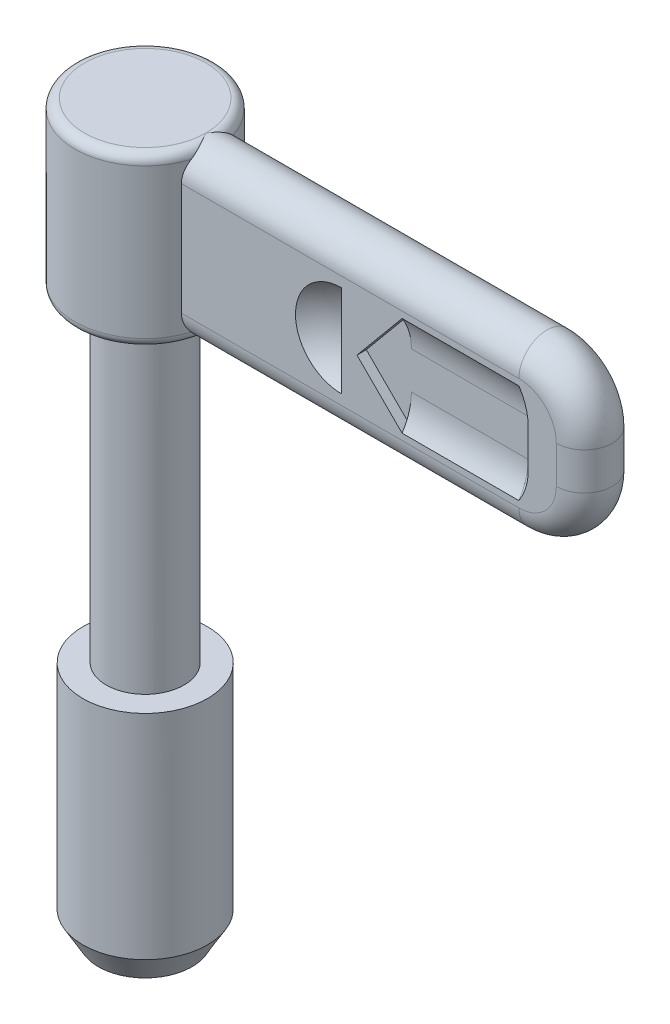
ISO-10303-21;
HEADER;
FILE_DESCRIPTION(('STEP AP214'),'2;1');
FILE_NAME('part.step','',(''),(''),'','','');
FILE_SCHEMA(('AUTOMOTIVE_DESIGN { 1 0 10303 214 1 1 1 1 }'));
ENDSEC;
DATA;
#1=APPLICATION_CONTEXT('core data for automotive mechanical design processes');
#2=APPLICATION_PROTOCOL_DEFINITION('international standard','automotive_design',2000,#1);
#3=PRODUCT_CONTEXT('',#1,'mechanical');
#4=PRODUCT('Part','Part','',(#3));
#5=PRODUCT_RELATED_PRODUCT_CATEGORY('part','',(#4));
#6=PRODUCT_DEFINITION_FORMATION('','',#4);
#7=PRODUCT_DEFINITION_CONTEXT('part definition',#1,'design');
#8=PRODUCT_DEFINITION('design','',#6,#7);
#9=PRODUCT_DEFINITION_SHAPE('','',#8);
#10=(LENGTH_UNIT() NAMED_UNIT(*) SI_UNIT(.MILLI.,.METRE.));
#11=(NAMED_UNIT(*) PLANE_ANGLE_UNIT() SI_UNIT($,.RADIAN.));
#12=(NAMED_UNIT(*) SI_UNIT($,.STERADIAN.) SOLID_ANGLE_UNIT());
#13=UNCERTAINTY_MEASURE_WITH_UNIT(LENGTH_MEASURE(1.E-05),#10,'distance_accuracy_value','');
#14=(GEOMETRIC_REPRESENTATION_CONTEXT(3) GLOBAL_UNCERTAINTY_ASSIGNED_CONTEXT((#13)) GLOBAL_UNIT_ASSIGNED_CONTEXT((#10,
#11,#12)) REPRESENTATION_CONTEXT('',''));
#15=CARTESIAN_POINT('',(0.,0.,0.));
#16=DIRECTION('',(0.,0.,1.));
#17=DIRECTION('',(1.,0.,0.));
#18=AXIS2_PLACEMENT_3D('',#15,#16,#17);
#19=CARTESIAN_POINT('',(18.3,35.2,-1.8));
#20=DIRECTION('',(-1.,0.,0.));
#21=DIRECTION('',(0.,0.,1.));
#22=AXIS2_PLACEMENT_3D('',#19,#20,#21);
#23=PLANE('',#22);
#24=CARTESIAN_POINT('',(18.3,35.1999999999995,-4.80000000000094));
#25=DIRECTION('',(1.,0.,0.));
#26=DIRECTION('',(0.,0.552770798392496,0.83333333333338));
#27=AXIS2_PLACEMENT_3D('',#24,#25,#26);
#28=CIRCLE('',#27,3.60000000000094);
#29=CARTESIAN_POINT('',(18.3,37.189974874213,-1.8));
#30=VERTEX_POINT('',#29);
#31=CARTESIAN_POINT('',(18.3,35.2,-1.2));
#32=VERTEX_POINT('',#31);
#33=EDGE_CURVE('E190',#30,#32,#28,.T.);
#34=ORIENTED_EDGE('',*,*,#33,.T.);
#35=DIRECTION('',(0.,1.,0.));
#36=VECTOR('',#35,1.);
#37=CARTESIAN_POINT('',(18.3,35.2,-1.2));
#38=LINE('',#37,#36);
#39=CARTESIAN_POINT('',(18.3,37.189974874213,-1.2));
#40=VERTEX_POINT('',#39);
#41=EDGE_CURVE('E200',#32,#40,#38,.T.);
#42=ORIENTED_EDGE('',*,*,#41,.T.);
#43=DIRECTION('',(0.,0.,-1.));
#44=VECTOR('',#43,1.);
#45=CARTESIAN_POINT('',(18.3,37.189974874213,-1.2));
#46=LINE('',#45,#44);
#47=EDGE_CURVE('E202',#40,#30,#46,.T.);
#48=ORIENTED_EDGE('',*,*,#47,.T.);
#49=EDGE_LOOP('',(#34,#42,#48));
#50=FACE_BOUND('',#49,.T.);
#51=ADVANCED_FACE('F16',(#50),#23,.T.);
#52=CARTESIAN_POINT('',(4.12431812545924,30.4,-1.8));
#53=DIRECTION('',(0.,0.,-1.));
#54=DIRECTION('',(0.,1.,0.));
#55=AXIS2_PLACEMENT_3D('',#52,#53,#54);
#56=PLANE('',#55);
#57=DIRECTION('',(2.13656270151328E-13,1.,0.));
#58=VECTOR('',#57,1.);
#59=CARTESIAN_POINT('',(4.12431812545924,30.4,-1.8));
#60=LINE('',#59,#58);
#61=CARTESIAN_POINT('',(4.12431812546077,37.5999994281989,-1.8));
#62=VERTEX_POINT('',#61);
#63=CARTESIAN_POINT('',(4.12431812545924,30.4,-1.8));
#64=VERTEX_POINT('',#63);
#65=EDGE_CURVE('E208',#62,#64,#60,.F.);
#66=ORIENTED_EDGE('',*,*,#65,.F.);
#67=DIRECTION('',(1.,2.63798431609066E-08,0.));
#68=VECTOR('',#67,1.);
#69=CARTESIAN_POINT('',(4.12431812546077,37.5999994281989,-1.8));
#70=LINE('',#69,#68);
#71=CARTESIAN_POINT('',(25.8,37.6,-1.8));
#72=VERTEX_POINT('',#71);
#73=EDGE_CURVE('E218',#62,#72,#70,.T.);
#74=ORIENTED_EDGE('',*,*,#73,.T.);
#75=CARTESIAN_POINT('',(25.8,35.2,-1.8));
#76=DIRECTION('',(0.,0.,-1.));
#77=DIRECTION('',(0.,1.,0.));
#78=AXIS2_PLACEMENT_3D('',#75,#76,#77);
#79=CIRCLE('',#78,2.4);
#80=CARTESIAN_POINT('',(28.2,35.2,-1.8));
#81=VERTEX_POINT('',#80);
#82=EDGE_CURVE('E223',#72,#81,#79,.T.);
#83=ORIENTED_EDGE('',*,*,#82,.T.);
#84=DIRECTION('',(0.,-1.,0.));
#85=VECTOR('',#84,1.);
#86=CARTESIAN_POINT('',(28.2,35.2,-1.8));
#87=LINE('',#86,#85);
#88=CARTESIAN_POINT('',(28.2,32.8,-1.8));
#89=VERTEX_POINT('',#88);
#90=EDGE_CURVE('E228',#81,#89,#87,.T.);
#91=ORIENTED_EDGE('',*,*,#90,.T.);
#92=CARTESIAN_POINT('',(25.8,32.8,-1.8));
#93=DIRECTION('',(0.,0.,-1.));
#94=DIRECTION('',(1.,0.,0.));
#95=AXIS2_PLACEMENT_3D('',#92,#93,#94);
#96=CIRCLE('',#95,2.4);
#97=CARTESIAN_POINT('',(25.8,30.4,-1.8));
#98=VERTEX_POINT('',#97);
#99=EDGE_CURVE('E233',#89,#98,#96,.T.);
#100=ORIENTED_EDGE('',*,*,#99,.T.);
#101=DIRECTION('',(-1.,0.,0.));
#102=VECTOR('',#101,1.);
#103=CARTESIAN_POINT('',(25.8,30.4,-1.8));
#104=LINE('',#103,#102);
#105=EDGE_CURVE('E238',#98,#64,#104,.T.);
#106=ORIENTED_EDGE('',*,*,#105,.T.);
#107=EDGE_LOOP('',(#66,#74,#83,#91,#100,#106));
#108=FACE_BOUND('',#107,.T.);
#109=CARTESIAN_POINT('',(25.8,37.189974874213,-1.8));
#110=CARTESIAN_POINT('',(25.8240665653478,37.1532162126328,-1.8));
#111=CARTESIAN_POINT('',(25.8475256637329,37.116058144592,-1.8));
#112=CARTESIAN_POINT('',(25.8931753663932,37.0409586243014,-1.8));
#113=CARTESIAN_POINT('',(25.9153656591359,37.0030169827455,-1.8));
#114=CARTESIAN_POINT('',(25.9584109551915,36.9263862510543,-1.8));
#115=CARTESIAN_POINT('',(25.9792660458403,36.8876972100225,-1.8));
#116=CARTESIAN_POINT('',(26.0195823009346,36.8096116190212,-1.8));
#117=CARTESIAN_POINT('',(26.0390438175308,36.77021525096,-1.8));
#118=CARTESIAN_POINT('',(26.0765218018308,36.6907569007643,-1.8));
#119=CARTESIAN_POINT('',(26.0945387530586,36.6506951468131,-1.8));
#120=CARTESIAN_POINT('',(26.1290843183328,36.5699504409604,-1.8));
#121=CARTESIAN_POINT('',(26.1456134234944,36.5292676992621,-1.8));
#122=CARTESIAN_POINT('',(26.1771478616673,36.4473278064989,-1.8));
#123=CARTESIAN_POINT('',(26.1921535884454,36.4060708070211,-1.8));
#124=CARTESIAN_POINT('',(26.220613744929,36.3230315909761,-1.8));
#125=CARTESIAN_POINT('',(26.2340683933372,36.2812494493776,-1.8));
#126=CARTESIAN_POINT('',(26.2594067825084,36.1972115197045,-1.8));
#127=CARTESIAN_POINT('',(26.2712905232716,36.1549557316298,-1.8));
#128=CARTESIAN_POINT('',(26.293475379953,36.0700244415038,-1.8));
#129=CARTESIAN_POINT('',(26.3037762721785,36.027348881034,-1.8));
#130=CARTESIAN_POINT('',(26.322791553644,35.941634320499,-1.8));
#131=CARTESIAN_POINT('',(26.3315055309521,35.8985952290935,-1.8));
#132=CARTESIAN_POINT('',(26.3473508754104,35.8122121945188,-1.8));
#133=CARTESIAN_POINT('',(26.3544817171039,35.7688681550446,-1.8));
#134=CARTESIAN_POINT('',(26.3671723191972,35.6819361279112,-1.8));
#135=CARTESIAN_POINT('',(26.3727315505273,35.6383480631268,-1.8));
#136=CARTESIAN_POINT('',(26.3822981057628,35.5509910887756,-1.8));
#137=CARTESIAN_POINT('',(26.3863050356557,35.5072221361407,-1.8));
#138=CARTESIAN_POINT('',(26.3927931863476,35.419569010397,-1.8));
#139=CARTESIAN_POINT('',(26.395274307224,35.3756848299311,-1.8));
#140=CARTESIAN_POINT('',(26.3987457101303,35.2878680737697,-1.8));
#141=CARTESIAN_POINT('',(26.3997363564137,35.2439355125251,-1.8));
#142=CARTESIAN_POINT('',(26.4,35.1999999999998,-1.8));
#143=B_SPLINE_CURVE_WITH_KNOTS('',3,(#109,#110,#111,#112,#113,#114,#115,#116,#117,#118,#119,
#120,#121,#122,#123,#124,#125,#126,#127,#128,#129,#130,#131,#132,#133,#134,#135,#136,#137,#138,
#139,#140,#141,#142),.UNSPECIFIED.,.F.,.F.,(4,2,2,2,2,2,2,2,2,2,2,2,2,2,2,2,4),(0.,
0.131804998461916,0.263642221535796,0.395470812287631,0.527265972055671,0.659016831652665,
0.790724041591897,0.922397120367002,1.05405161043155,1.1857061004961,1.31737917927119,
1.44908638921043,1.58083724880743,1.71263240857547,1.84446099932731,1.97629822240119,
2.1081032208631),.UNSPECIFIED.);
#144=CARTESIAN_POINT('',(25.8,37.189974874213,-1.8));
#145=VERTEX_POINT('',#144);
#146=CARTESIAN_POINT('',(26.4,35.2,-1.8));
#147=VERTEX_POINT('',#146);
#148=EDGE_CURVE('E243',#145,#147,#143,.T.);
#149=ORIENTED_EDGE('',*,*,#148,.F.);
#150=DIRECTION('',(-1.,0.,0.));
#151=VECTOR('',#150,1.);
#152=CARTESIAN_POINT('',(25.8,37.189974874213,-1.8));
#153=LINE('',#152,#151);
#154=EDGE_CURVE('E254',#30,#145,#153,.F.);
#155=ORIENTED_EDGE('',*,*,#154,.F.);
#156=DIRECTION('',(-0.639102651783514,-0.769121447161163,0.));
#157=VECTOR('',#156,1.);
#158=CARTESIAN_POINT('',(18.3,37.189974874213,-1.8));
#159=LINE('',#158,#157);
#160=CARTESIAN_POINT('',(15.4,33.7,-1.8));
#161=VERTEX_POINT('',#160);
#162=EDGE_CURVE('E1358',#30,#161,#159,.T.);
#163=ORIENTED_EDGE('',*,*,#162,.T.);
#164=DIRECTION('',(0.708330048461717,-0.705881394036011,0.));
#165=VECTOR('',#164,1.);
#166=CARTESIAN_POINT('',(15.4,33.7,-1.8));
#167=LINE('',#166,#165);
#168=CARTESIAN_POINT('',(18.3,30.810025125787,-1.8));
#169=VERTEX_POINT('',#168);
#170=EDGE_CURVE('E1336',#161,#169,#167,.T.);
#171=ORIENTED_EDGE('',*,*,#170,.T.);
#172=DIRECTION('',(1.,0.,0.));
#173=VECTOR('',#172,1.);
#174=CARTESIAN_POINT('',(18.3,30.810025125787,-1.8));
#175=LINE('',#174,#173);
#176=CARTESIAN_POINT('',(25.8,30.810025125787,-1.8));
#177=VERTEX_POINT('',#176);
#178=EDGE_CURVE('E1329',#169,#177,#175,.T.);
#179=ORIENTED_EDGE('',*,*,#178,.T.);
#180=CARTESIAN_POINT('',(26.4,32.8,-1.8));
#181=CARTESIAN_POINT('',(26.3997363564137,32.7560644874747,-1.8));
#182=CARTESIAN_POINT('',(26.3987457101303,32.7121319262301,-1.8));
#183=CARTESIAN_POINT('',(26.3952743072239,32.6243151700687,-1.8));
#184=CARTESIAN_POINT('',(26.3927931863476,32.5804309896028,-1.8));
#185=CARTESIAN_POINT('',(26.3863050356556,32.4927778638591,-1.8));
#186=CARTESIAN_POINT('',(26.3822981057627,32.4490089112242,-1.8));
#187=CARTESIAN_POINT('',(26.3727315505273,32.3616519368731,-1.8));
#188=CARTESIAN_POINT('',(26.3671723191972,32.3180638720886,-1.8));
#189=CARTESIAN_POINT('',(26.3544817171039,32.2311318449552,-1.8));
#190=CARTESIAN_POINT('',(26.3473508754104,32.1877878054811,-1.8));
#191=CARTESIAN_POINT('',(26.331505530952,32.1014047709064,-1.8));
#192=CARTESIAN_POINT('',(26.3227915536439,32.0583656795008,-1.8));
#193=CARTESIAN_POINT('',(26.3037762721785,31.9726511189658,-1.8));
#194=CARTESIAN_POINT('',(26.2934753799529,31.9299755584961,-1.8));
#195=CARTESIAN_POINT('',(26.2712905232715,31.84504426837,-1.8));
#196=CARTESIAN_POINT('',(26.2594067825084,31.8027884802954,-1.8));
#197=CARTESIAN_POINT('',(26.2340683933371,31.7187505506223,-1.8));
#198=CARTESIAN_POINT('',(26.220613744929,31.6769684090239,-1.8));
#199=CARTESIAN_POINT('',(26.1921535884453,31.5939291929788,-1.8));
#200=CARTESIAN_POINT('',(26.1771478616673,31.552672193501,-1.8));
#201=CARTESIAN_POINT('',(26.1456134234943,31.4707323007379,-1.8));
#202=CARTESIAN_POINT('',(26.1290843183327,31.4300495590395,-1.8));
#203=CARTESIAN_POINT('',(26.0945387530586,31.3493048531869,-1.8));
#204=CARTESIAN_POINT('',(26.0765218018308,31.3092430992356,-1.8));
#205=CARTESIAN_POINT('',(26.0390438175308,31.2297847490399,-1.8));
#206=CARTESIAN_POINT('',(26.0195823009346,31.1903883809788,-1.8));
#207=CARTESIAN_POINT('',(25.9792660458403,31.1123027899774,-1.8));
#208=CARTESIAN_POINT('',(25.9584109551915,31.0736137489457,-1.8));
#209=CARTESIAN_POINT('',(25.9153656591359,30.9969830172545,-1.8));
#210=CARTESIAN_POINT('',(25.8931753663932,30.9590413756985,-1.8));
#211=CARTESIAN_POINT('',(25.8475256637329,30.883941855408,-1.8));
#212=CARTESIAN_POINT('',(25.8240665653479,30.8467837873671,-1.8));
#213=CARTESIAN_POINT('',(25.8,30.810025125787,-1.8));
#214=B_SPLINE_CURVE_WITH_KNOTS('',3,(#180,#181,#182,#183,#184,#185,#186,#187,#188,#189,#190,
#191,#192,#193,#194,#195,#196,#197,#198,#199,#200,#201,#202,#203,#204,#205,#206,#207,#208,#209,
#210,#211,#212,#213),.UNSPECIFIED.,.F.,.F.,(4,2,2,2,2,2,2,2,2,2,2,2,2,2,2,2,4),(0.,
0.131804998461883,0.26364222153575,0.395470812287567,0.527265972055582,0.659016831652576,
0.79072404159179,0.922397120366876,1.05405161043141,1.18570610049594,1.31737917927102,
1.44908638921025,1.58083724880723,1.71263240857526,1.84446099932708,1.97629822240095,
2.10810322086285),.UNSPECIFIED.);
#215=CARTESIAN_POINT('',(26.4,32.8,-1.8));
#216=VERTEX_POINT('',#215);
#217=EDGE_CURVE('E1333',#216,#177,#214,.T.);
#218=ORIENTED_EDGE('',*,*,#217,.F.);
#219=DIRECTION('',(0.,1.,0.));
#220=VECTOR('',#219,1.);
#221=CARTESIAN_POINT('',(26.4,32.8,-1.8));
#222=LINE('',#221,#220);
#223=EDGE_CURVE('E1338',#216,#147,#222,.T.);
#224=ORIENTED_EDGE('',*,*,#223,.T.);
#225=EDGE_LOOP('',(#149,#155,#163,#171,#179,#218,#224));
#226=FACE_BOUND('',#225,.T.);
#227=DIRECTION('',(0.,1.,0.));
#228=VECTOR('',#227,1.);
#229=CARTESIAN_POINT('',(14.4,31.0521194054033,-1.8));
#230=LINE('',#229,#228);
#231=CARTESIAN_POINT('',(14.4,31.0521194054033,-1.8));
#232=VERTEX_POINT('',#231);
#233=CARTESIAN_POINT('',(14.4,36.9478805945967,-1.8));
#234=VERTEX_POINT('',#233);
#235=EDGE_CURVE('E1339',#232,#234,#230,.T.);
#236=ORIENTED_EDGE('',*,*,#235,.T.);
#237=CARTESIAN_POINT('',(14.4,36.9478805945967,-1.8));
#238=CARTESIAN_POINT('',(14.2398904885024,36.9478805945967,-1.8));
#239=CARTESIAN_POINT('',(14.0846401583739,36.9355003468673,-1.8));
#240=CARTESIAN_POINT('',(13.7820381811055,36.8872170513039,-1.8));
#241=CARTESIAN_POINT('',(13.6346865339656,36.8513140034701,-1.8));
#242=CARTESIAN_POINT('',(13.1585202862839,36.6960843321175,-1.8));
#243=CARTESIAN_POINT('',(12.879750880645,36.5446981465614,-1.8));
#244=CARTESIAN_POINT('',(12.3261882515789,36.1307866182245,-1.8));
#245=CARTESIAN_POINT('',(12.0616323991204,35.836506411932,-1.8));
#246=CARTESIAN_POINT('',(11.17567755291,34.3452001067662,-1.8));
#247=CARTESIAN_POINT('',(11.3625860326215,32.8684812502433,-1.8));
#248=CARTESIAN_POINT('',(12.5316546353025,31.6994126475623,-1.8));
#249=CARTESIAN_POINT('',(12.7765109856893,31.5175928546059,-1.8));
#250=CARTESIAN_POINT('',(13.2599373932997,31.272763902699,-1.8));
#251=CARTESIAN_POINT('',(13.4705186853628,31.1928165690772,-1.8));
#252=CARTESIAN_POINT('',(13.9228638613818,31.0806441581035,-1.8));
#253=CARTESIAN_POINT('',(14.1585949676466,31.0521194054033,-1.8));
#254=CARTESIAN_POINT('',(14.4,31.0521194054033,-1.8));
#255=B_SPLINE_CURVE_WITH_KNOTS('',3,(#237,#238,#239,#240,#241,#242,#243,#244,#245,#246,#247,
#248,#249,#250,#251,#252,#253,#254),.UNSPECIFIED.,.F.,.F.,(4,2,2,2,2,2,2,2,4),(0.,
0.0429619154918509,0.0859238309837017,0.184717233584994,0.310914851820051,0.758114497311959,
0.859535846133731,0.928561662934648,1.),.UNSPECIFIED.);
#256=EDGE_CURVE('E289',#234,#232,#255,.T.);
#257=ORIENTED_EDGE('',*,*,#256,.T.);
#258=EDGE_LOOP('',(#236,#257));
#259=FACE_BOUND('',#258,.T.);
#260=ADVANCED_FACE('F256',(#108,#226,#259),#56,.T.);
#261=CARTESIAN_POINT('',(4.12431812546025,30.4,1.8));
#262=DIRECTION('',(0.,0.,1.));
#263=DIRECTION('',(1.,0.,0.));
#264=AXIS2_PLACEMENT_3D('',#261,#262,#263);
#265=PLANE('',#264);
#266=DIRECTION('',(-1.,-1.82876188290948E-08,0.));
#267=VECTOR('',#266,1.);
#268=CARTESIAN_POINT('',(25.8,37.6,1.8));
#269=LINE('',#268,#267);
#270=CARTESIAN_POINT('',(25.8,37.6,1.8));
#271=VERTEX_POINT('',#270);
#272=CARTESIAN_POINT('',(4.12431812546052,37.5999996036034,1.8));
#273=VERTEX_POINT('',#272);
#274=EDGE_CURVE('E280',#271,#273,#269,.T.);
#275=ORIENTED_EDGE('',*,*,#274,.T.);
#276=DIRECTION('',(0.,-1.,0.));
#277=VECTOR('',#276,1.);
#278=CARTESIAN_POINT('',(4.12431812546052,37.5999996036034,1.8));
#279=LINE('',#278,#277);
#280=CARTESIAN_POINT('',(4.12431812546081,30.4000005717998,1.8));
#281=VERTEX_POINT('',#280);
#282=EDGE_CURVE('E288',#273,#281,#279,.T.);
#283=ORIENTED_EDGE('',*,*,#282,.T.);
#284=DIRECTION('',(1.,-2.63797818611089E-08,0.));
#285=VECTOR('',#284,1.);
#286=CARTESIAN_POINT('',(4.12431812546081,30.4000005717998,1.8));
#287=LINE('',#286,#285);
#288=CARTESIAN_POINT('',(25.8,30.4,1.8));
#289=VERTEX_POINT('',#288);
#290=EDGE_CURVE('E294',#281,#289,#287,.T.);
#291=ORIENTED_EDGE('',*,*,#290,.T.);
#292=CARTESIAN_POINT('',(25.8,32.8,1.8));
#293=DIRECTION('',(0.,0.,1.));
#294=DIRECTION('',(0.,-1.,0.));
#295=AXIS2_PLACEMENT_3D('',#292,#293,#294);
#296=CIRCLE('',#295,2.4);
#297=CARTESIAN_POINT('',(28.2,32.8,1.8));
#298=VERTEX_POINT('',#297);
#299=EDGE_CURVE('E299',#289,#298,#296,.T.);
#300=ORIENTED_EDGE('',*,*,#299,.T.);
#301=DIRECTION('',(0.,1.,0.));
#302=VECTOR('',#301,1.);
#303=CARTESIAN_POINT('',(28.2,32.8,1.8));
#304=LINE('',#303,#302);
#305=CARTESIAN_POINT('',(28.2,35.2,1.8));
#306=VERTEX_POINT('',#305);
#307=EDGE_CURVE('E304',#298,#306,#304,.T.);
#308=ORIENTED_EDGE('',*,*,#307,.T.);
#309=CARTESIAN_POINT('',(25.8,35.2,1.8));
#310=DIRECTION('',(0.,0.,1.));
#311=DIRECTION('',(1.,0.,0.));
#312=AXIS2_PLACEMENT_3D('',#309,#310,#311);
#313=CIRCLE('',#312,2.4);
#314=EDGE_CURVE('E309',#306,#271,#313,.T.);
#315=ORIENTED_EDGE('',*,*,#314,.T.);
#316=EDGE_LOOP('',(#275,#283,#291,#300,#308,#315));
#317=FACE_BOUND('',#316,.T.);
#318=DIRECTION('',(0.639102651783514,0.769121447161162,0.));
#319=VECTOR('',#318,1.);
#320=CARTESIAN_POINT('',(15.4,33.7,1.8));
#321=LINE('',#320,#319);
#322=CARTESIAN_POINT('',(18.3,37.189974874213,1.8));
#323=VERTEX_POINT('',#322);
#324=CARTESIAN_POINT('',(15.4,33.7,1.8));
#325=VERTEX_POINT('',#324);
#326=EDGE_CURVE('E314',#323,#325,#321,.F.);
#327=ORIENTED_EDGE('',*,*,#326,.F.);
#328=DIRECTION('',(1.,0.,0.));
#329=VECTOR('',#328,1.);
#330=CARTESIAN_POINT('',(18.3,37.189974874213,1.8));
#331=LINE('',#330,#329);
#332=CARTESIAN_POINT('',(25.8,37.189974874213,1.8));
#333=VERTEX_POINT('',#332);
#334=EDGE_CURVE('E319',#323,#333,#331,.T.);
#335=ORIENTED_EDGE('',*,*,#334,.T.);
#336=CARTESIAN_POINT('',(26.4,35.1999999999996,1.8));
#337=CARTESIAN_POINT('',(26.3997363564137,35.243935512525,1.8));
#338=CARTESIAN_POINT('',(26.3987457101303,35.2878680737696,1.8));
#339=CARTESIAN_POINT('',(26.395274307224,35.375684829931,1.8));
#340=CARTESIAN_POINT('',(26.3927931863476,35.4195690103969,1.8));
#341=CARTESIAN_POINT('',(26.3863050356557,35.5072221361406,1.8));
#342=CARTESIAN_POINT('',(26.3822981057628,35.5509910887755,1.8));
#343=CARTESIAN_POINT('',(26.3727315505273,35.6383480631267,1.8));
#344=CARTESIAN_POINT('',(26.3671723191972,35.6819361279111,1.8));
#345=CARTESIAN_POINT('',(26.3544817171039,35.7688681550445,1.8));
#346=CARTESIAN_POINT('',(26.3473508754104,35.8122121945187,1.8));
#347=CARTESIAN_POINT('',(26.3315055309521,35.8985952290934,1.8));
#348=CARTESIAN_POINT('',(26.322791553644,35.941634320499,1.8));
#349=CARTESIAN_POINT('',(26.3037762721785,36.027348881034,1.8));
#350=CARTESIAN_POINT('',(26.293475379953,36.0700244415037,1.8));
#351=CARTESIAN_POINT('',(26.2712905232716,36.1549557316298,1.8));
#352=CARTESIAN_POINT('',(26.2594067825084,36.1972115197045,1.8));
#353=CARTESIAN_POINT('',(26.2340683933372,36.2812494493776,1.8));
#354=CARTESIAN_POINT('',(26.220613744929,36.323031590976,1.8));
#355=CARTESIAN_POINT('',(26.1921535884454,36.4060708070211,1.8));
#356=CARTESIAN_POINT('',(26.1771478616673,36.4473278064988,1.8));
#357=CARTESIAN_POINT('',(26.1456134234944,36.529267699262,1.8));
#358=CARTESIAN_POINT('',(26.1290843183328,36.5699504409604,1.8));
#359=CARTESIAN_POINT('',(26.0945387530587,36.650695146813,1.8));
#360=CARTESIAN_POINT('',(26.0765218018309,36.6907569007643,1.8));
#361=CARTESIAN_POINT('',(26.0390438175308,36.77021525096,1.8));
#362=CARTESIAN_POINT('',(26.0195823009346,36.8096116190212,1.8));
#363=CARTESIAN_POINT('',(25.9792660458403,36.8876972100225,1.8));
#364=CARTESIAN_POINT('',(25.9584109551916,36.9263862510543,1.8));
#365=CARTESIAN_POINT('',(25.9153656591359,37.0030169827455,1.8));
#366=CARTESIAN_POINT('',(25.8931753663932,37.0409586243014,1.8));
#367=CARTESIAN_POINT('',(25.8475256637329,37.116058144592,1.8));
#368=CARTESIAN_POINT('',(25.8240665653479,37.1532162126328,1.8));
#369=CARTESIAN_POINT('',(25.8,37.189974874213,1.8));
#370=B_SPLINE_CURVE_WITH_KNOTS('',3,(#336,#337,#338,#339,#340,#341,#342,#343,#344,#345,#346,
#347,#348,#349,#350,#351,#352,#353,#354,#355,#356,#357,#358,#359,#360,#361,#362,#363,#364,#365,
#366,#367,#368,#369),.UNSPECIFIED.,.F.,.F.,(4,2,2,2,2,2,2,2,2,2,2,2,2,2,2,2,4),(0.,
0.131804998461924,0.263642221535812,0.395470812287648,0.527265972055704,0.659016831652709,
0.790724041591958,0.922397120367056,1.05405161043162,1.18570610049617,1.31737917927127,
1.44908638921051,1.58083724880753,1.71263240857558,1.84446099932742,1.9762982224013,
2.10810322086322),.UNSPECIFIED.);
#371=CARTESIAN_POINT('',(26.4,35.2,1.8));
#372=VERTEX_POINT('',#371);
#373=EDGE_CURVE('E324',#372,#333,#370,.T.);
#374=ORIENTED_EDGE('',*,*,#373,.F.);
#375=DIRECTION('',(0.,-1.,0.));
#376=VECTOR('',#375,1.);
#377=CARTESIAN_POINT('',(26.4,35.2,1.8));
#378=LINE('',#377,#376);
#379=CARTESIAN_POINT('',(26.4,32.8,1.8));
#380=VERTEX_POINT('',#379);
#381=EDGE_CURVE('E334',#372,#380,#378,.T.);
#382=ORIENTED_EDGE('',*,*,#381,.T.);
#383=CARTESIAN_POINT('',(25.8,30.810025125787,1.8));
#384=CARTESIAN_POINT('',(25.8240665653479,30.8467837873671,1.8));
#385=CARTESIAN_POINT('',(25.8475256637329,30.883941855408,1.8));
#386=CARTESIAN_POINT('',(25.8931753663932,30.9590413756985,1.8));
#387=CARTESIAN_POINT('',(25.9153656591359,30.9969830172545,1.8));
#388=CARTESIAN_POINT('',(25.9584109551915,31.0736137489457,1.8));
#389=CARTESIAN_POINT('',(25.9792660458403,31.1123027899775,1.8));
#390=CARTESIAN_POINT('',(26.0195823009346,31.1903883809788,1.8));
#391=CARTESIAN_POINT('',(26.0390438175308,31.2297847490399,1.8));
#392=CARTESIAN_POINT('',(26.0765218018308,31.3092430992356,1.8));
#393=CARTESIAN_POINT('',(26.0945387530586,31.3493048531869,1.8));
#394=CARTESIAN_POINT('',(26.1290843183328,31.4300495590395,1.8));
#395=CARTESIAN_POINT('',(26.1456134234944,31.4707323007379,1.8));
#396=CARTESIAN_POINT('',(26.1771478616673,31.5526721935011,1.8));
#397=CARTESIAN_POINT('',(26.1921535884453,31.5939291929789,1.8));
#398=CARTESIAN_POINT('',(26.220613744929,31.6769684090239,1.8));
#399=CARTESIAN_POINT('',(26.2340683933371,31.7187505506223,1.8));
#400=CARTESIAN_POINT('',(26.2594067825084,31.8027884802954,1.8));
#401=CARTESIAN_POINT('',(26.2712905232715,31.8450442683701,1.8));
#402=CARTESIAN_POINT('',(26.2934753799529,31.9299755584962,1.8));
#403=CARTESIAN_POINT('',(26.3037762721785,31.9726511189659,1.8));
#404=CARTESIAN_POINT('',(26.322791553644,32.0583656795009,1.8));
#405=CARTESIAN_POINT('',(26.331505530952,32.1014047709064,1.8));
#406=CARTESIAN_POINT('',(26.3473508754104,32.1877878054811,1.8));
#407=CARTESIAN_POINT('',(26.3544817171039,32.2311318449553,1.8));
#408=CARTESIAN_POINT('',(26.3671723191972,32.3180638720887,1.8));
#409=CARTESIAN_POINT('',(26.3727315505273,32.3616519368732,1.8));
#410=CARTESIAN_POINT('',(26.3822981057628,32.4490089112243,1.8));
#411=CARTESIAN_POINT('',(26.3863050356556,32.4927778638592,1.8));
#412=CARTESIAN_POINT('',(26.3927931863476,32.5804309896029,1.8));
#413=CARTESIAN_POINT('',(26.395274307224,32.6243151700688,1.8));
#414=CARTESIAN_POINT('',(26.3987457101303,32.7121319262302,1.8));
#415=CARTESIAN_POINT('',(26.3997363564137,32.7560644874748,1.8));
#416=CARTESIAN_POINT('',(26.4,32.8000000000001,1.8));
#417=B_SPLINE_CURVE_WITH_KNOTS('',3,(#383,#384,#385,#386,#387,#388,#389,#390,#391,#392,#393,
#394,#395,#396,#397,#398,#399,#400,#401,#402,#403,#404,#405,#406,#407,#408,#409,#410,#411,#412,
#413,#414,#415,#416),.UNSPECIFIED.,.F.,.F.,(4,2,2,2,2,2,2,2,2,2,2,2,2,2,2,2,4),(0.,
0.131804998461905,0.263642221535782,0.395470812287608,0.527265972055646,0.659016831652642,
0.790724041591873,0.922397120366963,1.0540516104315,1.18570610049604,1.31737917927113,
1.44908638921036,1.58083724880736,1.71263240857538,1.84446099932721,1.97629822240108,
2.10810322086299),.UNSPECIFIED.);
#418=CARTESIAN_POINT('',(25.8,30.810025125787,1.8));
#419=VERTEX_POINT('',#418);
#420=EDGE_CURVE('E341',#419,#380,#417,.T.);
#421=ORIENTED_EDGE('',*,*,#420,.F.);
#422=DIRECTION('',(-1.,0.,0.));
#423=VECTOR('',#422,1.);
#424=CARTESIAN_POINT('',(25.8,30.810025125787,1.8));
#425=LINE('',#424,#423);
#426=CARTESIAN_POINT('',(18.3,30.810025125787,1.8));
#427=VERTEX_POINT('',#426);
#428=EDGE_CURVE('E351',#427,#419,#425,.F.);
#429=ORIENTED_EDGE('',*,*,#428,.F.);
#430=DIRECTION('',(-0.708330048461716,0.705881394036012,0.));
#431=VECTOR('',#430,1.);
#432=CARTESIAN_POINT('',(18.3,30.810025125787,1.8));
#433=LINE('',#432,#431);
#434=EDGE_CURVE('E358',#325,#427,#433,.F.);
#435=ORIENTED_EDGE('',*,*,#434,.F.);
#436=EDGE_LOOP('',(#327,#335,#374,#382,#421,#429,#435));
#437=FACE_BOUND('',#436,.T.);
#438=CARTESIAN_POINT('',(14.4,36.9478805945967,1.8));
#439=CARTESIAN_POINT('',(14.351193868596,36.9478835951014,1.80000166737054));
#440=CARTESIAN_POINT('',(14.3023873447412,36.9466764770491,1.80000687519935));
#441=CARTESIAN_POINT('',(14.2052390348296,36.9418585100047,1.80001713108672));
#442=CARTESIAN_POINT('',(14.1568964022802,36.9382647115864,1.80002218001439));
#443=CARTESIAN_POINT('',(14.0606501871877,36.9287098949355,1.80002509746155));
#444=CARTESIAN_POINT('',(14.0127456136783,36.9227588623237,1.80002299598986));
#445=CARTESIAN_POINT('',(13.9173654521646,36.908518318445,1.80001379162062));
#446=CARTESIAN_POINT('',(13.8698892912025,36.9002326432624,1.80000669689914));
#447=CARTESIAN_POINT('',(13.7753745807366,36.8813393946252,1.7999926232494));
#448=CARTESIAN_POINT('',(13.7283362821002,36.8707305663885,1.79998564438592));
#449=CARTESIAN_POINT('',(13.6347277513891,36.8471974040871,1.79997650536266));
#450=CARTESIAN_POINT('',(13.5881588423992,36.8342678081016,1.79997435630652));
#451=CARTESIAN_POINT('',(13.4955422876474,36.8060931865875,1.79997813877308));
#452=CARTESIAN_POINT('',(13.4494971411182,36.790839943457,1.79998409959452));
#453=CARTESIAN_POINT('',(13.3580100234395,36.7580027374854,1.79999257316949));
#454=CARTESIAN_POINT('',(13.3125717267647,36.740408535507,1.79999507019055));
#455=CARTESIAN_POINT('',(13.2227080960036,36.7030318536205,1.80000498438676));
#456=CARTESIAN_POINT('',(13.178280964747,36.6832536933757,1.80001239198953));
#457=CARTESIAN_POINT('',(13.0907340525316,36.6416646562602,1.80003469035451));
#458=CARTESIAN_POINT('',(13.04760776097,36.6198674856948,1.80004953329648));
#459=CARTESIAN_POINT('',(12.9626637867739,36.5742723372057,1.80007350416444));
#460=CARTESIAN_POINT('',(12.9208412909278,36.5504833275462,1.80008265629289));
#461=CARTESIAN_POINT('',(12.8385224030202,36.5009454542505,1.80009395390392));
#462=CARTESIAN_POINT('',(12.7980228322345,36.4752018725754,1.80009611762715));
#463=CARTESIAN_POINT('',(12.7183849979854,36.4217976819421,1.80009375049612));
#464=CARTESIAN_POINT('',(12.6792450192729,36.3941396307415,1.8000892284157));
#465=CARTESIAN_POINT('',(12.6023758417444,36.3369547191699,1.80007588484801));
#466=CARTESIAN_POINT('',(12.5646461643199,36.3074285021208,1.80006706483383));
#467=CARTESIAN_POINT('',(12.4906590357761,36.2465613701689,1.80004785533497));
#468=CARTESIAN_POINT('',(12.4544020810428,36.2152198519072,1.8000374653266));
#469=CARTESIAN_POINT('',(12.3834311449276,36.150783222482,1.80001756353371));
#470=CARTESIAN_POINT('',(12.3487183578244,36.1176867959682,1.80000805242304));
#471=CARTESIAN_POINT('',(12.2809132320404,36.0498091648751,1.79999159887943));
#472=CARTESIAN_POINT('',(12.2478225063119,36.015026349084,1.79998465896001));
#473=CARTESIAN_POINT('',(12.1833431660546,35.9438530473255,1.79997412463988));
#474=CARTESIAN_POINT('',(12.1519563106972,35.9074609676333,1.79997053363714));
#475=CARTESIAN_POINT('',(12.0909681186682,35.8331549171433,1.79996659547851));
#476=CARTESIAN_POINT('',(12.0613684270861,35.7952395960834,1.7999662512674));
#477=CARTESIAN_POINT('',(12.0040373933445,35.7179817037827,1.79996800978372));
#478=CARTESIAN_POINT('',(11.9763073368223,35.6786381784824,1.79997011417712));
#479=CARTESIAN_POINT('',(11.9227956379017,35.5986273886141,1.79997556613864));
#480=CARTESIAN_POINT('',(11.8970146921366,35.5579596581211,1.79997891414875));
#481=CARTESIAN_POINT('',(11.8474765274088,35.4754126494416,1.79998554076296));
#482=CARTESIAN_POINT('',(11.8237192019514,35.4335334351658,1.79998881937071));
#483=CARTESIAN_POINT('',(11.7782968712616,35.3486840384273,1.79999434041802));
#484=CARTESIAN_POINT('',(11.7566307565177,35.305714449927,1.79999658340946));
#485=CARTESIAN_POINT('',(11.7154515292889,35.218812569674,1.79999928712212));
#486=CARTESIAN_POINT('',(11.6959361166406,35.1748813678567,1.79999974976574));
#487=CARTESIAN_POINT('',(11.6589969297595,35.085925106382,1.80000025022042));
#488=CARTESIAN_POINT('',(11.6415825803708,35.0408961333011,1.80000028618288));
#489=CARTESIAN_POINT('',(11.6088193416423,34.9495960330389,1.80000689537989));
#490=CARTESIAN_POINT('',(11.5934922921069,34.9033170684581,1.80001353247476));
#491=CARTESIAN_POINT('',(11.5650210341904,34.8096599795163,1.80003515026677));
#492=CARTESIAN_POINT('',(11.5518966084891,34.7622758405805,1.80005020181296));
#493=CARTESIAN_POINT('',(11.5279365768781,34.666559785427,1.80008799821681));
#494=CARTESIAN_POINT('',(11.5171186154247,34.6182234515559,1.80011079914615));
#495=CARTESIAN_POINT('',(11.4978649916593,34.5207615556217,1.80016136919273));
#496=CARTESIAN_POINT('',(11.489444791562,34.4716329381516,1.80018916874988));
#497=CARTESIAN_POINT('',(11.4750661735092,34.3727511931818,1.80024590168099));
#498=CARTESIAN_POINT('',(11.4691210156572,34.3229961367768,1.80027484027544));
#499=CARTESIAN_POINT('',(11.4597568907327,34.2230312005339,1.80032963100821));
#500=CARTESIAN_POINT('',(11.4563489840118,34.1728202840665,1.80035546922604));
#501=CARTESIAN_POINT('',(11.4521078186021,34.0721170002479,1.80040012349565));
#502=CARTESIAN_POINT('',(11.4512834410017,34.0216242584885,1.80041891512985));
#503=CARTESIAN_POINT('',(11.4522412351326,33.9205330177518,1.80044636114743));
#504=CARTESIAN_POINT('',(11.4540301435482,33.8699345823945,1.80045498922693));
#505=CARTESIAN_POINT('',(11.4602295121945,33.7688085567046,1.80046021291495));
#506=CARTESIAN_POINT('',(11.4646446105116,33.7182812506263,1.80045678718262));
#507=CARTESIAN_POINT('',(11.4760943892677,33.617473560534,1.80043747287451));
#508=CARTESIAN_POINT('',(11.4831316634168,33.5671934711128,1.80042157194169));
#509=CARTESIAN_POINT('',(11.4998070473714,33.4670543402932,1.80037842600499));
#510=CARTESIAN_POINT('',(11.5094457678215,33.4171954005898,1.80035117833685));
#511=CARTESIAN_POINT('',(11.5312889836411,33.3180693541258,1.80028792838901));
#512=CARTESIAN_POINT('',(11.5434921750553,33.2688019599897,1.80025193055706));
#513=CARTESIAN_POINT('',(11.5704136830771,33.1710251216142,1.80017500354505));
#514=CARTESIAN_POINT('',(11.5851288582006,33.1225148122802,1.80013408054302));
#515=CARTESIAN_POINT('',(11.6170090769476,33.0264123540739,1.80005197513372));
#516=CARTESIAN_POINT('',(11.6341692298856,32.9788185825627,1.80001079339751));
#517=CARTESIAN_POINT('',(11.6708607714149,32.8847023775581,1.79993317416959));
#518=CARTESIAN_POINT('',(11.6903856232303,32.8381773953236,1.7998967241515));
#519=CARTESIAN_POINT('',(11.7317160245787,32.7463439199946,1.79983327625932));
#520=CARTESIAN_POINT('',(11.7535135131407,32.7010317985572,1.79980624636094));
#521=CARTESIAN_POINT('',(11.7992884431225,32.6117603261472,1.79976534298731));
#522=CARTESIAN_POINT('',(11.823256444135,32.5677961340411,1.79975141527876));
#523=CARTESIAN_POINT('',(11.873263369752,32.4813472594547,1.79973865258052));
#524=CARTESIAN_POINT('',(11.8992916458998,32.4388564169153,1.79973974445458));
#525=CARTESIAN_POINT('',(11.9533039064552,32.355470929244,1.79975644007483));
#526=CARTESIAN_POINT('',(11.9812762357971,32.3145687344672,1.79977196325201));
#527=CARTESIAN_POINT('',(12.0390575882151,32.2344669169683,1.79981360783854));
#528=CARTESIAN_POINT('',(12.0688541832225,32.1952583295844,1.79983966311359));
#529=CARTESIAN_POINT('',(12.13016343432,32.1186395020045,1.79989475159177));
#530=CARTESIAN_POINT('',(12.1616631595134,32.081218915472,1.79992376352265));
#531=CARTESIAN_POINT('',(12.2262601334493,32.0082619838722,1.79997185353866));
#532=CARTESIAN_POINT('',(12.2593442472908,31.9727140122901,1.79999100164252));
#533=CARTESIAN_POINT('',(12.3269685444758,31.9036005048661,1.80000471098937));
#534=CARTESIAN_POINT('',(12.3614945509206,31.8700210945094,1.79999947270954));
#535=CARTESIAN_POINT('',(12.431804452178,31.8049075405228,1.7999928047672));
#536=CARTESIAN_POINT('',(12.467572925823,31.7733567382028,1.79999133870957));
#537=CARTESIAN_POINT('',(12.5402517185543,31.7123099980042,1.79999384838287));
#538=CARTESIAN_POINT('',(12.5771481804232,31.6827975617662,1.7999977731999));
#539=CARTESIAN_POINT('',(12.6519765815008,31.6258257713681,1.80001434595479));
#540=CARTESIAN_POINT('',(12.6898964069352,31.5983505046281,1.80002691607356));
#541=CARTESIAN_POINT('',(12.7666800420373,31.5454481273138,1.80005930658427));
#542=CARTESIAN_POINT('',(12.8055335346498,31.5200060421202,1.80007906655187));
#543=CARTESIAN_POINT('',(12.8841077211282,31.4711614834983,1.80012197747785));
#544=CARTESIAN_POINT('',(12.9238199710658,31.4477454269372,1.80014510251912));
#545=CARTESIAN_POINT('',(13.0040512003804,31.4029420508,1.80018897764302));
#546=CARTESIAN_POINT('',(13.0445636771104,31.3815430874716,1.80020974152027));
#547=CARTESIAN_POINT('',(13.1263521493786,31.3407615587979,1.80024261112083));
#548=CARTESIAN_POINT('',(13.1676236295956,31.321369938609,1.80025475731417));
#549=CARTESIAN_POINT('',(13.2509050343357,31.2845902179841,1.80026522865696));
#550=CARTESIAN_POINT('',(13.2929124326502,31.2671963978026,1.80026359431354));
#551=CARTESIAN_POINT('',(13.3776594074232,31.234400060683,1.80024420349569));
#552=CARTESIAN_POINT('',(13.4203983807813,31.2189959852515,1.80022645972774));
#553=CARTESIAN_POINT('',(13.5066212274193,31.1901677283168,1.8001783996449));
#554=CARTESIAN_POINT('',(13.5501062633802,31.1767470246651,1.80014806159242));
#555=CARTESIAN_POINT('',(13.6378536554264,31.151879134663,1.8000838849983));
#556=CARTESIAN_POINT('',(13.6821186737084,31.1404413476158,1.80005003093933));
#557=CARTESIAN_POINT('',(13.7714297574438,31.1195376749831,1.80000677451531));
#558=CARTESIAN_POINT('',(13.8164790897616,31.1100857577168,1.79999754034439));
#559=CARTESIAN_POINT('',(13.906578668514,31.0933380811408,1.80000978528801));
#560=CARTESIAN_POINT('',(13.9516256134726,31.0860245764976,1.80003100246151));
#561=CARTESIAN_POINT('',(14.041517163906,31.073580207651,1.8000597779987));
#562=CARTESIAN_POINT('',(14.0863585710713,31.0684262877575,1.8000674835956));
#563=CARTESIAN_POINT('',(14.1759695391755,31.0602314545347,1.8000612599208));
#564=CARTESIAN_POINT('',(14.2207379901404,31.0571783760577,1.80004745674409));
#565=CARTESIAN_POINT('',(14.3103381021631,31.0531199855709,1.80001912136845));
#566=CARTESIAN_POINT('',(14.35516970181,31.052113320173,1.80000458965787));
#567=CARTESIAN_POINT('',(14.4,31.0521194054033,1.8));
#568=B_SPLINE_CURVE_WITH_KNOTS('',3,(#438,#439,#440,#441,#442,#443,#444,#445,#446,#447,#448,
#449,#450,#451,#452,#453,#454,#455,#456,#457,#458,#459,#460,#461,#462,#463,#464,#465,#466,#467,
#468,#469,#470,#471,#472,#473,#474,#475,#476,#477,#478,#479,#480,#481,#482,#483,#484,#485,#486,
#487,#488,#489,#490,#491,#492,#493,#494,#495,#496,#497,#498,#499,#500,#501,#502,#503,#504,#505,
#506,#507,#508,#509,#510,#511,#512,#513,#514,#515,#516,#517,#518,#519,#520,#521,#522,#523,#524,
#525,#526,#527,#528,#529,#530,#531,#532,#533,#534,#535,#536,#537,#538,#539,#540,#541,#542,#543,
#544,#545,#546,#547,#548,#549,#550,#551,#552,#553,#554,#555,#556,#557,#558,#559,#560,#561,#562,
#563,#564,#565,#566,#567),.UNSPECIFIED.,.F.,.F.,(4,2,2,2,2,2,2,2,2,2,2,2,2,2,2,2,2,2,2,2,2,2,2,
2,2,2,2,2,2,2,2,2,2,2,2,2,2,2,2,2,2,2,2,2,2,2,2,2,2,2,2,2,2,2,2,2,2,2,2,2,2,2,2,2,4),(0.,
0.146403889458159,0.291772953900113,0.436532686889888,0.581055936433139,0.725657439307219,
0.870591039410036,1.01604963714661,1.16216676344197,1.30799989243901,1.45290691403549,
1.59719336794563,1.74110290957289,1.88482376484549,2.02849539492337,2.17221505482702,
2.31604400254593,2.46001318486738,2.60412828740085,2.74837408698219,2.89271808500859,
3.03711343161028,3.1815011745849,3.32581188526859,3.46996672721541,3.61474589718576,
3.76093943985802,3.90838287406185,4.05691670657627,4.2063877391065,4.35664956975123,
4.5075626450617,4.65899393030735,4.81081627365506,4.962907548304,5.11514966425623,
5.26742754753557,5.41962818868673,5.57163986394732,5.72335163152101,5.87465320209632,
6.02543527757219,6.17559044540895,6.32501470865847,6.47360972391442,6.62128581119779,
6.76796579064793,6.91358968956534,7.05801855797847,7.20104863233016,7.3427371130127,
7.4831666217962,7.622442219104,7.76069694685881,7.89809722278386,8.03484789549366,
8.17119673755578,8.30743812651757,8.44391565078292,8.58102338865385,8.71906542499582,
8.8559271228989,8.99128797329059,9.12585825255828,9.26033950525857),.UNSPECIFIED.);
#569=CARTESIAN_POINT('',(14.4,36.9478805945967,1.8));
#570=VERTEX_POINT('',#569);
#571=CARTESIAN_POINT('',(14.4,31.0521194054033,1.8));
#572=VERTEX_POINT('',#571);
#573=EDGE_CURVE('E362',#570,#572,#568,.T.);
#574=ORIENTED_EDGE('',*,*,#573,.F.);
#575=DIRECTION('',(0.,-1.,0.));
#576=VECTOR('',#575,1.);
#577=CARTESIAN_POINT('',(14.4,36.9478805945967,1.8));
#578=LINE('',#577,#576);
#579=EDGE_CURVE('E373',#572,#570,#578,.F.);
#580=ORIENTED_EDGE('',*,*,#579,.F.);
#581=EDGE_LOOP('',(#574,#580));
#582=FACE_BOUND('',#581,.T.);
#583=ADVANCED_FACE('F266',(#317,#437,#582),#265,.T.);
#584=CARTESIAN_POINT('',(25.8,30.4,0.));
#585=DIRECTION('',(-1.,0.,0.));
#586=DIRECTION('',(0.,1.49979688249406E-13,-1.));
#587=AXIS2_PLACEMENT_3D('',#584,#585,#586);
#588=CYLINDRICAL_SURFACE('',#587,1.8);
#589=ORIENTED_EDGE('',*,*,#290,.F.);
#590=CARTESIAN_POINT('',(4.1243181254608,30.4000005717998,1.79999999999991));
#591=CARTESIAN_POINT('',(4.12431700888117,30.3713192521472,1.80000096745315));
#592=CARTESIAN_POINT('',(4.12461596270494,30.342638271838,1.79931453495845));
#593=CARTESIAN_POINT('',(4.12579748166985,30.2857639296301,1.79659347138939));
#594=CARTESIAN_POINT('',(4.1266716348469,30.257569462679,1.79457827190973));
#595=CARTESIAN_POINT('',(4.12897336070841,30.2016749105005,1.7892584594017));
#596=CARTESIAN_POINT('',(4.13039401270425,30.1739730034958,1.78596996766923));
#597=CARTESIAN_POINT('',(4.13375691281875,30.1190656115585,1.77815548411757));
#598=CARTESIAN_POINT('',(4.13569369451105,30.0918579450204,1.77364245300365));
#599=CARTESIAN_POINT('',(4.14005754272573,30.0379378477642,1.76342220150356));
#600=CARTESIAN_POINT('',(4.14248050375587,30.0112231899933,1.75772496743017));
#601=CARTESIAN_POINT('',(4.14778538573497,29.9582857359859,1.74517163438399));
#602=CARTESIAN_POINT('',(4.15066444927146,29.9320609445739,1.73832273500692));
#603=CARTESIAN_POINT('',(4.1568503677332,29.8800987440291,1.72349348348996));
#604=CARTESIAN_POINT('',(4.16015547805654,29.8543598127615,1.7155177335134));
#605=CARTESIAN_POINT('',(4.16716245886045,29.8033647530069,1.69845456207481));
#606=CARTESIAN_POINT('',(4.17086354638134,29.7781077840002,1.68936932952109));
#607=CARTESIAN_POINT('',(4.17863161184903,29.7280729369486,1.67009962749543));
#608=CARTESIAN_POINT('',(4.18269860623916,29.7032950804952,1.65991510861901));
#609=CARTESIAN_POINT('',(4.19116778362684,29.6542165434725,1.63845225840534));
#610=CARTESIAN_POINT('',(4.19557061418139,29.6299169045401,1.62717180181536));
#611=CARTESIAN_POINT('',(4.2046809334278,29.5817955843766,1.60351586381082));
#612=CARTESIAN_POINT('',(4.20938953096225,29.5579761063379,1.59113632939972));
#613=CARTESIAN_POINT('',(4.21908102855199,29.5108194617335,1.56527480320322));
#614=CARTESIAN_POINT('',(4.2240653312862,29.4874857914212,1.55178696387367));
#615=CARTESIAN_POINT('',(4.23427803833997,29.4413095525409,1.52369562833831));
#616=CARTESIAN_POINT('',(4.23950797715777,29.4184719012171,1.5090846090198));
#617=CARTESIAN_POINT('',(4.25018196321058,29.3733017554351,1.47872847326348));
#618=CARTESIAN_POINT('',(4.25562752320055,29.3509757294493,1.46297426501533));
#619=CARTESIAN_POINT('',(4.26670272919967,29.3068490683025,1.43030855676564));
#620=CARTESIAN_POINT('',(4.27233372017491,29.2850565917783,1.41338649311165));
#621=CARTESIAN_POINT('',(4.28375058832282,29.2420240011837,1.37835803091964));
#622=CARTESIAN_POINT('',(4.28953751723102,29.2207938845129,1.36023969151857));
#623=CARTESIAN_POINT('',(4.29534632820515,29.1999999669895,1.34164075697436));
#624=B_SPLINE_CURVE_WITH_KNOTS('',3,(#590,#591,#592,#593,#594,#595,#596,#597,#598,#599,#600,
#601,#602,#603,#604,#605,#606,#607,#608,#609,#610,#611,#612,#613,#614,#615,#616,#617,#618,#619,
#620,#621,#622,#623),.UNSPECIFIED.,.F.,.F.,(4,2,2,2,2,2,2,2,2,2,2,2,2,2,2,2,4),(0.,
0.0860335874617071,0.170836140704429,0.254598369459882,0.337506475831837,0.419741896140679,
0.501481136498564,0.58289571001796,0.664152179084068,0.745412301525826,0.826833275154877,
0.908568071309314,0.990765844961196,1.07357240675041,1.15713074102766,1.2415815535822,
1.32706383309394),.UNSPECIFIED.);
#625=CARTESIAN_POINT('',(4.29534632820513,29.2,1.34164075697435));
#626=VERTEX_POINT('',#625);
#627=EDGE_CURVE('E380',#281,#626,#624,.T.);
#628=ORIENTED_EDGE('',*,*,#627,.T.);
#629=CARTESIAN_POINT('',(3.90000000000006,28.6000000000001,0.));
#630=CARTESIAN_POINT('',(3.91724064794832,28.6000004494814,0.0299108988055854));
#631=CARTESIAN_POINT('',(3.9342294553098,28.6007431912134,0.0599711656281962));
#632=CARTESIAN_POINT('',(3.96751988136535,28.6037548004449,0.120170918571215));
#633=CARTESIAN_POINT('',(3.98382484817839,28.606014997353,0.150308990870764));
#634=CARTESIAN_POINT('',(4.01567346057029,28.6120852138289,0.210618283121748));
#635=CARTESIAN_POINT('',(4.03122080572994,28.6158866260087,0.240788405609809));
#636=CARTESIAN_POINT('',(4.0614730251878,28.6250649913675,0.301106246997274));
#637=CARTESIAN_POINT('',(4.07618197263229,28.6304333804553,0.331253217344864));
#638=CARTESIAN_POINT('',(4.10466906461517,28.6427708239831,0.391460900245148));
#639=CARTESIAN_POINT('',(4.11845167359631,28.6497313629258,0.421521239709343));
#640=CARTESIAN_POINT('',(4.1449903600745,28.665277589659,0.481486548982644));
#641=CARTESIAN_POINT('',(4.15775130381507,28.6738548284,0.511391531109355));
#642=CARTESIAN_POINT('',(4.17606247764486,28.687969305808,0.556120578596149));
#643=CARTESIAN_POINT('',(4.18201776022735,28.6928722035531,0.57098197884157));
#644=CARTESIAN_POINT('',(4.19363091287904,28.7030896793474,0.600634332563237));
#645=CARTESIAN_POINT('',(4.19928946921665,28.7084032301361,0.615425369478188));
#646=CARTESIAN_POINT('',(4.21029380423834,28.7194431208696,0.644924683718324));
#647=CARTESIAN_POINT('',(4.21564029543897,28.7251684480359,0.659633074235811));
#648=CARTESIAN_POINT('',(4.22600465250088,28.7370325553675,0.688954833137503));
#649=CARTESIAN_POINT('',(4.2310232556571,28.7431703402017,0.703568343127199));
#650=CARTESIAN_POINT('',(4.24071513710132,28.7558592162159,0.732687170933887));
#651=CARTESIAN_POINT('',(4.24538917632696,28.7624093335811,0.747192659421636));
#652=CARTESIAN_POINT('',(4.25437446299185,28.7759218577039,0.77608159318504));
#653=CARTESIAN_POINT('',(4.25868649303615,28.7828833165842,0.790465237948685));
#654=CARTESIAN_POINT('',(4.26692950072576,28.7972164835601,0.81909586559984));
#655=CARTESIAN_POINT('',(4.27086127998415,28.8045872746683,0.833343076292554));
#656=CARTESIAN_POINT('',(4.27832474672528,28.8197359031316,0.861685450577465));
#657=CARTESIAN_POINT('',(4.28185725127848,28.8275128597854,0.87578086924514));
#658=CARTESIAN_POINT('',(4.28850236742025,28.8434692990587,0.903803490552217));
#659=CARTESIAN_POINT('',(4.29161580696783,28.8516479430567,0.917730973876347));
#660=CARTESIAN_POINT('',(4.29740226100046,28.8684017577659,0.945400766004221));
#661=CARTESIAN_POINT('',(4.30007610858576,28.876976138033,0.959143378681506));
#662=CARTESIAN_POINT('',(4.30496215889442,28.8945137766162,0.986425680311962));
#663=CARTESIAN_POINT('',(4.30717519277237,28.9034762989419,0.999965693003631));
#664=CARTESIAN_POINT('',(4.31111776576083,28.9217807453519,1.02682426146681));
#665=CARTESIAN_POINT('',(4.31284812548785,28.9311219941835,1.04014315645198));
#666=CARTESIAN_POINT('',(4.31580294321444,28.9501724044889,1.06654018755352));
#667=CARTESIAN_POINT('',(4.31702820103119,28.9598809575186,1.07961867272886));
#668=CARTESIAN_POINT('',(4.31894994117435,28.9796522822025,1.1055148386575));
#669=CARTESIAN_POINT('',(4.31964719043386,28.9897145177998,1.11833287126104));
#670=CARTESIAN_POINT('',(4.32048968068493,29.0101771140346,1.14368737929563));
#671=CARTESIAN_POINT('',(4.32063564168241,29.020577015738,1.15622420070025));
#672=CARTESIAN_POINT('',(4.32035209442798,29.0416962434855,1.18099487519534));
#673=CARTESIAN_POINT('',(4.31992324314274,29.0524151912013,1.1932290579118));
#674=CARTESIAN_POINT('',(4.31846652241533,29.0741510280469,1.21737244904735));
#675=CARTESIAN_POINT('',(4.31743922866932,29.0851676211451,1.22928195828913));
#676=CARTESIAN_POINT('',(4.31476219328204,29.1074741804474,1.25275347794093));
#677=CARTESIAN_POINT('',(4.31311292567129,29.1187639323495,1.26431574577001));
#678=CARTESIAN_POINT('',(4.30916869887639,29.1415893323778,1.28706984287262));
#679=CARTESIAN_POINT('',(4.3068740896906,29.1531248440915,1.29826186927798));
#680=CARTESIAN_POINT('',(4.30161682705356,29.1764097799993,1.32025221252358));
#681=CARTESIAN_POINT('',(4.29865437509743,29.1881591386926,1.33105064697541));
#682=CARTESIAN_POINT('',(4.29534632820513,29.1999999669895,1.34164075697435));
#683=B_SPLINE_CURVE_WITH_KNOTS('',3,(#629,#630,#631,#632,#633,#634,#635,#636,#637,#638,#639,
#640,#641,#642,#643,#644,#645,#646,#647,#648,#649,#650,#651,#652,#653,#654,#655,#656,#657,#658,
#659,#660,#661,#662,#663,#664,#665,#666,#667,#668,#669,#670,#671,#672,#673,#674,#675,#676,#677,
#678,#679,#680,#681,#682),.UNSPECIFIED.,.F.,.F.,(4,2,2,2,2,2,2,2,2,2,2,2,2,2,2,2,2,2,2,2,2,2,2,
2,2,2,4),(0.,0.103567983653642,0.206549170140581,0.308962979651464,0.410827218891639,
0.512158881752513,0.612974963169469,0.663200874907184,0.713304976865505,0.763289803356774,
0.813158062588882,0.862912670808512,0.912556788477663,0.962093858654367,1.01152764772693,
1.06086228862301,1.11010232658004,1.15925276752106,1.2083191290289,1.25730749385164,
1.3062245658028,1.35507772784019,1.40387510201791,1.45262561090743,1.50133903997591,
1.55002610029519,1.59869849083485),.UNSPECIFIED.);
#684=CARTESIAN_POINT('',(3.9,28.6,0.));
#685=VERTEX_POINT('',#684);
#686=EDGE_CURVE('E562',#685,#626,#683,.T.);
#687=ORIENTED_EDGE('',*,*,#686,.F.);
#688=CARTESIAN_POINT('',(4.29534639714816,29.1999997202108,-1.34164053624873));
#689=CARTESIAN_POINT('',(4.29865457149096,29.188158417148,-1.33105000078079));
#690=CARTESIAN_POINT('',(4.30161711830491,29.1764085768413,-1.32025113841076));
#691=CARTESIAN_POINT('',(4.30687448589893,29.1531227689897,-1.29826002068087));
#692=CARTESIAN_POINT('',(4.30916911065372,29.1415868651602,-1.28706765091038));
#693=CARTESIAN_POINT('',(4.31311330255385,29.1187607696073,-1.26431294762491));
#694=CARTESIAN_POINT('',(4.31476252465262,29.1074707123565,-1.25275041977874));
#695=CARTESIAN_POINT('',(4.31743942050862,29.0851636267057,-1.22927845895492));
#696=CARTESIAN_POINT('',(4.31846662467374,29.0741468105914,-1.21736877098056));
#697=CARTESIAN_POINT('',(4.31992313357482,29.052410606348,-1.19322509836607));
#698=CARTESIAN_POINT('',(4.32035186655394,29.0416915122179,-1.18099081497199));
#699=CARTESIAN_POINT('',(4.32063515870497,29.0205720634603,-1.15622001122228));
#700=CARTESIAN_POINT('',(4.32048906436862,29.0101720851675,-1.14368316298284));
#701=CARTESIAN_POINT('',(4.31964630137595,28.9897093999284,-1.11832866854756));
#702=CARTESIAN_POINT('',(4.31894891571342,28.9796471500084,-1.10551067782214));
#703=CARTESIAN_POINT('',(4.31702690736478,28.959875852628,-1.07961465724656));
#704=CARTESIAN_POINT('',(4.31580152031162,28.9501673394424,-1.06653627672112));
#705=CARTESIAN_POINT('',(4.31284645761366,28.9311170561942,-1.04013951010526));
#706=CARTESIAN_POINT('',(4.31111598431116,28.9217758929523,-1.02682077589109));
#707=CARTESIAN_POINT('',(4.30717320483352,28.9034716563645,-0.999962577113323));
#708=CARTESIAN_POINT('',(4.30496007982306,28.8945092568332,-0.986422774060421));
#709=CARTESIAN_POINT('',(4.30007387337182,28.8769718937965,-0.959140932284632));
#710=CARTESIAN_POINT('',(4.29739996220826,28.8683976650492,-0.945398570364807));
#711=CARTESIAN_POINT('',(4.29161341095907,28.8516441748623,-0.917729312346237));
#712=CARTESIAN_POINT('',(4.28849993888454,28.8434657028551,-0.903802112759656));
#713=CARTESIAN_POINT('',(4.28185478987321,28.8275096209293,-0.875780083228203));
#714=CARTESIAN_POINT('',(4.27832228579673,28.8197328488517,-0.861684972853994));
#715=CARTESIAN_POINT('',(4.27085885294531,28.8045845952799,-0.833343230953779));
#716=CARTESIAN_POINT('',(4.26692710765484,28.7972139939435,-0.819096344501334));
#717=CARTESIAN_POINT('',(4.25868420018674,28.782881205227,-0.790466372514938));
#718=CARTESIAN_POINT('',(4.25437223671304,28.7759199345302,-0.776083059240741));
#719=CARTESIAN_POINT('',(4.24538711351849,28.7624077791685,-0.74719478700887));
#720=CARTESIAN_POINT('',(4.2407131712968,28.7558578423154,-0.732689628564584));
#721=CARTESIAN_POINT('',(4.23102151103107,28.7431693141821,-0.703571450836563));
#722=CARTESIAN_POINT('',(4.22600303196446,28.7370316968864,-0.688958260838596));
#723=CARTESIAN_POINT('',(4.21563894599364,28.7251679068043,-0.659637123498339));
#724=CARTESIAN_POINT('',(4.2102926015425,28.7194427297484,-0.644929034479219));
#725=CARTESIAN_POINT('',(4.1992885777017,28.7084031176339,-0.615430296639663));
#726=CARTESIAN_POINT('',(4.19363018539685,28.7030896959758,-0.600639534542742));
#727=CARTESIAN_POINT('',(4.18201737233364,28.6928724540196,-0.570987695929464));
#728=CARTESIAN_POINT('',(4.17606226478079,28.6879696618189,-0.556126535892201));
#729=CARTESIAN_POINT('',(4.1577515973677,28.6738554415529,-0.511398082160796));
#730=CARTESIAN_POINT('',(4.14499101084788,28.6652783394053,-0.481493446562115));
#731=CARTESIAN_POINT('',(4.11845299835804,28.6497322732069,-0.421528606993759));
#732=CARTESIAN_POINT('',(4.10467069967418,28.642771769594,-0.391468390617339));
#733=CARTESIAN_POINT('',(4.07618411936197,28.6304342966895,-0.331260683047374));
#734=CARTESIAN_POINT('',(4.06147536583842,28.6250658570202,-0.301113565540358));
#735=CARTESIAN_POINT('',(4.03122335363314,28.6158873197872,-0.240795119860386));
#736=CARTESIAN_POINT('',(4.01567601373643,28.6120858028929,-0.210624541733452));
#737=CARTESIAN_POINT('',(3.98382715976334,28.6060153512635,-0.150313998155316));
#738=CARTESIAN_POINT('',(3.96752193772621,28.6037550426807,-0.120175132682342));
#739=CARTESIAN_POINT('',(3.9342306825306,28.6007432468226,-0.059973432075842));
#740=CARTESIAN_POINT('',(3.91724129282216,28.6000004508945,-0.0299120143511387));
#741=CARTESIAN_POINT('',(3.90000000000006,28.6000000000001,0.));
#742=B_SPLINE_CURVE_WITH_KNOTS('',3,(#688,#689,#690,#691,#692,#693,#694,#695,#696,#697,#698,
#699,#700,#701,#702,#703,#704,#705,#706,#707,#708,#709,#710,#711,#712,#713,#714,#715,#716,#717,
#718,#719,#720,#721,#722,#723,#724,#725,#726,#727,#728,#729,#730,#731,#732,#733,#734,#735,#736,
#737,#738,#739,#740,#741),.UNSPECIFIED.,.F.,.F.,(4,2,2,2,2,2,2,2,2,2,2,2,2,2,2,2,2,2,2,2,2,2,2,
2,2,2,4),(0.,0.0486743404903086,0.0973629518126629,0.146077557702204,0.194828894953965,
0.243626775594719,0.29248014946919,0.341397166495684,0.390385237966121,0.439451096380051,
0.488600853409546,0.537840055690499,0.587173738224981,0.636606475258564,0.686142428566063,
0.73578539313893,0.78553884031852,0.835405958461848,0.885389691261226,0.935492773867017,
0.985717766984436,1.08653241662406,1.1878633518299,1.28972775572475,1.39214279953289,
1.49512645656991,1.59869830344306),.UNSPECIFIED.);
#743=CARTESIAN_POINT('',(4.29534639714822,29.1999997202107,-1.34164053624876));
#744=VERTEX_POINT('',#743);
#745=EDGE_CURVE('E427',#744,#685,#742,.T.);
#746=ORIENTED_EDGE('',*,*,#745,.F.);
#747=CARTESIAN_POINT('',(4.29534639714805,29.1999997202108,-1.34164053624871));
#748=CARTESIAN_POINT('',(4.28952536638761,29.2208374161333,-1.36027863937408));
#749=CARTESIAN_POINT('',(4.28372662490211,29.2421132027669,-1.37843416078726));
#750=CARTESIAN_POINT('',(4.27228922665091,29.2852319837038,-1.41352576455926));
#751=CARTESIAN_POINT('',(4.26664947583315,29.3070646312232,-1.43047420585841));
#752=CARTESIAN_POINT('',(4.25555952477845,29.3512657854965,-1.46318290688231));
#753=CARTESIAN_POINT('',(4.250107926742,29.3736258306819,-1.47895412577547));
#754=CARTESIAN_POINT('',(4.23942433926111,29.4188576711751,-1.50933594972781));
#755=CARTESIAN_POINT('',(4.23419077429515,29.4417227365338,-1.52395601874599));
#756=CARTESIAN_POINT('',(4.2239729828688,29.4879471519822,-1.55205849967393));
#757=CARTESIAN_POINT('',(4.21898715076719,29.5113013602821,-1.56554878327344));
#758=CARTESIAN_POINT('',(4.2092944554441,29.5584922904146,-1.59140956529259));
#759=CARTESIAN_POINT('',(4.20458611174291,29.5823253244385,-1.60378623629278));
#760=CARTESIAN_POINT('',(4.19547785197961,29.630466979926,-1.62743207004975));
#761=CARTESIAN_POINT('',(4.19107674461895,29.6547732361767,-1.63870558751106));
#762=CARTESIAN_POINT('',(4.18261225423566,29.703858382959,-1.66015136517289));
#763=CARTESIAN_POINT('',(4.17854813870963,29.7286360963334,-1.6703260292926));
#764=CARTESIAN_POINT('',(4.17078675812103,29.7786643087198,-1.68957393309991));
#765=CARTESIAN_POINT('',(4.16708939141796,29.8039146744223,-1.69864747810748));
#766=CARTESIAN_POINT('',(4.16009046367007,29.854890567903,-1.71568620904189));
#767=CARTESIAN_POINT('',(4.15678960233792,29.8806168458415,-1.72364943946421));
#768=CARTESIAN_POINT('',(4.15061247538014,29.9325482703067,-1.73845352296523));
#769=CARTESIAN_POINT('',(4.14773787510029,29.9587548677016,-1.74528998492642));
#770=CARTESIAN_POINT('',(4.14244189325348,30.0116510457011,-1.7578191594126));
#771=CARTESIAN_POINT('',(4.14002329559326,30.0383425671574,-1.76350486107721));
#772=CARTESIAN_POINT('',(4.13566782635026,30.0922121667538,-1.77370351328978));
#773=CARTESIAN_POINT('',(4.1337349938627,30.1193924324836,-1.77820664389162));
#774=CARTESIAN_POINT('',(4.13037932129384,30.1742415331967,-1.78600343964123));
#775=CARTESIAN_POINT('',(4.12896188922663,30.2019125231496,-1.78928428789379));
#776=CARTESIAN_POINT('',(4.12666561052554,30.2577425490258,-1.79459146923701));
#777=CARTESIAN_POINT('',(4.1257936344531,30.2859033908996,-1.7966018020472));
#778=CARTESIAN_POINT('',(4.12461514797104,30.3427086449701,-1.79931621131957));
#779=CARTESIAN_POINT('',(4.12431700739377,30.3713541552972,-1.80000095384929));
#780=CARTESIAN_POINT('',(4.12431812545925,30.4000000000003,-1.8));
#781=B_SPLINE_CURVE_WITH_KNOTS('',3,(#747,#748,#749,#750,#751,#752,#753,#754,#755,#756,#757,
#758,#759,#760,#761,#762,#763,#764,#765,#766,#767,#768,#769,#770,#771,#772,#773,#774,#775,#776,
#777,#778,#779,#780),.UNSPECIFIED.,.F.,.F.,(4,2,2,2,2,2,2,2,2,2,2,2,2,2,2,2,4),(0.,
0.0856622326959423,0.170258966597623,0.253931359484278,0.336822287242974,0.419076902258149,
0.500843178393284,0.582272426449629,0.663519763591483,0.744744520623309,0.826110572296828,
0.90778657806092,0.989946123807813,1.07276775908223,1.15643492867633,1.24113580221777,
1.32706300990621),.UNSPECIFIED.);
#782=EDGE_CURVE('E424',#744,#64,#781,.T.);
#783=ORIENTED_EDGE('',*,*,#782,.T.);
#784=ORIENTED_EDGE('',*,*,#105,.F.);
#785=CARTESIAN_POINT('',(25.8,30.4,0.));
#786=DIRECTION('',(-1.,0.,0.));
#787=DIRECTION('',(0.,0.,-1.));
#788=AXIS2_PLACEMENT_3D('',#785,#786,#787);
#789=CIRCLE('',#788,1.8);
#790=EDGE_CURVE('E431',#289,#98,#789,.F.);
#791=ORIENTED_EDGE('',*,*,#790,.F.);
#792=EDGE_LOOP('',(#589,#628,#687,#746,#783,#784,#791));
#793=FACE_BOUND('',#792,.T.);
#794=ADVANCED_FACE('F392',(#793),#588,.T.);
#795=CARTESIAN_POINT('',(25.8,32.8,0.));
#796=DIRECTION('',(0.,0.,1.));
#797=DIRECTION('',(0.,-1.,0.));
#798=AXIS2_PLACEMENT_3D('',#795,#796,#797);
#799=TOROIDAL_SURFACE('',#798,2.4,1.8);
#800=ORIENTED_EDGE('',*,*,#790,.T.);
#801=ORIENTED_EDGE('',*,*,#99,.F.);
#802=CARTESIAN_POINT('',(28.2,32.8,0.));
#803=DIRECTION('',(0.,-1.,0.));
#804=DIRECTION('',(0.,0.,-1.));
#805=AXIS2_PLACEMENT_3D('',#802,#803,#804);
#806=CIRCLE('',#805,1.8);
#807=EDGE_CURVE('E438',#298,#89,#806,.F.);
#808=ORIENTED_EDGE('',*,*,#807,.F.);
#809=ORIENTED_EDGE('',*,*,#299,.F.);
#810=EDGE_LOOP('',(#800,#801,#808,#809));
#811=FACE_BOUND('',#810,.T.);
#812=ADVANCED_FACE('F401',(#811),#799,.T.);
#813=CARTESIAN_POINT('',(28.2,32.8,0.));
#814=DIRECTION('',(0.,-1.,0.));
#815=DIRECTION('',(0.,0.,-1.));
#816=AXIS2_PLACEMENT_3D('',#813,#814,#815);
#817=CYLINDRICAL_SURFACE('',#816,1.8);
#818=ORIENTED_EDGE('',*,*,#807,.T.);
#819=ORIENTED_EDGE('',*,*,#90,.F.);
#820=CARTESIAN_POINT('',(28.2,35.2,0.));
#821=DIRECTION('',(0.,-1.,0.));
#822=DIRECTION('',(0.,0.,-1.));
#823=AXIS2_PLACEMENT_3D('',#820,#821,#822);
#824=CIRCLE('',#823,1.8);
#825=EDGE_CURVE('E439',#306,#81,#824,.F.);
#826=ORIENTED_EDGE('',*,*,#825,.F.);
#827=ORIENTED_EDGE('',*,*,#307,.F.);
#828=EDGE_LOOP('',(#818,#819,#826,#827));
#829=FACE_BOUND('',#828,.T.);
#830=ADVANCED_FACE('F589',(#829),#817,.T.);
#831=CARTESIAN_POINT('',(25.8,35.2,0.));
#832=DIRECTION('',(0.,0.,1.));
#833=DIRECTION('',(1.,0.,0.));
#834=AXIS2_PLACEMENT_3D('',#831,#832,#833);
#835=TOROIDAL_SURFACE('',#834,2.4,1.8);
#836=ORIENTED_EDGE('',*,*,#825,.T.);
#837=ORIENTED_EDGE('',*,*,#82,.F.);
#838=CARTESIAN_POINT('',(25.8,37.6,0.));
#839=DIRECTION('',(1.,0.,0.));
#840=DIRECTION('',(0.,0.,-1.));
#841=AXIS2_PLACEMENT_3D('',#838,#839,#840);
#842=CIRCLE('',#841,1.8);
#843=EDGE_CURVE('E447',#271,#72,#842,.F.);
#844=ORIENTED_EDGE('',*,*,#843,.F.);
#845=ORIENTED_EDGE('',*,*,#314,.F.);
#846=EDGE_LOOP('',(#836,#837,#844,#845));
#847=FACE_BOUND('',#846,.T.);
#848=ADVANCED_FACE('F477',(#847),#835,.T.);
#849=CARTESIAN_POINT('',(25.8,37.6,0.));
#850=DIRECTION('',(1.,0.,0.));
#851=DIRECTION('',(0.,-3.17667271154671E-07,-0.99999999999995));
#852=AXIS2_PLACEMENT_3D('',#849,#850,#851);
#853=CYLINDRICAL_SURFACE('',#852,1.8);
#854=CARTESIAN_POINT('',(4.2953463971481,38.8000002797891,1.34164053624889));
#855=CARTESIAN_POINT('',(4.2986545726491,38.811841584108,1.3310499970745));
#856=CARTESIAN_POINT('',(4.3016171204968,38.8235914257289,1.32025113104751));
#857=CARTESIAN_POINT('',(4.30687448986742,38.8468772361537,1.29826000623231));
#858=CARTESIAN_POINT('',(4.30916911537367,38.858413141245,1.28706763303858));
#859=CARTESIAN_POINT('',(4.31311330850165,38.8812392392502,1.2643129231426));
#860=CARTESIAN_POINT('',(4.31476253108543,38.892529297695,1.25275039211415));
#861=CARTESIAN_POINT('',(4.31743942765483,38.9148363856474,1.22927842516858));
#862=CARTESIAN_POINT('',(4.31846663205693,38.9258532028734,1.21736873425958));
#863=CARTESIAN_POINT('',(4.31992314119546,38.9475894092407,1.19322505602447));
#864=CARTESIAN_POINT('',(4.3203518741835,38.9583085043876,1.18099076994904));
#865=CARTESIAN_POINT('',(4.32063516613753,38.9794279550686,1.15621996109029));
#866=CARTESIAN_POINT('',(4.32048907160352,38.9898279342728,1.14368311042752));
#867=CARTESIAN_POINT('',(4.31964630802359,39.0102906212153,1.11832861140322));
#868=CARTESIAN_POINT('',(4.31894892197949,39.0203528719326,1.1055106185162));
#869=CARTESIAN_POINT('',(4.3170269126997,39.0401241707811,1.07961459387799));
#870=CARTESIAN_POINT('',(4.3158015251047,39.0498326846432,1.06653621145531));
#871=CARTESIAN_POINT('',(4.31284646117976,39.0688829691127,1.04013944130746));
#872=CARTESIAN_POINT('',(4.31111598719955,39.0782241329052,1.02682070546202));
#873=CARTESIAN_POINT('',(4.30717320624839,39.0965283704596,0.999962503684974));
#874=CARTESIAN_POINT('',(4.30496008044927,39.1054907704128,0.986422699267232));
#875=CARTESIAN_POINT('',(4.30007387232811,39.1230281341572,0.959140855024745));
#876=CARTESIAN_POINT('',(4.29739996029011,39.1316023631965,0.945398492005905));
#877=CARTESIAN_POINT('',(4.29161340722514,39.1483558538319,0.917729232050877));
#878=CARTESIAN_POINT('',(4.28849993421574,39.1565343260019,0.903802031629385));
#879=CARTESIAN_POINT('',(4.28185478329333,39.1724904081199,0.875780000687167));
#880=CARTESIAN_POINT('',(4.27832227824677,39.1802671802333,0.861684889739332));
#881=CARTESIAN_POINT('',(4.27085884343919,39.1954154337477,0.833343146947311));
#882=CARTESIAN_POINT('',(4.26692709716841,39.2027860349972,0.819096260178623));
#883=CARTESIAN_POINT('',(4.25868418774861,39.2171188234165,0.790466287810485));
#884=CARTESIAN_POINT('',(4.25437222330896,39.2240800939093,0.776082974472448));
#885=CARTESIAN_POINT('',(4.24538709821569,39.2375922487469,0.747194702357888));
#886=CARTESIAN_POINT('',(4.24071315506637,39.2441421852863,0.732689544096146));
#887=CARTESIAN_POINT('',(4.23102149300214,39.2568307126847,0.703571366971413));
#888=CARTESIAN_POINT('',(4.22600301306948,39.2629683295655,0.688958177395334));
#889=CARTESIAN_POINT('',(4.21563892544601,39.2748321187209,0.659637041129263));
#890=CARTESIAN_POINT('',(4.21029258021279,39.280557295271,0.644928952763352));
#891=CARTESIAN_POINT('',(4.19928855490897,39.2915969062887,0.615430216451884));
#892=CARTESIAN_POINT('',(4.1936301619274,39.2969103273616,0.600639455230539));
#893=CARTESIAN_POINT('',(4.18201734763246,39.3071275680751,0.570987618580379));
#894=CARTESIAN_POINT('',(4.17606223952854,39.3120303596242,0.556126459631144));
#895=CARTESIAN_POINT('',(4.15775157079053,39.3261445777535,0.511398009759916));
#896=CARTESIAN_POINT('',(4.14499098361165,39.3347216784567,0.481493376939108));
#897=CARTESIAN_POINT('',(4.11845297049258,39.3502677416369,0.421528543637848));
#898=CARTESIAN_POINT('',(4.10467067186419,39.3572282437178,0.391468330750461));
#899=CARTESIAN_POINT('',(4.07618409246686,39.3695657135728,0.331260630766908));
#900=CARTESIAN_POINT('',(4.06147533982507,39.3749341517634,0.30111351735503));
#901=CARTESIAN_POINT('',(4.03122333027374,39.384112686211,0.240795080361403));
#902=CARTESIAN_POINT('',(4.01567599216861,39.3879142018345,0.210624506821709));
#903=CARTESIAN_POINT('',(3.98382714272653,39.3939846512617,0.150313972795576));
#904=CARTESIAN_POINT('',(3.96752192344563,39.3962449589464,0.120175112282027));
#905=CARTESIAN_POINT('',(3.93423067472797,39.3992567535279,0.0599734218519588));
#906=CARTESIAN_POINT('',(3.91724128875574,39.3999995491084,0.0299120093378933));
#907=CARTESIAN_POINT('',(3.90000000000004,39.3999999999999,0.));
#908=B_SPLINE_CURVE_WITH_KNOTS('',3,(#854,#855,#856,#857,#858,#859,#860,#861,#862,#863,#864,
#865,#866,#867,#868,#869,#870,#871,#872,#873,#874,#875,#876,#877,#878,#879,#880,#881,#882,#883,
#884,#885,#886,#887,#888,#889,#890,#891,#892,#893,#894,#895,#896,#897,#898,#899,#900,#901,#902,
#903,#904,#905,#906,#907),.UNSPECIFIED.,.F.,.F.,(4,2,2,2,2,2,2,2,2,2,2,2,2,2,2,2,2,2,2,2,2,2,2,
2,2,2,4),(0.,0.0486743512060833,0.0973629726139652,0.14607758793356,0.194828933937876,
0.243626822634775,0.292480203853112,0.341397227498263,0.39038530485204,0.439451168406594,
0.488600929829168,0.537840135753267,0.587173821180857,0.636606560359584,0.686142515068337,
0.735785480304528,0.785538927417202,0.835406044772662,0.885389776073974,0.935492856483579,
0.985717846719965,1.08653248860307,1.18786341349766,1.28972780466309,1.39214283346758,
1.4951264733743,1.598698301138),.UNSPECIFIED.);
#909=CARTESIAN_POINT('',(4.29534639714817,38.8000002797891,1.3416405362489));
#910=VERTEX_POINT('',#909);
#911=CARTESIAN_POINT('',(3.90007497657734,39.4,0.));
#912=VERTEX_POINT('',#911);
#913=EDGE_CURVE('E451',#910,#912,#908,.T.);
#914=ORIENTED_EDGE('',*,*,#913,.F.);
#915=CARTESIAN_POINT('',(4.295346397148,38.8000002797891,1.34164053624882));
#916=CARTESIAN_POINT('',(4.28952536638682,38.7791625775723,1.36027864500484));
#917=CARTESIAN_POINT('',(4.28372662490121,38.7578867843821,1.37843417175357));
#918=CARTESIAN_POINT('',(4.27228922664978,38.7147679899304,1.41352578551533));
#919=CARTESIAN_POINT('',(4.26664947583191,38.6929353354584,1.43047423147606));
#920=CARTESIAN_POINT('',(4.25555952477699,38.6487341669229,1.46318294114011));
#921=CARTESIAN_POINT('',(4.25010792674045,38.6263741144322,1.4789541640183));
#922=CARTESIAN_POINT('',(4.23942433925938,38.5811422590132,1.50933599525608));
#923=CARTESIAN_POINT('',(4.2341907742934,38.5582771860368,1.52395606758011));
#924=CARTESIAN_POINT('',(4.2239729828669,38.5120527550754,1.55205855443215));
#925=CARTESIAN_POINT('',(4.21898715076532,38.4886985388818,1.56554884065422));
#926=CARTESIAN_POINT('',(4.20929445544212,38.4415075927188,1.59140962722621));
#927=CARTESIAN_POINT('',(4.20458611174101,38.417674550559,1.60378630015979));
#928=CARTESIAN_POINT('',(4.19547785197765,38.3695328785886,1.62743213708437));
#929=CARTESIAN_POINT('',(4.19107674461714,38.3452266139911,1.63870565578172));
#930=CARTESIAN_POINT('',(4.18261225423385,38.2961414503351,1.66015143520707));
#931=CARTESIAN_POINT('',(4.17854813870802,38.2713637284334,1.67032609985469));
#932=CARTESIAN_POINT('',(4.17078675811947,38.2213354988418,1.68957400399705));
#933=CARTESIAN_POINT('',(4.16708939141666,38.1960851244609,1.69864754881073));
#934=CARTESIAN_POINT('',(4.16009046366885,38.1451092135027,1.71568627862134));
#935=CARTESIAN_POINT('',(4.15678960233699,38.1193829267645,1.7236495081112));
#936=CARTESIAN_POINT('',(4.15061247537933,38.0674514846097,1.73845358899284));
#937=CARTESIAN_POINT('',(4.14773787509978,38.0412448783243,1.745290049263));
#938=CARTESIAN_POINT('',(4.14244189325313,37.9883486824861,1.757819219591));
#939=CARTESIAN_POINT('',(4.14002329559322,37.9616571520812,1.76350491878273));
#940=CARTESIAN_POINT('',(4.13566782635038,37.9077875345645,1.77370356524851));
#941=CARTESIAN_POINT('',(4.13373499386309,37.8806072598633,1.77820669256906));
#942=CARTESIAN_POINT('',(4.13037932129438,37.8257581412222,1.7860034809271));
#943=CARTESIAN_POINT('',(4.12896188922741,37.7980871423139,1.78928432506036));
#944=CARTESIAN_POINT('',(4.12666561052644,37.7422570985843,1.79459149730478));
#945=CARTESIAN_POINT('',(4.12579363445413,37.7140962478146,1.79660182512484));
#946=CARTESIAN_POINT('',(4.12461514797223,37.6572909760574,1.79931622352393));
#947=CARTESIAN_POINT('',(4.12431700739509,37.6286454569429,1.8000009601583));
#948=CARTESIAN_POINT('',(4.1243181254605,37.5999996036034,1.79999999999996));
#949=B_SPLINE_CURVE_WITH_KNOTS('',3,(#915,#916,#917,#918,#919,#920,#921,#922,#923,#924,#925,
#926,#927,#928,#929,#930,#931,#932,#933,#934,#935,#936,#937,#938,#939,#940,#941,#942,#943,#944,
#945,#946,#947,#948),.UNSPECIFIED.,.F.,.F.,(4,2,2,2,2,2,2,2,2,2,2,2,2,2,2,2,4),(0.,
0.0856622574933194,0.170259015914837,0.253931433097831,0.336822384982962,0.419077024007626,
0.500843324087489,0.582272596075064,0.663519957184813,0.744744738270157,0.826110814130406,
0.907786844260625,0.989946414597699,1.0727680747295,1.1564352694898,1.2411361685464,
1.32706340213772),.UNSPECIFIED.);
#950=EDGE_CURVE('E507',#910,#273,#949,.T.);
#951=ORIENTED_EDGE('',*,*,#950,.T.);
#952=ORIENTED_EDGE('',*,*,#274,.F.);
#953=ORIENTED_EDGE('',*,*,#843,.T.);
#954=ORIENTED_EDGE('',*,*,#73,.F.);
#955=CARTESIAN_POINT('',(4.12431812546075,37.5999994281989,-1.79999999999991));
#956=CARTESIAN_POINT('',(4.12431700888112,37.6286807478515,-1.80000096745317));
#957=CARTESIAN_POINT('',(4.12461596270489,37.6573617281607,-1.79931453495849));
#958=CARTESIAN_POINT('',(4.1257974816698,37.7142360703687,-1.79659347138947));
#959=CARTESIAN_POINT('',(4.12667163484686,37.7424305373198,-1.79457827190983));
#960=CARTESIAN_POINT('',(4.12897336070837,37.7983250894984,-1.78925845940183));
#961=CARTESIAN_POINT('',(4.1303940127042,37.826026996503,-1.78596996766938));
#962=CARTESIAN_POINT('',(4.13375691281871,37.8809343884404,-1.77815548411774));
#963=CARTESIAN_POINT('',(4.135693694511,37.9081420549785,-1.77364245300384));
#964=CARTESIAN_POINT('',(4.14005754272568,37.9620621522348,-1.76342220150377));
#965=CARTESIAN_POINT('',(4.14248050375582,37.9887768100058,-1.75772496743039));
#966=CARTESIAN_POINT('',(4.14778538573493,38.0417142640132,-1.74517163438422));
#967=CARTESIAN_POINT('',(4.15066444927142,38.0679390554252,-1.73832273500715));
#968=CARTESIAN_POINT('',(4.15685036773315,38.1199012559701,-1.72349348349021));
#969=CARTESIAN_POINT('',(4.16015547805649,38.1456401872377,-1.71551773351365));
#970=CARTESIAN_POINT('',(4.1671624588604,38.1966352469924,-1.69845456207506));
#971=CARTESIAN_POINT('',(4.1708635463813,38.2218922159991,-1.68936932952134));
#972=CARTESIAN_POINT('',(4.17863161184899,38.2719270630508,-1.67009962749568));
#973=CARTESIAN_POINT('',(4.18269860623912,38.2967049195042,-1.65991510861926));
#974=CARTESIAN_POINT('',(4.1911677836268,38.345783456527,-1.63845225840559));
#975=CARTESIAN_POINT('',(4.19557061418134,38.3700830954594,-1.62717180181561));
#976=CARTESIAN_POINT('',(4.20468093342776,38.418204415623,-1.60351586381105));
#977=CARTESIAN_POINT('',(4.20938953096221,38.4420238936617,-1.59113632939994));
#978=CARTESIAN_POINT('',(4.21908102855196,38.4891805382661,-1.56527480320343));
#979=CARTESIAN_POINT('',(4.22406533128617,38.5125142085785,-1.55178696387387));
#980=CARTESIAN_POINT('',(4.23427803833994,38.5586904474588,-1.52369562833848));
#981=CARTESIAN_POINT('',(4.23950797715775,38.5815280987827,-1.50908460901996));
#982=CARTESIAN_POINT('',(4.25018196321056,38.6266982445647,-1.47872847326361));
#983=CARTESIAN_POINT('',(4.25562752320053,38.6490242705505,-1.46297426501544));
#984=CARTESIAN_POINT('',(4.26670272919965,38.6931509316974,-1.43030855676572));
#985=CARTESIAN_POINT('',(4.2723337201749,38.7149434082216,-1.41338649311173));
#986=CARTESIAN_POINT('',(4.28375058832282,38.7579759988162,-1.37835803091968));
#987=CARTESIAN_POINT('',(4.28953751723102,38.779206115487,-1.36023969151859));
#988=CARTESIAN_POINT('',(4.29534632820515,38.8000000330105,-1.34164075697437));
#989=B_SPLINE_CURVE_WITH_KNOTS('',3,(#955,#956,#957,#958,#959,#960,#961,#962,#963,#964,#965,
#966,#967,#968,#969,#970,#971,#972,#973,#974,#975,#976,#977,#978,#979,#980,#981,#982,#983,#984,
#985,#986,#987,#988),.UNSPECIFIED.,.F.,.F.,(4,2,2,2,2,2,2,2,2,2,2,2,2,2,2,2,4),(0.,
0.0860335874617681,0.170836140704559,0.254598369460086,0.337506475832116,0.419741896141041,
0.501481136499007,0.582895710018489,0.664152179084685,0.745412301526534,0.826833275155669,
0.908568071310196,0.990765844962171,1.07357240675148,1.15713074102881,1.24158155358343,
1.32706383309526),.UNSPECIFIED.);
#990=CARTESIAN_POINT('',(4.29534632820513,38.8,-1.34164075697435));
#991=VERTEX_POINT('',#990);
#992=EDGE_CURVE('E498',#62,#991,#989,.T.);
#993=ORIENTED_EDGE('',*,*,#992,.T.);
#994=CARTESIAN_POINT('',(3.90000000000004,39.3999999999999,0.));
#995=CARTESIAN_POINT('',(3.91724064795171,39.3999995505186,-0.0299108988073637));
#996=CARTESIAN_POINT('',(3.93422945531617,39.3992568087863,-0.0599711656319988));
#997=CARTESIAN_POINT('',(3.96751988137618,39.3962451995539,-0.120170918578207));
#998=CARTESIAN_POINT('',(3.98382484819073,39.3939850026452,-0.150308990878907));
#999=CARTESIAN_POINT('',(4.01567346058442,39.3879147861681,-0.210618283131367));
#1000=CARTESIAN_POINT('',(4.03122080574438,39.3841133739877,-0.240788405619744));
#1001=CARTESIAN_POINT('',(4.06147302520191,39.374935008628,-0.301106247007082));
#1002=CARTESIAN_POINT('',(4.07618197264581,39.36956661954,-0.331253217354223));
#1003=CARTESIAN_POINT('',(4.10466906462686,39.3572291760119,-0.391460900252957));
#1004=CARTESIAN_POINT('',(4.11845167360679,39.3502686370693,-0.421521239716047));
#1005=CARTESIAN_POINT('',(4.14499036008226,39.3347224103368,-0.48148654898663));
#1006=CARTESIAN_POINT('',(4.15775130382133,39.3261451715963,-0.511391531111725));
#1007=CARTESIAN_POINT('',(4.17606247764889,39.3120306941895,-0.556120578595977));
#1008=CARTESIAN_POINT('',(4.18201776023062,39.3071277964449,-0.570981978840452));
#1009=CARTESIAN_POINT('',(4.1936309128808,39.2969103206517,-0.600634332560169));
#1010=CARTESIAN_POINT('',(4.19928946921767,39.2915967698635,-0.615425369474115));
#1011=CARTESIAN_POINT('',(4.21029380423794,39.2805568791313,-0.644924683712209));
#1012=CARTESIAN_POINT('',(4.21564029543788,39.2748315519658,-0.659633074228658));
#1013=CARTESIAN_POINT('',(4.22600465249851,39.2629674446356,-0.688954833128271));
#1014=CARTESIAN_POINT('',(4.23102325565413,39.2568296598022,-0.703568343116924));
#1015=CARTESIAN_POINT('',(4.24071513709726,39.2441407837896,-0.732687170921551));
#1016=CARTESIAN_POINT('',(4.2453891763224,39.2375906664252,-0.747192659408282));
#1017=CARTESIAN_POINT('',(4.25437446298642,39.2240781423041,-0.776081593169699));
#1018=CARTESIAN_POINT('',(4.25868649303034,39.2171166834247,-0.790465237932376));
#1019=CARTESIAN_POINT('',(4.26692950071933,39.2027835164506,-0.819095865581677));
#1020=CARTESIAN_POINT('',(4.27086127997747,39.1954127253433,-0.833343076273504));
#1021=CARTESIAN_POINT('',(4.27832474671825,39.1802640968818,-0.861685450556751));
#1022=CARTESIAN_POINT('',(4.28185725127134,39.1724871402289,-0.875780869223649));
#1023=CARTESIAN_POINT('',(4.28850236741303,39.1565307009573,-0.903803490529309));
#1024=CARTESIAN_POINT('',(4.29161580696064,39.14835205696,-0.917730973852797));
#1025=CARTESIAN_POINT('',(4.29740226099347,39.1315982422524,-0.945400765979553));
#1026=CARTESIAN_POINT('',(4.30007610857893,39.123023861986,-0.959143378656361));
#1027=CARTESIAN_POINT('',(4.30496215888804,39.105486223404,-0.986425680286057));
#1028=CARTESIAN_POINT('',(4.30717519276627,39.096523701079,-0.99996569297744));
#1029=CARTESIAN_POINT('',(4.31111776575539,39.0782192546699,-1.02682426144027));
#1030=CARTESIAN_POINT('',(4.31284812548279,39.0688780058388,-1.04014315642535));
#1031=CARTESIAN_POINT('',(4.3158029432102,39.049827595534,-1.06654018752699));
#1032=CARTESIAN_POINT('',(4.31702820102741,39.0401190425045,-1.07961867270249));
#1033=CARTESIAN_POINT('',(4.3189499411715,39.0203477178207,-1.1055148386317));
#1034=CARTESIAN_POINT('',(4.3196471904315,39.0102854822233,-1.11833287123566));
#1035=CARTESIAN_POINT('',(4.32048968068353,38.989822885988,-1.14368737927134));
#1036=CARTESIAN_POINT('',(4.32063564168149,38.9794229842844,-1.15622420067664));
#1037=CARTESIAN_POINT('',(4.32035209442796,38.9583037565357,-1.18099487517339));
#1038=CARTESIAN_POINT('',(4.31992324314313,38.9475848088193,-1.1932290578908));
#1039=CARTESIAN_POINT('',(4.31846652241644,38.925848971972,-1.21737244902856));
#1040=CARTESIAN_POINT('',(4.31743922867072,38.9148323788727,-1.22928195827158));
#1041=CARTESIAN_POINT('',(4.31476219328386,38.8925258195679,-1.25275347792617));
#1042=CARTESIAN_POINT('',(4.31311292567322,38.8812360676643,-1.26431574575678));
#1043=CARTESIAN_POINT('',(4.3091686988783,38.8584106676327,-1.28706984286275));
#1044=CARTESIAN_POINT('',(4.30687408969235,38.8468751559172,-1.29826186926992));
#1045=CARTESIAN_POINT('',(4.30161682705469,38.8235902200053,-1.32025221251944));
#1046=CARTESIAN_POINT('',(4.29865437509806,38.8118408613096,-1.33105064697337));
#1047=CARTESIAN_POINT('',(4.29534632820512,38.8000000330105,-1.34164075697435));
#1048=B_SPLINE_CURVE_WITH_KNOTS('',3,(#994,#995,#996,#997,#998,#999,#1000,#1001,#1002,#1003,
#1004,#1005,#1006,#1007,#1008,#1009,#1010,#1011,#1012,#1013,#1014,#1015,#1016,#1017,#1018,#1019,
#1020,#1021,#1022,#1023,#1024,#1025,#1026,#1027,#1028,#1029,#1030,#1031,#1032,#1033,#1034,#1035,
#1036,#1037,#1038,#1039,#1040,#1041,#1042,#1043,#1044,#1045,#1046,#1047),.UNSPECIFIED.,.F.,.F.,
(4,2,2,2,2,2,2,2,2,2,2,2,2,2,2,2,2,2,2,2,2,2,2,2,2,2,4),(0.,0.103567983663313,0.206549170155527,
0.308962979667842,0.410827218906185,0.512158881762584,0.612974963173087,0.663200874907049,
0.71330497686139,0.763289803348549,0.813158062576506,0.86291267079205,0.912556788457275,
0.962093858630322,1.0115276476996,1.06086228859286,1.11010232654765,1.15925276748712,
1.20831912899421,1.25730749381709,1.30622456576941,1.35507772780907,1.40387510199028,
1.45262561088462,1.50133903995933,1.5500261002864,1.59869849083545),.UNSPECIFIED.);
#1049=EDGE_CURVE('E497',#912,#991,#1048,.T.);
#1050=ORIENTED_EDGE('',*,*,#1049,.F.);
#1051=EDGE_LOOP('',(#914,#951,#952,#953,#954,#993,#1050));
#1052=FACE_BOUND('',#1051,.T.);
#1053=ADVANCED_FACE('F466',(#1052),#853,.T.);
#1054=CARTESIAN_POINT('',(-3.89996660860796,39.4,3.92955044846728));
#1055=DIRECTION('',(0.,1.,0.));
#1056=DIRECTION('',(1.,0.,0.));
#1057=AXIS2_PLACEMENT_3D('',#1054,#1055,#1056);
#1058=PLANE('',#1057);
#1059=CARTESIAN_POINT('',(0.,39.4,0.));
#1060=DIRECTION('',(0.,1.,0.));
#1061=DIRECTION('',(-0.707106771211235,0.,0.70710679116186));
#1062=AXIS2_PLACEMENT_3D('',#1059,#1060,#1061);
#1063=CIRCLE('',#1062,3.90007497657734);
#1064=EDGE_CURVE('E502',#912,#912,#1063,.F.);
#1065=ORIENTED_EDGE('',*,*,#1064,.F.);
#1066=EDGE_LOOP('',(#1065));
#1067=FACE_BOUND('',#1066,.T.);
#1068=ADVANCED_FACE('F476',(#1067),#1058,.T.);
#1069=CARTESIAN_POINT('',(0.,28.6,0.));
#1070=DIRECTION('',(0.,-1.,0.));
#1071=DIRECTION('',(-1.,0.,0.));
#1072=AXIS2_PLACEMENT_3D('',#1069,#1070,#1071);
#1073=CYLINDRICAL_SURFACE('',#1072,4.5);
#1074=ORIENTED_EDGE('',*,*,#992,.F.);
#1075=ORIENTED_EDGE('',*,*,#65,.T.);
#1076=ORIENTED_EDGE('',*,*,#782,.F.);
#1077=CARTESIAN_POINT('',(0.,29.1999997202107,0.));
#1078=DIRECTION('',(0.,1.,0.));
#1079=DIRECTION('',(0.954521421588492,0.,-0.298142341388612));
#1080=AXIS2_PLACEMENT_3D('',#1077,#1078,#1079);
#1081=CIRCLE('',#1080,4.5);
#1082=EDGE_CURVE('E511',#626,#744,#1081,.F.);
#1083=ORIENTED_EDGE('',*,*,#1082,.F.);
#1084=ORIENTED_EDGE('',*,*,#627,.F.);
#1085=ORIENTED_EDGE('',*,*,#282,.F.);
#1086=ORIENTED_EDGE('',*,*,#950,.F.);
#1087=CARTESIAN_POINT('',(0.,38.8000002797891,0.));
#1088=DIRECTION('',(0.,-1.,0.));
#1089=DIRECTION('',(0.954521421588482,0.,0.298142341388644));
#1090=AXIS2_PLACEMENT_3D('',#1087,#1088,#1089);
#1091=CIRCLE('',#1090,4.5);
#1092=EDGE_CURVE('E506',#910,#991,#1091,.T.);
#1093=ORIENTED_EDGE('',*,*,#1092,.T.);
#1094=EDGE_LOOP('',(#1074,#1075,#1076,#1083,#1084,#1085,#1086,#1093));
#1095=FACE_BOUND('',#1094,.T.);
#1096=ADVANCED_FACE('F579',(#1095),#1073,.T.);
#1097=CARTESIAN_POINT('',(-3.92955044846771,28.6,-3.90000549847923));
#1098=DIRECTION('',(0.,-1.,0.));
#1099=DIRECTION('',(1.,0.,0.));
#1100=AXIS2_PLACEMENT_3D('',#1097,#1098,#1099);
#1101=PLANE('',#1100);
#1102=CARTESIAN_POINT('',(0.,28.6,0.));
#1103=DIRECTION('',(0.,-1.,0.));
#1104=DIRECTION('',(1.42036737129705E-07,0.,-1.));
#1105=AXIS2_PLACEMENT_3D('',#1102,#1103,#1104);
#1106=CIRCLE('',#1105,3.9);
#1107=CARTESIAN_POINT('',(-2.75776950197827,28.6,2.75776942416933));
#1108=VERTEX_POINT('',#1107);
#1109=EDGE_CURVE('E960',#1108,#685,#1106,.T.);
#1110=ORIENTED_EDGE('',*,*,#1109,.T.);
#1111=CARTESIAN_POINT('',(0.,28.6,0.));
#1112=DIRECTION('',(0.,-1.,0.));
#1113=DIRECTION('',(1.,0.,0.));
#1114=AXIS2_PLACEMENT_3D('',#1111,#1112,#1113);
#1115=CIRCLE('',#1114,3.90000000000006);
#1116=EDGE_CURVE('E578',#685,#1108,#1115,.T.);
#1117=ORIENTED_EDGE('',*,*,#1116,.T.);
#1118=EDGE_LOOP('',(#1110,#1117));
#1119=FACE_BOUND('',#1118,.T.);
#1120=CARTESIAN_POINT('',(0.,28.6,0.));
#1121=DIRECTION('',(0.,-1.,0.));
#1122=DIRECTION('',(0.,0.,-1.));
#1123=AXIS2_PLACEMENT_3D('',#1120,#1121,#1122);
#1124=CIRCLE('',#1123,2.5);
#1125=CARTESIAN_POINT('',(0.,28.6,-2.5));
#1126=VERTEX_POINT('',#1125);
#1127=EDGE_CURVE('E11',#1126,#1126,#1124,.F.);
#1128=ORIENTED_EDGE('',*,*,#1127,.T.);
#1129=EDGE_LOOP('',(#1128));
#1130=FACE_BOUND('',#1129,.T.);
#1131=ADVANCED_FACE('F659',(#1119,#1130),#1101,.T.);
#1132=CARTESIAN_POINT('',(14.4,34.,5.2));
#1133=DIRECTION('',(0.,-1.,0.));
#1134=DIRECTION('',(-0.682916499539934,0.,-0.730496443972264));
#1135=AXIS2_PLACEMENT_3D('',#1132,#1133,#1134);
#1136=SPHERICAL_SURFACE('',#1135,4.5);
#1137=ORIENTED_EDGE('',*,*,#573,.T.);
#1138=CARTESIAN_POINT('',(14.4,31.0521194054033,1.8));
#1139=CARTESIAN_POINT('',(14.4,31.1027146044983,1.75613134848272));
#1140=CARTESIAN_POINT('',(14.4,31.1542903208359,1.71339372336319));
#1141=CARTESIAN_POINT('',(14.4,31.2592970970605,1.63026200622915));
#1142=CARTESIAN_POINT('',(14.4,31.3127281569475,1.58986791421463));
#1143=CARTESIAN_POINT('',(14.4,31.4213399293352,1.51150474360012));
#1144=CARTESIAN_POINT('',(14.4,31.476520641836,1.47353566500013));
#1145=CARTESIAN_POINT('',(14.4,31.5885215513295,1.40009791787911));
#1146=CARTESIAN_POINT('',(14.4,31.6453417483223,1.36462924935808));
#1147=CARTESIAN_POINT('',(14.4,31.7605084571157,1.29626307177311));
#1148=CARTESIAN_POINT('',(14.4,31.8188549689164,1.26336556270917));
#1149=CARTESIAN_POINT('',(14.4,31.9369580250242,1.20020724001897));
#1150=CARTESIAN_POINT('',(14.4,31.9967145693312,1.16994642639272));
#1151=CARTESIAN_POINT('',(14.4,32.1175186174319,1.11212180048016));
#1152=CARTESIAN_POINT('',(14.4,32.1785661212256,1.08455798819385));
#1153=CARTESIAN_POINT('',(14.4,32.3018304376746,1.03218229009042));
#1154=CARTESIAN_POINT('',(14.4,32.3640472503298,1.00737040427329));
#1155=CARTESIAN_POINT('',(14.4,32.4895262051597,0.960548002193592));
#1156=CARTESIAN_POINT('',(14.4,32.5527883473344,0.938537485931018));
#1157=CARTESIAN_POINT('',(14.4,32.6802318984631,0.897361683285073));
#1158=CARTESIAN_POINT('',(14.4,32.7444133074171,0.878196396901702));
#1159=CARTESIAN_POINT('',(14.4,32.873567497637,0.842749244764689));
#1160=CARTESIAN_POINT('',(14.4,32.9385402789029,0.826467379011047));
#1161=CARTESIAN_POINT('',(14.4,33.0691477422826,0.79681951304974));
#1162=CARTESIAN_POINT('',(14.4,33.1347824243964,0.783453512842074));
#1163=CARTESIAN_POINT('',(14.4,33.2665828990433,0.759664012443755));
#1164=CARTESIAN_POINT('',(14.4,33.3327486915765,0.749240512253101));
#1165=CARTESIAN_POINT('',(14.4,33.4654795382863,0.731356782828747));
#1166=CARTESIAN_POINT('',(14.4,33.5320445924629,0.723896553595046));
#1167=CARTESIAN_POINT('',(14.4,33.6654413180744,0.711954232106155));
#1168=CARTESIAN_POINT('',(14.4,33.7322729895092,0.707472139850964));
#1169=CARTESIAN_POINT('',(14.4,33.8660697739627,0.701495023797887));
#1170=CARTESIAN_POINT('',(14.4,33.9330348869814,0.7));
#1171=CARTESIAN_POINT('',(14.4,34.0669651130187,0.7));
#1172=CARTESIAN_POINT('',(14.4,34.1339302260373,0.701495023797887));
#1173=CARTESIAN_POINT('',(14.4,34.2677270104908,0.707472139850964));
#1174=CARTESIAN_POINT('',(14.4,34.3345586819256,0.711954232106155));
#1175=CARTESIAN_POINT('',(14.4,34.4679554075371,0.723896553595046));
#1176=CARTESIAN_POINT('',(14.4,34.5345204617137,0.731356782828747));
#1177=CARTESIAN_POINT('',(14.4,34.6672513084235,0.749240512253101));
#1178=CARTESIAN_POINT('',(14.4,34.7334171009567,0.759664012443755));
#1179=CARTESIAN_POINT('',(14.4,34.8652175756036,0.783453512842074));
#1180=CARTESIAN_POINT('',(14.4,34.9308522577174,0.79681951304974));
#1181=CARTESIAN_POINT('',(14.4,35.0614597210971,0.826467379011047));
#1182=CARTESIAN_POINT('',(14.4,35.126432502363,0.842749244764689));
#1183=CARTESIAN_POINT('',(14.4,35.2555866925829,0.878196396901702));
#1184=CARTESIAN_POINT('',(14.4,35.3197681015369,0.897361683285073));
#1185=CARTESIAN_POINT('',(14.4,35.4472116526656,0.938537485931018));
#1186=CARTESIAN_POINT('',(14.4,35.5104737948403,0.960548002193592));
#1187=CARTESIAN_POINT('',(14.4,35.6359527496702,1.00737040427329));
#1188=CARTESIAN_POINT('',(14.4,35.6981695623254,1.03218229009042));
#1189=CARTESIAN_POINT('',(14.4,35.8214338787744,1.08455798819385));
#1190=CARTESIAN_POINT('',(14.4,35.8824813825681,1.11212180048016));
#1191=CARTESIAN_POINT('',(14.4,36.0032854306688,1.16994642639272));
#1192=CARTESIAN_POINT('',(14.4,36.0630419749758,1.20020724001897));
#1193=CARTESIAN_POINT('',(14.4,36.1811450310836,1.26336556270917));
#1194=CARTESIAN_POINT('',(14.4,36.2394915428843,1.29626307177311));
#1195=CARTESIAN_POINT('',(14.4,36.3546582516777,1.36462924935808));
#1196=CARTESIAN_POINT('',(14.4,36.4114784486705,1.40009791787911));
#1197=CARTESIAN_POINT('',(14.4,36.523479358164,1.47353566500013));
#1198=CARTESIAN_POINT('',(14.4,36.5786600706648,1.51150474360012));
#1199=CARTESIAN_POINT('',(14.4,36.6872718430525,1.58986791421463));
#1200=CARTESIAN_POINT('',(14.4,36.7407029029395,1.63026200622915));
#1201=CARTESIAN_POINT('',(14.4,36.8457096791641,1.71339372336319));
#1202=CARTESIAN_POINT('',(14.4,36.8972853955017,1.75613134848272));
#1203=CARTESIAN_POINT('',(14.4,36.9478805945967,1.8));
#1204=B_SPLINE_CURVE_WITH_KNOTS('',3,(#1138,#1139,#1140,#1141,#1142,#1143,#1144,#1145,#1146,
#1147,#1148,#1149,#1150,#1151,#1152,#1153,#1154,#1155,#1156,#1157,#1158,#1159,#1160,#1161,#1162,
#1163,#1164,#1165,#1166,#1167,#1168,#1169,#1170,#1171,#1172,#1173,#1174,#1175,#1176,#1177,#1178,
#1179,#1180,#1181,#1182,#1183,#1184,#1185,#1186,#1187,#1188,#1189,#1190,#1191,#1192,#1193,#1194,
#1195,#1196,#1197,#1198,#1199,#1200,#1201,#1202,#1203),.UNSPECIFIED.,.F.,.F.,(4,2,2,2,2,2,2,2,2,
2,2,2,2,2,2,2,2,2,2,2,2,2,2,2,2,2,2,2,2,2,2,2,4),(0.,0.200878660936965,0.401757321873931,
0.602635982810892,0.803514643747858,1.00439330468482,1.20527196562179,1.40615062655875,
1.60702928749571,1.80790794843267,2.00878660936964,2.2096652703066,2.41054393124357,
2.61142259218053,2.8123012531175,3.01317991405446,3.21405857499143,3.41493723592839,
3.61581589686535,3.81669455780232,4.01757321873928,4.21845187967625,4.41933054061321,
4.62020920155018,4.82108786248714,5.0219665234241,5.22284518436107,5.42372384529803,
5.62460250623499,5.82548116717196,6.02635982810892,6.22723848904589,6.42811714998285),.UNSPECIFIED.);
#1205=EDGE_CURVE('E956',#572,#570,#1204,.T.);
#1206=ORIENTED_EDGE('',*,*,#1205,.T.);
#1207=EDGE_LOOP('',(#1137,#1206));
#1208=FACE_BOUND('',#1207,.T.);
#1209=ADVANCED_FACE('F667',(#1208),#1136,.F.);
#1210=CARTESIAN_POINT('',(14.4,31.0521194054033,1.8));
#1211=DIRECTION('',(-1.,0.,0.));
#1212=DIRECTION('',(0.,1.,0.));
#1213=AXIS2_PLACEMENT_3D('',#1210,#1211,#1212);
#1214=PLANE('',#1213);
#1215=ORIENTED_EDGE('',*,*,#579,.T.);
#1216=ORIENTED_EDGE('',*,*,#1205,.F.);
#1217=EDGE_LOOP('',(#1215,#1216));
#1218=FACE_BOUND('',#1217,.T.);
#1219=ADVANCED_FACE('F678',(#1218),#1214,.T.);
#1220=CARTESIAN_POINT('',(14.4,34.,-5.2));
#1221=DIRECTION('',(0.,1.,0.));
#1222=DIRECTION('',(-0.682916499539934,0.,0.730496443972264));
#1223=AXIS2_PLACEMENT_3D('',#1220,#1221,#1222);
#1224=SPHERICAL_SURFACE('',#1223,4.5);
#1225=CARTESIAN_POINT('',(14.4,36.9478805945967,-1.8));
#1226=CARTESIAN_POINT('',(14.4,36.8972853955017,-1.75613134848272));
#1227=CARTESIAN_POINT('',(14.4,36.8457096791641,-1.71339372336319));
#1228=CARTESIAN_POINT('',(14.4,36.7407029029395,-1.63026200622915));
#1229=CARTESIAN_POINT('',(14.4,36.6872718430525,-1.58986791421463));
#1230=CARTESIAN_POINT('',(14.4,36.5786600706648,-1.51150474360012));
#1231=CARTESIAN_POINT('',(14.4,36.523479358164,-1.47353566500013));
#1232=CARTESIAN_POINT('',(14.4,36.4114784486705,-1.40009791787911));
#1233=CARTESIAN_POINT('',(14.4,36.3546582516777,-1.36462924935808));
#1234=CARTESIAN_POINT('',(14.4,36.2394915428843,-1.29626307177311));
#1235=CARTESIAN_POINT('',(14.4,36.1811450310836,-1.26336556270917));
#1236=CARTESIAN_POINT('',(14.4,36.0630419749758,-1.20020724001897));
#1237=CARTESIAN_POINT('',(14.4,36.0032854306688,-1.16994642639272));
#1238=CARTESIAN_POINT('',(14.4,35.8824813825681,-1.11212180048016));
#1239=CARTESIAN_POINT('',(14.4,35.8214338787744,-1.08455798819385));
#1240=CARTESIAN_POINT('',(14.4,35.6981695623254,-1.03218229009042));
#1241=CARTESIAN_POINT('',(14.4,35.6359527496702,-1.00737040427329));
#1242=CARTESIAN_POINT('',(14.4,35.5104737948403,-0.960548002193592));
#1243=CARTESIAN_POINT('',(14.4,35.4472116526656,-0.938537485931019));
#1244=CARTESIAN_POINT('',(14.4,35.3197681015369,-0.897361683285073));
#1245=CARTESIAN_POINT('',(14.4,35.2555866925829,-0.878196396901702));
#1246=CARTESIAN_POINT('',(14.4,35.126432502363,-0.842749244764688));
#1247=CARTESIAN_POINT('',(14.4,35.0614597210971,-0.826467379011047));
#1248=CARTESIAN_POINT('',(14.4,34.9308522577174,-0.79681951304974));
#1249=CARTESIAN_POINT('',(14.4,34.8652175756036,-0.783453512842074));
#1250=CARTESIAN_POINT('',(14.4,34.7334171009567,-0.759664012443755));
#1251=CARTESIAN_POINT('',(14.4,34.6672513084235,-0.749240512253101));
#1252=CARTESIAN_POINT('',(14.4,34.5345204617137,-0.731356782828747));
#1253=CARTESIAN_POINT('',(14.4,34.4679554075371,-0.723896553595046));
#1254=CARTESIAN_POINT('',(14.4,34.3345586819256,-0.711954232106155));
#1255=CARTESIAN_POINT('',(14.4,34.2677270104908,-0.707472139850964));
#1256=CARTESIAN_POINT('',(14.4,34.1339302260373,-0.701495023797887));
#1257=CARTESIAN_POINT('',(14.4,34.0669651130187,-0.7));
#1258=CARTESIAN_POINT('',(14.4,33.9330348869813,-0.7));
#1259=CARTESIAN_POINT('',(14.4,33.8660697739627,-0.701495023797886));
#1260=CARTESIAN_POINT('',(14.4,33.7322729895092,-0.707472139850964));
#1261=CARTESIAN_POINT('',(14.4,33.6654413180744,-0.711954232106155));
#1262=CARTESIAN_POINT('',(14.4,33.5320445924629,-0.723896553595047));
#1263=CARTESIAN_POINT('',(14.4,33.4654795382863,-0.731356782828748));
#1264=CARTESIAN_POINT('',(14.4,33.3327486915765,-0.749240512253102));
#1265=CARTESIAN_POINT('',(14.4,33.2665828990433,-0.759664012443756));
#1266=CARTESIAN_POINT('',(14.4,33.1347824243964,-0.783453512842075));
#1267=CARTESIAN_POINT('',(14.4,33.0691477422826,-0.796819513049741));
#1268=CARTESIAN_POINT('',(14.4,32.9385402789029,-0.826467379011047));
#1269=CARTESIAN_POINT('',(14.4,32.873567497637,-0.842749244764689));
#1270=CARTESIAN_POINT('',(14.4,32.7444133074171,-0.878196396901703));
#1271=CARTESIAN_POINT('',(14.4,32.6802318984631,-0.897361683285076));
#1272=CARTESIAN_POINT('',(14.4,32.5527883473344,-0.938537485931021));
#1273=CARTESIAN_POINT('',(14.4,32.4895262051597,-0.960548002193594));
#1274=CARTESIAN_POINT('',(14.4,32.3640472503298,-1.00737040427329));
#1275=CARTESIAN_POINT('',(14.4,32.3018304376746,-1.03218229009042));
#1276=CARTESIAN_POINT('',(14.4,32.1785661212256,-1.08455798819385));
#1277=CARTESIAN_POINT('',(14.4,32.1175186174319,-1.11212180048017));
#1278=CARTESIAN_POINT('',(14.4,31.9967145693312,-1.16994642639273));
#1279=CARTESIAN_POINT('',(14.4,31.9369580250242,-1.20020724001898));
#1280=CARTESIAN_POINT('',(14.4,31.8188549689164,-1.26336556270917));
#1281=CARTESIAN_POINT('',(14.4,31.7605084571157,-1.29626307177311));
#1282=CARTESIAN_POINT('',(14.4,31.6453417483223,-1.36462924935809));
#1283=CARTESIAN_POINT('',(14.4,31.5885215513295,-1.40009791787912));
#1284=CARTESIAN_POINT('',(14.4,31.476520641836,-1.47353566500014));
#1285=CARTESIAN_POINT('',(14.4,31.4213399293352,-1.51150474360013));
#1286=CARTESIAN_POINT('',(14.4,31.3127281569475,-1.58986791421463));
#1287=CARTESIAN_POINT('',(14.4,31.2592970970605,-1.63026200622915));
#1288=CARTESIAN_POINT('',(14.4,31.1542903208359,-1.7133937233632));
#1289=CARTESIAN_POINT('',(14.4,31.1027146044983,-1.75613134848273));
#1290=CARTESIAN_POINT('',(14.4,31.0521194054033,-1.80000000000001));
#1291=B_SPLINE_CURVE_WITH_KNOTS('',3,(#1225,#1226,#1227,#1228,#1229,#1230,#1231,#1232,#1233,
#1234,#1235,#1236,#1237,#1238,#1239,#1240,#1241,#1242,#1243,#1244,#1245,#1246,#1247,#1248,#1249,
#1250,#1251,#1252,#1253,#1254,#1255,#1256,#1257,#1258,#1259,#1260,#1261,#1262,#1263,#1264,#1265,
#1266,#1267,#1268,#1269,#1270,#1271,#1272,#1273,#1274,#1275,#1276,#1277,#1278,#1279,#1280,#1281,
#1282,#1283,#1284,#1285,#1286,#1287,#1288,#1289,#1290),.UNSPECIFIED.,.F.,.F.,(4,2,2,2,2,2,2,2,2,
2,2,2,2,2,2,2,2,2,2,2,2,2,2,2,2,2,2,2,2,2,2,2,4),(0.,0.200878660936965,0.401757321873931,
0.602635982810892,0.803514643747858,1.00439330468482,1.20527196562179,1.40615062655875,
1.60702928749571,1.80790794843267,2.00878660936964,2.20966527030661,2.41054393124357,
2.61142259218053,2.8123012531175,3.01317991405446,3.21405857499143,3.4149372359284,
3.61581589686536,3.81669455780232,4.01757321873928,4.21845187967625,4.41933054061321,
4.62020920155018,4.82108786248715,5.02196652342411,5.22284518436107,5.42372384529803,
5.624602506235,5.82548116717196,6.02635982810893,6.22723848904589,6.42811714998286),.UNSPECIFIED.);
#1292=EDGE_CURVE('E959',#234,#232,#1291,.T.);
#1293=ORIENTED_EDGE('',*,*,#1292,.T.);
#1294=ORIENTED_EDGE('',*,*,#256,.F.);
#1295=EDGE_LOOP('',(#1293,#1294));
#1296=FACE_BOUND('',#1295,.T.);
#1297=ADVANCED_FACE('F688',(#1296),#1224,.F.);
#1298=CARTESIAN_POINT('',(14.4,31.0521194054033,-0.697595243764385));
#1299=DIRECTION('',(-1.,0.,0.));
#1300=DIRECTION('',(0.,1.,0.));
#1301=AXIS2_PLACEMENT_3D('',#1298,#1299,#1300);
#1302=PLANE('',#1301);
#1303=ORIENTED_EDGE('',*,*,#1292,.F.);
#1304=ORIENTED_EDGE('',*,*,#235,.F.);
#1305=EDGE_LOOP('',(#1303,#1304));
#1306=FACE_BOUND('',#1305,.T.);
#1307=ADVANCED_FACE('F698',(#1306),#1302,.T.);
#1308=CARTESIAN_POINT('',(18.3,35.1999999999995,4.80000000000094));
#1309=DIRECTION('',(1.,0.,0.));
#1310=DIRECTION('',(0.,0.,-1.));
#1311=AXIS2_PLACEMENT_3D('',#1308,#1309,#1310);
#1312=CYLINDRICAL_SURFACE('',#1311,3.60000000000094);
#1313=CARTESIAN_POINT('',(25.8,37.189974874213,1.8));
#1314=CARTESIAN_POINT('',(25.8,37.1532162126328,1.77593343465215));
#1315=CARTESIAN_POINT('',(25.8,37.116058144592,1.75247433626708));
#1316=CARTESIAN_POINT('',(25.8,37.0409586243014,1.70682463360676));
#1317=CARTESIAN_POINT('',(25.8,37.0030169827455,1.68463434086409));
#1318=CARTESIAN_POINT('',(25.8,36.9263862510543,1.64158904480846));
#1319=CARTESIAN_POINT('',(25.8,36.8876972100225,1.62073395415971));
#1320=CARTESIAN_POINT('',(25.8,36.8096116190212,1.58041769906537));
#1321=CARTESIAN_POINT('',(25.8,36.77021525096,1.56095618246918));
#1322=CARTESIAN_POINT('',(25.8,36.6907569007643,1.52347819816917));
#1323=CARTESIAN_POINT('',(25.8,36.6506951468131,1.50546124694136));
#1324=CARTESIAN_POINT('',(25.8,36.5699504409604,1.47091568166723));
#1325=CARTESIAN_POINT('',(25.8,36.529267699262,1.45438657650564));
#1326=CARTESIAN_POINT('',(25.8,36.4473278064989,1.42285213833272));
#1327=CARTESIAN_POINT('',(25.8,36.4060708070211,1.40784641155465));
#1328=CARTESIAN_POINT('',(25.8,36.3230315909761,1.37938625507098));
#1329=CARTESIAN_POINT('',(25.8,36.2812494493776,1.36593160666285));
#1330=CARTESIAN_POINT('',(25.8,36.1972115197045,1.34059321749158));
#1331=CARTESIAN_POINT('',(25.8,36.1549557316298,1.32870947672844));
#1332=CARTESIAN_POINT('',(25.8,36.0700244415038,1.30652462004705));
#1333=CARTESIAN_POINT('',(25.8,36.027348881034,1.29622372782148));
#1334=CARTESIAN_POINT('',(25.8,35.941634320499,1.27720844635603));
#1335=CARTESIAN_POINT('',(25.8,35.8985952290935,1.26849446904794));
#1336=CARTESIAN_POINT('',(25.8,35.8122121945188,1.25264912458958));
#1337=CARTESIAN_POINT('',(25.8,35.7688681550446,1.24551828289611));
#1338=CARTESIAN_POINT('',(25.8,35.6819361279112,1.23282768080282));
#1339=CARTESIAN_POINT('',(25.8,35.6383480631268,1.2272684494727));
#1340=CARTESIAN_POINT('',(25.8,35.5509910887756,1.21770189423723));
#1341=CARTESIAN_POINT('',(25.8,35.5072221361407,1.21369496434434));
#1342=CARTESIAN_POINT('',(25.8,35.419569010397,1.20720681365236));
#1343=CARTESIAN_POINT('',(25.8,35.3756848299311,1.20472569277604));
#1344=CARTESIAN_POINT('',(25.8,35.2878680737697,1.20125428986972));
#1345=CARTESIAN_POINT('',(25.8,35.2439355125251,1.20026364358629));
#1346=CARTESIAN_POINT('',(25.8,35.1999999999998,1.2));
#1347=B_SPLINE_CURVE_WITH_KNOTS('',3,(#1313,#1314,#1315,#1316,#1317,#1318,#1319,#1320,#1321,
#1322,#1323,#1324,#1325,#1326,#1327,#1328,#1329,#1330,#1331,#1332,#1333,#1334,#1335,#1336,#1337,
#1338,#1339,#1340,#1341,#1342,#1343,#1344,#1345,#1346),.UNSPECIFIED.,.F.,.F.,(4,2,2,2,2,2,2,2,2,
2,2,2,2,2,2,2,4),(0.,0.131804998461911,0.263642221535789,0.395470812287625,0.527265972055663,
0.659016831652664,0.790724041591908,0.922397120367,1.05405161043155,1.18570610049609,
1.31737917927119,1.44908638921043,1.58083724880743,1.71263240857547,1.84446099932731,
1.97629822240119,2.1081032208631),.UNSPECIFIED.);
#1348=CARTESIAN_POINT('',(25.8,35.2,1.2));
#1349=VERTEX_POINT('',#1348);
#1350=EDGE_CURVE('E1033',#1349,#333,#1347,.F.);
#1351=ORIENTED_EDGE('',*,*,#1350,.T.);
#1352=ORIENTED_EDGE('',*,*,#334,.F.);
#1353=CARTESIAN_POINT('',(18.3,35.1999999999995,4.80000000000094));
#1354=DIRECTION('',(-1.,0.,0.));
#1355=DIRECTION('',(0.,0.552770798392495,-0.833333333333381));
#1356=AXIS2_PLACEMENT_3D('',#1353,#1354,#1355);
#1357=CIRCLE('',#1356,3.60000000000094);
#1358=CARTESIAN_POINT('',(18.3,35.1999999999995,1.2));
#1359=VERTEX_POINT('',#1358);
#1360=EDGE_CURVE('E1037',#1359,#323,#1357,.F.);
#1361=ORIENTED_EDGE('',*,*,#1360,.F.);
#1362=DIRECTION('',(1.,0.,0.));
#1363=VECTOR('',#1362,1.);
#1364=CARTESIAN_POINT('',(18.3,35.1999999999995,1.2));
#1365=LINE('',#1364,#1363);
#1366=EDGE_CURVE('E1386',#1359,#1349,#1365,.T.);
#1367=ORIENTED_EDGE('',*,*,#1366,.T.);
#1368=EDGE_LOOP('',(#1351,#1352,#1361,#1367));
#1369=FACE_BOUND('',#1368,.T.);
#1370=ADVANCED_FACE('F708',(#1369),#1312,.F.);
#1371=CARTESIAN_POINT('',(18.3,32.8000000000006,4.80000000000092));
#1372=DIRECTION('',(1.,0.,0.));
#1373=DIRECTION('',(0.,-0.552770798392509,-0.833333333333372));
#1374=AXIS2_PLACEMENT_3D('',#1371,#1372,#1373);
#1375=CYLINDRICAL_SURFACE('',#1374,3.60000000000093);
#1376=CARTESIAN_POINT('',(25.8,32.8000000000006,1.2));
#1377=CARTESIAN_POINT('',(25.8,32.7560644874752,1.20026364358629));
#1378=CARTESIAN_POINT('',(25.8,32.7121319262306,1.20125428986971));
#1379=CARTESIAN_POINT('',(25.8,32.6243151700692,1.20472569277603));
#1380=CARTESIAN_POINT('',(25.8,32.5804309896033,1.20720681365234));
#1381=CARTESIAN_POINT('',(25.8,32.4927778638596,1.21369496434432));
#1382=CARTESIAN_POINT('',(25.8,32.4490089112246,1.21770189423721));
#1383=CARTESIAN_POINT('',(25.8,32.3616519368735,1.22726844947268));
#1384=CARTESIAN_POINT('',(25.8,32.318063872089,1.2328276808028));
#1385=CARTESIAN_POINT('',(25.8,32.2311318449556,1.24551828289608));
#1386=CARTESIAN_POINT('',(25.8,32.1877878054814,1.25264912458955));
#1387=CARTESIAN_POINT('',(25.8,32.1014047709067,1.26849446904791));
#1388=CARTESIAN_POINT('',(25.8,32.0583656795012,1.277208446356));
#1389=CARTESIAN_POINT('',(25.8,31.9726511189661,1.29622372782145));
#1390=CARTESIAN_POINT('',(25.8,31.9299755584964,1.30652462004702));
#1391=CARTESIAN_POINT('',(25.8,31.8450442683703,1.3287094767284));
#1392=CARTESIAN_POINT('',(25.8,31.8027884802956,1.34059321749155));
#1393=CARTESIAN_POINT('',(25.8,31.7187505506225,1.36593160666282));
#1394=CARTESIAN_POINT('',(25.8,31.6769684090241,1.37938625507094));
#1395=CARTESIAN_POINT('',(25.8,31.593929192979,1.40784641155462));
#1396=CARTESIAN_POINT('',(25.8,31.5526721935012,1.42285213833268));
#1397=CARTESIAN_POINT('',(25.8,31.4707323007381,1.4543865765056));
#1398=CARTESIAN_POINT('',(25.8,31.4300495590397,1.4709156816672));
#1399=CARTESIAN_POINT('',(25.8,31.349304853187,1.50546124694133));
#1400=CARTESIAN_POINT('',(25.8,31.3092430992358,1.52347819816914));
#1401=CARTESIAN_POINT('',(25.8,31.22978474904,1.56095618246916));
#1402=CARTESIAN_POINT('',(25.8,31.1903883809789,1.58041769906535));
#1403=CARTESIAN_POINT('',(25.8,31.1123027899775,1.62073395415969));
#1404=CARTESIAN_POINT('',(25.8,31.0736137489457,1.64158904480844));
#1405=CARTESIAN_POINT('',(25.8,30.9969830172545,1.68463434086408));
#1406=CARTESIAN_POINT('',(25.8,30.9590413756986,1.70682463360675));
#1407=CARTESIAN_POINT('',(25.8,30.883941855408,1.75247433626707));
#1408=CARTESIAN_POINT('',(25.8,30.8467837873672,1.77593343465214));
#1409=CARTESIAN_POINT('',(25.8,30.810025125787,1.8));
#1410=B_SPLINE_CURVE_WITH_KNOTS('',3,(#1376,#1377,#1378,#1379,#1380,#1381,#1382,#1383,#1384,
#1385,#1386,#1387,#1388,#1389,#1390,#1391,#1392,#1393,#1394,#1395,#1396,#1397,#1398,#1399,#1400,
#1401,#1402,#1403,#1404,#1405,#1406,#1407,#1408,#1409),.UNSPECIFIED.,.F.,.F.,(4,2,2,2,2,2,2,2,2,
2,2,2,2,2,2,2,4),(0.,0.131804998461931,0.263642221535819,0.395470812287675,0.527265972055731,
0.659016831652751,0.790724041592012,0.922397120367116,1.05405161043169,1.18570610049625,
1.31737917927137,1.44908638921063,1.58083724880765,1.71263240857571,1.84446099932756,
1.97629822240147,2.1081032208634),.UNSPECIFIED.);
#1411=CARTESIAN_POINT('',(25.8,32.8000000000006,1.2));
#1412=VERTEX_POINT('',#1411);
#1413=EDGE_CURVE('E1062',#419,#1412,#1410,.F.);
#1414=ORIENTED_EDGE('',*,*,#1413,.T.);
#1415=DIRECTION('',(-1.,0.,0.));
#1416=VECTOR('',#1415,1.);
#1417=CARTESIAN_POINT('',(25.8,32.8000000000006,1.2));
#1418=LINE('',#1417,#1416);
#1419=CARTESIAN_POINT('',(18.3,32.8,1.2));
#1420=VERTEX_POINT('',#1419);
#1421=EDGE_CURVE('E1053',#1420,#1412,#1418,.F.);
#1422=ORIENTED_EDGE('',*,*,#1421,.F.);
#1423=CARTESIAN_POINT('',(18.3,32.8000000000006,4.80000000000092));
#1424=DIRECTION('',(-1.,0.,0.));
#1425=DIRECTION('',(0.,0.,-1.));
#1426=AXIS2_PLACEMENT_3D('',#1423,#1424,#1425);
#1427=CIRCLE('',#1426,3.60000000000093);
#1428=EDGE_CURVE('E1061',#427,#1420,#1427,.F.);
#1429=ORIENTED_EDGE('',*,*,#1428,.F.);
#1430=ORIENTED_EDGE('',*,*,#428,.T.);
#1431=EDGE_LOOP('',(#1414,#1422,#1429,#1430));
#1432=FACE_BOUND('',#1431,.T.);
#1433=ADVANCED_FACE('F718',(#1432),#1375,.F.);
#1434=CARTESIAN_POINT('',(25.8,30.810025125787,1.2));
#1435=DIRECTION('',(0.,0.,1.));
#1436=DIRECTION('',(0.,1.,0.));
#1437=AXIS2_PLACEMENT_3D('',#1434,#1435,#1436);
#1438=PLANE('',#1437);
#1439=DIRECTION('',(0.,1.,0.));
#1440=VECTOR('',#1439,1.);
#1441=CARTESIAN_POINT('',(25.8,32.8000000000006,1.2));
#1442=LINE('',#1441,#1440);
#1443=EDGE_CURVE('E1066',#1412,#1349,#1442,.T.);
#1444=ORIENTED_EDGE('',*,*,#1443,.T.);
#1445=ORIENTED_EDGE('',*,*,#1366,.F.);
#1446=DIRECTION('',(0.,1.,0.));
#1447=VECTOR('',#1446,1.);
#1448=CARTESIAN_POINT('',(18.3,35.1999999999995,1.2));
#1449=LINE('',#1448,#1447);
#1450=CARTESIAN_POINT('',(18.3,37.189974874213,1.2));
#1451=VERTEX_POINT('',#1450);
#1452=EDGE_CURVE('E1071',#1359,#1451,#1449,.T.);
#1453=ORIENTED_EDGE('',*,*,#1452,.T.);
#1454=DIRECTION('',(-0.639102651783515,-0.769121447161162,0.));
#1455=VECTOR('',#1454,1.);
#1456=CARTESIAN_POINT('',(18.3,37.189974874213,1.2));
#1457=LINE('',#1456,#1455);
#1458=CARTESIAN_POINT('',(15.4,33.7,1.2));
#1459=VERTEX_POINT('',#1458);
#1460=EDGE_CURVE('E1076',#1451,#1459,#1457,.T.);
#1461=ORIENTED_EDGE('',*,*,#1460,.T.);
#1462=DIRECTION('',(0.708330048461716,-0.705881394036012,0.));
#1463=VECTOR('',#1462,1.);
#1464=CARTESIAN_POINT('',(15.4,33.7,1.2));
#1465=LINE('',#1464,#1463);
#1466=CARTESIAN_POINT('',(18.3,30.810025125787,1.2));
#1467=VERTEX_POINT('',#1466);
#1468=EDGE_CURVE('E1081',#1459,#1467,#1465,.T.);
#1469=ORIENTED_EDGE('',*,*,#1468,.T.);
#1470=DIRECTION('',(0.,1.,0.));
#1471=VECTOR('',#1470,1.);
#1472=CARTESIAN_POINT('',(18.3,30.810025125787,1.2));
#1473=LINE('',#1472,#1471);
#1474=EDGE_CURVE('E1086',#1467,#1420,#1473,.T.);
#1475=ORIENTED_EDGE('',*,*,#1474,.T.);
#1476=ORIENTED_EDGE('',*,*,#1421,.T.);
#1477=EDGE_LOOP('',(#1444,#1445,#1453,#1461,#1469,#1475,#1476));
#1478=FACE_BOUND('',#1477,.T.);
#1479=ADVANCED_FACE('F728',(#1478),#1438,.T.);
#1480=CARTESIAN_POINT('',(25.8,35.1999999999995,1.2));
#1481=CARTESIAN_POINT('',(25.8,36.2834735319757,1.20652482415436));
#1482=CARTESIAN_POINT('',(25.8,37.189974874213,1.8));
#1483=CARTESIAN_POINT('',(26.0356194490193,35.1999999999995,1.2));
#1484=CARTESIAN_POINT('',(26.0330571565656,36.2834735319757,1.20652482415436));
#1485=CARTESIAN_POINT('',(25.8,37.189974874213,1.8));
#1486=CARTESIAN_POINT('',(26.274291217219,35.1999999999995,1.32570878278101));
#1487=CARTESIAN_POINT('',(26.2691334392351,36.2834735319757,1.33086656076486));
#1488=CARTESIAN_POINT('',(25.8,37.189974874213,1.8));
#1489=CARTESIAN_POINT('',(26.4,35.1999999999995,1.56438055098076));
#1490=CARTESIAN_POINT('',(26.3934751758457,36.2834735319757,1.56694284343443));
#1491=CARTESIAN_POINT('',(25.8,37.189974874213,1.8));
#1492=CARTESIAN_POINT('',(26.4,35.1999999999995,1.8));
#1493=CARTESIAN_POINT('',(26.3934751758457,36.2834735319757,1.8));
#1494=CARTESIAN_POINT('',(25.8,37.189974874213,1.8));
#1495=B_SPLINE_SURFACE_WITH_KNOTS('',4,2,((#1480,#1481,#1482),(#1483,#1484,#1485),(#1486,#1487,
#1488),(#1489,#1490,#1491),(#1492,#1493,#1494)),.UNSPECIFIED.,.F.,.F.,.F.,(5,5),(3,3),(0.,1.),
(0.,1.),.UNSPECIFIED.);
#1496=CARTESIAN_POINT('',(25.8,35.1999999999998,1.2));
#1497=CARTESIAN_POINT('',(25.8098229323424,35.1999999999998,1.19999998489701));
#1498=CARTESIAN_POINT('',(25.8196456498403,35.1999999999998,1.20024578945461));
#1499=CARTESIAN_POINT('',(25.8392751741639,35.1999999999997,1.20122446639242));
#1500=CARTESIAN_POINT('',(25.8490819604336,35.1999999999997,1.20195775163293));
#1501=CARTESIAN_POINT('',(25.8686523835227,35.1999999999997,1.20390729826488));
#1502=CARTESIAN_POINT('',(25.8784159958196,35.1999999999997,1.20512380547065));
#1503=CARTESIAN_POINT('',(25.8978737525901,35.1999999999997,1.20803487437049));
#1504=CARTESIAN_POINT('',(25.9075678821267,35.1999999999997,1.20972953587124));
#1505=CARTESIAN_POINT('',(25.9268610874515,35.1999999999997,1.21359118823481));
#1506=CARTESIAN_POINT('',(25.9364601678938,35.1999999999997,1.21575815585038));
#1507=CARTESIAN_POINT('',(25.9555384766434,35.1999999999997,1.22055788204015));
#1508=CARTESIAN_POINT('',(25.9650177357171,35.1999999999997,1.22319051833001));
#1509=CARTESIAN_POINT('',(25.9838323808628,35.1999999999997,1.22891423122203));
#1510=CARTESIAN_POINT('',(25.9931678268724,35.1999999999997,1.23200511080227));
#1511=CARTESIAN_POINT('',(26.0116716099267,35.1999999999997,1.23863714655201));
#1512=CARTESIAN_POINT('',(26.0208400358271,35.1999999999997,1.24217805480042));
#1513=CARTESIAN_POINT('',(26.0389873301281,35.1999999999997,1.2497011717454));
#1514=CARTESIAN_POINT('',(26.0479663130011,35.1999999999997,1.25368310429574));
#1515=CARTESIAN_POINT('',(26.0657130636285,35.1999999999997,1.26207848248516));
#1516=CARTESIAN_POINT('',(26.074480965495,35.1999999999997,1.26649164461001));
#1517=CARTESIAN_POINT('',(26.0917846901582,35.1999999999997,1.27573888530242));
#1518=CARTESIAN_POINT('',(26.1003206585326,35.1999999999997,1.28057269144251));
#1519=CARTESIAN_POINT('',(26.1171404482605,35.1999999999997,1.2906498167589));
#1520=CARTESIAN_POINT('',(26.1254244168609,35.1999999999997,1.29589289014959));
#1521=CARTESIAN_POINT('',(26.1417209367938,35.1999999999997,1.30677634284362));
#1522=CARTESIAN_POINT('',(26.1497336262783,35.1999999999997,1.31241651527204));
#1523=CARTESIAN_POINT('',(26.1654691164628,35.1999999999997,1.32408115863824));
#1524=CARTESIAN_POINT('',(26.1731920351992,35.1999999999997,1.3301054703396));
#1525=CARTESIAN_POINT('',(26.1883303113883,35.1999999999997,1.34252458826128));
#1526=CARTESIAN_POINT('',(26.195745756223,35.1999999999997,1.34891928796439));
#1527=CARTESIAN_POINT('',(26.2102522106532,35.1999999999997,1.36206458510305));
#1528=CARTESIAN_POINT('',(26.217343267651,35.1999999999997,1.36881513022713));
#1529=CARTESIAN_POINT('',(26.2311848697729,35.1999999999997,1.38265673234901));
#1530=CARTESIAN_POINT('',(26.237935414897,35.1999999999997,1.3897477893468));
#1531=CARTESIAN_POINT('',(26.2510807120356,35.1999999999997,1.40425424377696));
#1532=CARTESIAN_POINT('',(26.2574754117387,35.1999999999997,1.41166968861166));
#1533=CARTESIAN_POINT('',(26.2698945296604,35.1999999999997,1.42680796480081));
#1534=CARTESIAN_POINT('',(26.2759188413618,35.1999999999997,1.43453088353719));
#1535=CARTESIAN_POINT('',(26.287583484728,35.1999999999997,1.45026637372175));
#1536=CARTESIAN_POINT('',(26.2932236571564,35.1999999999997,1.45827906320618));
#1537=CARTESIAN_POINT('',(26.3041071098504,35.1999999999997,1.47457558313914));
#1538=CARTESIAN_POINT('',(26.3093501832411,35.1999999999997,1.4828595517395));
#1539=CARTESIAN_POINT('',(26.3194273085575,35.1999999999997,1.49967934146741));
#1540=CARTESIAN_POINT('',(26.3242611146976,35.1999999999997,1.50821530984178));
#1541=CARTESIAN_POINT('',(26.33350835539,35.1999999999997,1.52551903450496));
#1542=CARTESIAN_POINT('',(26.3379215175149,35.1999999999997,1.53428693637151));
#1543=CARTESIAN_POINT('',(26.3463168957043,35.1999999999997,1.55203368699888));
#1544=CARTESIAN_POINT('',(26.3502988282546,35.1999999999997,1.56101266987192));
#1545=CARTESIAN_POINT('',(26.3578219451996,35.1999999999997,1.57915996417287));
#1546=CARTESIAN_POINT('',(26.361362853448,35.1999999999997,1.58832839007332));
#1547=CARTESIAN_POINT('',(26.3679948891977,35.1999999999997,1.60683217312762));
#1548=CARTESIAN_POINT('',(26.371085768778,35.1999999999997,1.61616761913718));
#1549=CARTESIAN_POINT('',(26.37680948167,35.1999999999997,1.63498226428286));
#1550=CARTESIAN_POINT('',(26.3794421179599,35.1999999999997,1.64446152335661));
#1551=CARTESIAN_POINT('',(26.3842418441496,35.1999999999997,1.66353983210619));
#1552=CARTESIAN_POINT('',(26.3864088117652,35.1999999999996,1.67313891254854));
#1553=CARTESIAN_POINT('',(26.3902704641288,35.1999999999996,1.69243211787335));
#1554=CARTESIAN_POINT('',(26.3919651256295,35.1999999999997,1.70212624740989));
#1555=CARTESIAN_POINT('',(26.3948761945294,35.1999999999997,1.72158400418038));
#1556=CARTESIAN_POINT('',(26.3960927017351,35.1999999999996,1.73134761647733));
#1557=CARTESIAN_POINT('',(26.3980422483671,35.1999999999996,1.75091803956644));
#1558=CARTESIAN_POINT('',(26.3987755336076,35.1999999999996,1.7607248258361));
#1559=CARTESIAN_POINT('',(26.3997542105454,35.1999999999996,1.78035435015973));
#1560=CARTESIAN_POINT('',(26.400000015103,35.1999999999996,1.79017706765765));
#1561=CARTESIAN_POINT('',(26.4,35.1999999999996,1.8));
#1562=B_SPLINE_CURVE_WITH_KNOTS('',3,(#1496,#1497,#1498,#1499,#1500,#1501,#1502,#1503,#1504,
#1505,#1506,#1507,#1508,#1509,#1510,#1511,#1512,#1513,#1514,#1515,#1516,#1517,#1518,#1519,#1520,
#1521,#1522,#1523,#1524,#1525,#1526,#1527,#1528,#1529,#1530,#1531,#1532,#1533,#1534,#1535,#1536,
#1537,#1538,#1539,#1540,#1541,#1542,#1543,#1544,#1545,#1546,#1547,#1548,#1549,#1550,#1551,#1552,
#1553,#1554,#1555,#1556,#1557,#1558,#1559,#1560,#1561),.UNSPECIFIED.,.F.,.F.,(4,2,2,2,2,2,2,2,2,
2,2,2,2,2,2,2,2,2,2,2,2,2,2,2,2,2,2,2,2,2,2,2,4),(0.,0.0294654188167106,0.0589558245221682,
0.0884612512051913,0.117972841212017,0.14748297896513,0.176985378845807,0.206475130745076,
0.235948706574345,0.265403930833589,0.294839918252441,0.324256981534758,0.353656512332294,
0.383040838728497,0.412413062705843,0.441776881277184,0.471136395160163,0.500495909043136,
0.529859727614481,0.559231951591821,0.588616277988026,0.618015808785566,0.647432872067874,
0.67686885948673,0.706324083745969,0.735797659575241,0.765287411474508,0.794789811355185,
0.824299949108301,0.85381153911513,0.88331696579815,0.912807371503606,0.942272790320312),.UNSPECIFIED.);
#1563=EDGE_CURVE('E1091',#1349,#372,#1562,.T.);
#1564=ORIENTED_EDGE('',*,*,#1563,.T.);
#1565=ORIENTED_EDGE('',*,*,#373,.T.);
#1566=ORIENTED_EDGE('',*,*,#1350,.F.);
#1567=EDGE_LOOP('',(#1564,#1565,#1566));
#1568=FACE_BOUND('',#1567,.T.);
#1569=ADVANCED_FACE('F738',(#1568),#1495,.T.);
#1570=CARTESIAN_POINT('',(25.8,30.810025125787,1.8));
#1571=DIRECTION('',(0.,-1.,0.));
#1572=DIRECTION('',(0.,0.,-1.));
#1573=AXIS2_PLACEMENT_3D('',#1570,#1571,#1572);
#1574=CYLINDRICAL_SURFACE('',#1573,0.6);
#1575=CARTESIAN_POINT('',(26.4,32.8000000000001,1.8));
#1576=CARTESIAN_POINT('',(26.400000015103,32.8000000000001,1.79017706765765));
#1577=CARTESIAN_POINT('',(26.3997542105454,32.8000000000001,1.78035435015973));
#1578=CARTESIAN_POINT('',(26.3987755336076,32.8000000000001,1.7607248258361));
#1579=CARTESIAN_POINT('',(26.3980422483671,32.8000000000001,1.75091803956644));
#1580=CARTESIAN_POINT('',(26.3960927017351,32.8000000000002,1.73134761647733));
#1581=CARTESIAN_POINT('',(26.3948761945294,32.8000000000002,1.72158400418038));
#1582=CARTESIAN_POINT('',(26.3919651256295,32.8000000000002,1.70212624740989));
#1583=CARTESIAN_POINT('',(26.3902704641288,32.8000000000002,1.69243211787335));
#1584=CARTESIAN_POINT('',(26.3864088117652,32.8000000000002,1.67313891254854));
#1585=CARTESIAN_POINT('',(26.3842418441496,32.8000000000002,1.66353983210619));
#1586=CARTESIAN_POINT('',(26.3794421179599,32.8000000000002,1.64446152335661));
#1587=CARTESIAN_POINT('',(26.37680948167,32.8000000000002,1.63498226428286));
#1588=CARTESIAN_POINT('',(26.371085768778,32.8000000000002,1.61616761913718));
#1589=CARTESIAN_POINT('',(26.3679948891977,32.8000000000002,1.60683217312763));
#1590=CARTESIAN_POINT('',(26.361362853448,32.8000000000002,1.58832839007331));
#1591=CARTESIAN_POINT('',(26.3578219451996,32.8000000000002,1.57915996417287));
#1592=CARTESIAN_POINT('',(26.3502988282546,32.8000000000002,1.56101266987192));
#1593=CARTESIAN_POINT('',(26.3463168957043,32.8000000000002,1.55203368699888));
#1594=CARTESIAN_POINT('',(26.3379215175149,32.8000000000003,1.53428693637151));
#1595=CARTESIAN_POINT('',(26.33350835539,32.8000000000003,1.52551903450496));
#1596=CARTESIAN_POINT('',(26.3242611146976,32.8000000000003,1.50821530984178));
#1597=CARTESIAN_POINT('',(26.3194273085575,32.8000000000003,1.49967934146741));
#1598=CARTESIAN_POINT('',(26.3093501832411,32.8000000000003,1.4828595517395));
#1599=CARTESIAN_POINT('',(26.3041071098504,32.8000000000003,1.47457558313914));
#1600=CARTESIAN_POINT('',(26.2932236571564,32.8000000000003,1.45827906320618));
#1601=CARTESIAN_POINT('',(26.287583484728,32.8000000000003,1.45026637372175));
#1602=CARTESIAN_POINT('',(26.2759188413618,32.8000000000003,1.43453088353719));
#1603=CARTESIAN_POINT('',(26.2698945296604,32.8000000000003,1.42680796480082));
#1604=CARTESIAN_POINT('',(26.2574754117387,32.8000000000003,1.41166968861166));
#1605=CARTESIAN_POINT('',(26.2510807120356,32.8000000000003,1.40425424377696));
#1606=CARTESIAN_POINT('',(26.237935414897,32.8000000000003,1.3897477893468));
#1607=CARTESIAN_POINT('',(26.2311848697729,32.8000000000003,1.38265673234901));
#1608=CARTESIAN_POINT('',(26.217343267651,32.8000000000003,1.36881513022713));
#1609=CARTESIAN_POINT('',(26.2102522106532,32.8000000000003,1.36206458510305));
#1610=CARTESIAN_POINT('',(26.195745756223,32.8000000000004,1.34891928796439));
#1611=CARTESIAN_POINT('',(26.1883303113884,32.8000000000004,1.34252458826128));
#1612=CARTESIAN_POINT('',(26.1731920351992,32.8000000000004,1.33010547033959));
#1613=CARTESIAN_POINT('',(26.1654691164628,32.8000000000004,1.32408115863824));
#1614=CARTESIAN_POINT('',(26.1497336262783,32.8000000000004,1.31241651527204));
#1615=CARTESIAN_POINT('',(26.1417209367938,32.8000000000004,1.30677634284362));
#1616=CARTESIAN_POINT('',(26.1254244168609,32.8000000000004,1.29589289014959));
#1617=CARTESIAN_POINT('',(26.1171404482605,32.8000000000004,1.2906498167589));
#1618=CARTESIAN_POINT('',(26.1003206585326,32.8000000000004,1.28057269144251));
#1619=CARTESIAN_POINT('',(26.0917846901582,32.8000000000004,1.27573888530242));
#1620=CARTESIAN_POINT('',(26.074480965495,32.8000000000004,1.26649164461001));
#1621=CARTESIAN_POINT('',(26.0657130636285,32.8000000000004,1.26207848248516));
#1622=CARTESIAN_POINT('',(26.0479663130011,32.8000000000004,1.25368310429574));
#1623=CARTESIAN_POINT('',(26.0389873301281,32.8000000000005,1.24970117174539));
#1624=CARTESIAN_POINT('',(26.0208400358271,32.8000000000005,1.24217805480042));
#1625=CARTESIAN_POINT('',(26.0116716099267,32.8000000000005,1.23863714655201));
#1626=CARTESIAN_POINT('',(25.9931678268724,32.8000000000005,1.23200511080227));
#1627=CARTESIAN_POINT('',(25.9838323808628,32.8000000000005,1.22891423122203));
#1628=CARTESIAN_POINT('',(25.9650177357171,32.8000000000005,1.22319051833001));
#1629=CARTESIAN_POINT('',(25.9555384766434,32.8000000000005,1.22055788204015));
#1630=CARTESIAN_POINT('',(25.9364601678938,32.8000000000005,1.21575815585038));
#1631=CARTESIAN_POINT('',(25.9268610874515,32.8000000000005,1.21359118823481));
#1632=CARTESIAN_POINT('',(25.9075678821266,32.8000000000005,1.20972953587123));
#1633=CARTESIAN_POINT('',(25.8978737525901,32.8000000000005,1.20803487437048));
#1634=CARTESIAN_POINT('',(25.8784159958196,32.8000000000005,1.20512380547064));
#1635=CARTESIAN_POINT('',(25.8686523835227,32.8000000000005,1.20390729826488));
#1636=CARTESIAN_POINT('',(25.8490819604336,32.8000000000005,1.20195775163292));
#1637=CARTESIAN_POINT('',(25.8392751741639,32.8000000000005,1.20122446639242));
#1638=CARTESIAN_POINT('',(25.8196456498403,32.8000000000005,1.2002457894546));
#1639=CARTESIAN_POINT('',(25.8098229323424,32.8000000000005,1.19999998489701));
#1640=CARTESIAN_POINT('',(25.8,32.8000000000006,1.2));
#1641=B_SPLINE_CURVE_WITH_KNOTS('',3,(#1575,#1576,#1577,#1578,#1579,#1580,#1581,#1582,#1583,
#1584,#1585,#1586,#1587,#1588,#1589,#1590,#1591,#1592,#1593,#1594,#1595,#1596,#1597,#1598,#1599,
#1600,#1601,#1602,#1603,#1604,#1605,#1606,#1607,#1608,#1609,#1610,#1611,#1612,#1613,#1614,#1615,
#1616,#1617,#1618,#1619,#1620,#1621,#1622,#1623,#1624,#1625,#1626,#1627,#1628,#1629,#1630,#1631,
#1632,#1633,#1634,#1635,#1636,#1637,#1638,#1639,#1640),.UNSPECIFIED.,.F.,.F.,(4,2,2,2,2,2,2,2,2,
2,2,2,2,2,2,2,2,2,2,2,2,2,2,2,2,2,2,2,2,2,2,2,4),(0.,0.0294654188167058,0.0589558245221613,
0.0884612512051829,0.117972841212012,0.147482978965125,0.176985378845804,0.206475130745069,
0.23594870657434,0.265403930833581,0.294839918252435,0.324256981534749,0.353656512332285,
0.38304083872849,0.412413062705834,0.441776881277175,0.47113639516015,0.500495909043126,
0.52985972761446,0.559231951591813,0.588616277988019,0.618015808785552,0.647432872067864,
0.676868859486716,0.706324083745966,0.735797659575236,0.765287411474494,0.794789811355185,
0.824299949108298,0.853811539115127,0.883316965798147,0.912807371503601,0.942272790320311),.UNSPECIFIED.);
#1642=EDGE_CURVE('E1129',#1412,#380,#1641,.F.);
#1643=ORIENTED_EDGE('',*,*,#1642,.T.);
#1644=ORIENTED_EDGE('',*,*,#381,.F.);
#1645=ORIENTED_EDGE('',*,*,#1563,.F.);
#1646=ORIENTED_EDGE('',*,*,#1443,.F.);
#1647=EDGE_LOOP('',(#1643,#1644,#1645,#1646));
#1648=FACE_BOUND('',#1647,.T.);
#1649=ADVANCED_FACE('F748',(#1648),#1574,.F.);
#1650=CARTESIAN_POINT('',(25.8,30.810025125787,1.8));
#1651=CARTESIAN_POINT('',(25.8,31.7165264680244,1.20652482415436));
#1652=CARTESIAN_POINT('',(25.8,32.8000000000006,1.2));
#1653=CARTESIAN_POINT('',(25.8,30.810025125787,1.8));
#1654=CARTESIAN_POINT('',(26.0330571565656,31.7165264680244,1.20652482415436));
#1655=CARTESIAN_POINT('',(26.0356194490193,32.8000000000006,1.2));
#1656=CARTESIAN_POINT('',(25.8,30.810025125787,1.8));
#1657=CARTESIAN_POINT('',(26.2691334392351,31.7165264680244,1.33086656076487));
#1658=CARTESIAN_POINT('',(26.274291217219,32.8000000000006,1.32570878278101));
#1659=CARTESIAN_POINT('',(25.8,30.810025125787,1.8));
#1660=CARTESIAN_POINT('',(26.3934751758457,31.7165264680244,1.56694284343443));
#1661=CARTESIAN_POINT('',(26.4,32.8000000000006,1.56438055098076));
#1662=CARTESIAN_POINT('',(25.8,30.810025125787,1.8));
#1663=CARTESIAN_POINT('',(26.3934751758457,31.7165264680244,1.8));
#1664=CARTESIAN_POINT('',(26.4,32.8000000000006,1.8));
#1665=B_SPLINE_SURFACE_WITH_KNOTS('',4,2,((#1650,#1651,#1652),(#1653,#1654,#1655),(#1656,#1657,
#1658),(#1659,#1660,#1661),(#1662,#1663,#1664)),.UNSPECIFIED.,.F.,.F.,.F.,(5,5),(3,3),(0.,1.),
(0.,1.),.UNSPECIFIED.);
#1666=ORIENTED_EDGE('',*,*,#1413,.F.);
#1667=ORIENTED_EDGE('',*,*,#420,.T.);
#1668=ORIENTED_EDGE('',*,*,#1642,.F.);
#1669=EDGE_LOOP('',(#1666,#1667,#1668));
#1670=FACE_BOUND('',#1669,.T.);
#1671=ADVANCED_FACE('F758',(#1670),#1665,.T.);
#1672=CARTESIAN_POINT('',(18.3,35.1999999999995,1.8));
#1673=DIRECTION('',(-1.,0.,0.));
#1674=DIRECTION('',(0.,1.,0.));
#1675=AXIS2_PLACEMENT_3D('',#1672,#1673,#1674);
#1676=PLANE('',#1675);
#1677=DIRECTION('',(0.,0.,-1.));
#1678=VECTOR('',#1677,1.);
#1679=CARTESIAN_POINT('',(18.3,37.189974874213,1.8));
#1680=LINE('',#1679,#1678);
#1681=EDGE_CURVE('E1172',#1451,#323,#1680,.F.);
#1682=ORIENTED_EDGE('',*,*,#1681,.F.);
#1683=ORIENTED_EDGE('',*,*,#1452,.F.);
#1684=ORIENTED_EDGE('',*,*,#1360,.T.);
#1685=EDGE_LOOP('',(#1682,#1683,#1684));
#1686=FACE_BOUND('',#1685,.T.);
#1687=ADVANCED_FACE('F768',(#1686),#1676,.T.);
#1688=CARTESIAN_POINT('',(18.3,30.810025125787,1.8));
#1689=DIRECTION('',(-1.,0.,0.));
#1690=DIRECTION('',(0.,1.,0.));
#1691=AXIS2_PLACEMENT_3D('',#1688,#1689,#1690);
#1692=PLANE('',#1691);
#1693=ORIENTED_EDGE('',*,*,#1474,.F.);
#1694=DIRECTION('',(0.,0.,1.));
#1695=VECTOR('',#1694,1.);
#1696=CARTESIAN_POINT('',(18.3,30.810025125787,1.2));
#1697=LINE('',#1696,#1695);
#1698=EDGE_CURVE('E1179',#1467,#427,#1697,.T.);
#1699=ORIENTED_EDGE('',*,*,#1698,.T.);
#1700=ORIENTED_EDGE('',*,*,#1428,.T.);
#1701=EDGE_LOOP('',(#1693,#1699,#1700));
#1702=FACE_BOUND('',#1701,.T.);
#1703=ADVANCED_FACE('F778',(#1702),#1692,.T.);
#1704=CARTESIAN_POINT('',(18.3,37.189974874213,1.2));
#1705=DIRECTION('',(0.769121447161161,-0.639102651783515,0.));
#1706=DIRECTION('',(0.,0.,1.));
#1707=AXIS2_PLACEMENT_3D('',#1704,#1705,#1706);
#1708=PLANE('',#1707);
#1709=ORIENTED_EDGE('',*,*,#326,.T.);
#1710=DIRECTION('',(0.,0.,-1.));
#1711=VECTOR('',#1710,1.);
#1712=CARTESIAN_POINT('',(15.4,33.7,1.8));
#1713=LINE('',#1712,#1711);
#1714=EDGE_CURVE('E1184',#1459,#325,#1713,.F.);
#1715=ORIENTED_EDGE('',*,*,#1714,.F.);
#1716=ORIENTED_EDGE('',*,*,#1460,.F.);
#1717=ORIENTED_EDGE('',*,*,#1681,.T.);
#1718=EDGE_LOOP('',(#1709,#1715,#1716,#1717));
#1719=FACE_BOUND('',#1718,.T.);
#1720=ADVANCED_FACE('F788',(#1719),#1708,.T.);
#1721=CARTESIAN_POINT('',(15.4,33.7,1.2));
#1722=DIRECTION('',(0.705881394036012,0.708330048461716,0.));
#1723=DIRECTION('',(0.,0.,1.));
#1724=AXIS2_PLACEMENT_3D('',#1721,#1722,#1723);
#1725=PLANE('',#1724);
#1726=ORIENTED_EDGE('',*,*,#434,.T.);
#1727=ORIENTED_EDGE('',*,*,#1698,.F.);
#1728=ORIENTED_EDGE('',*,*,#1468,.F.);
#1729=ORIENTED_EDGE('',*,*,#1714,.T.);
#1730=EDGE_LOOP('',(#1726,#1727,#1728,#1729));
#1731=FACE_BOUND('',#1730,.T.);
#1732=ADVANCED_FACE('F798',(#1731),#1725,.T.);
#1733=CARTESIAN_POINT('',(15.4,33.7,-1.8));
#1734=DIRECTION('',(0.769121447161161,-0.639102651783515,0.));
#1735=DIRECTION('',(0.639102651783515,0.769121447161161,0.));
#1736=AXIS2_PLACEMENT_3D('',#1733,#1734,#1735);
#1737=PLANE('',#1736);
#1738=ORIENTED_EDGE('',*,*,#162,.F.);
#1739=ORIENTED_EDGE('',*,*,#47,.F.);
#1740=DIRECTION('',(-0.639102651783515,-0.769121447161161,0.));
#1741=VECTOR('',#1740,1.);
#1742=CARTESIAN_POINT('',(18.3,37.189974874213,-1.2));
#1743=LINE('',#1742,#1741);
#1744=CARTESIAN_POINT('',(15.4,33.7,-1.2));
#1745=VERTEX_POINT('',#1744);
#1746=EDGE_CURVE('E206',#40,#1745,#1743,.T.);
#1747=ORIENTED_EDGE('',*,*,#1746,.T.);
#1748=DIRECTION('',(0.,0.,-1.));
#1749=VECTOR('',#1748,1.);
#1750=CARTESIAN_POINT('',(15.4,33.7,-1.2));
#1751=LINE('',#1750,#1749);
#1752=EDGE_CURVE('E1191',#1745,#161,#1751,.T.);
#1753=ORIENTED_EDGE('',*,*,#1752,.T.);
#1754=EDGE_LOOP('',(#1738,#1739,#1747,#1753));
#1755=FACE_BOUND('',#1754,.T.);
#1756=ADVANCED_FACE('F808',(#1755),#1737,.T.);
#1757=CARTESIAN_POINT('',(18.3,30.810025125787,-1.8));
#1758=DIRECTION('',(0.705881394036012,0.708330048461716,0.));
#1759=DIRECTION('',(-0.708330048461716,0.705881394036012,0.));
#1760=AXIS2_PLACEMENT_3D('',#1757,#1758,#1759);
#1761=PLANE('',#1760);
#1762=ORIENTED_EDGE('',*,*,#170,.F.);
#1763=ORIENTED_EDGE('',*,*,#1752,.F.);
#1764=DIRECTION('',(0.708330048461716,-0.705881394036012,0.));
#1765=VECTOR('',#1764,1.);
#1766=CARTESIAN_POINT('',(15.4,33.7,-1.2));
#1767=LINE('',#1766,#1765);
#1768=CARTESIAN_POINT('',(18.3,30.810025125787,-1.2));
#1769=VERTEX_POINT('',#1768);
#1770=EDGE_CURVE('E1196',#1745,#1769,#1767,.T.);
#1771=ORIENTED_EDGE('',*,*,#1770,.T.);
#1772=DIRECTION('',(0.,0.,-1.));
#1773=VECTOR('',#1772,1.);
#1774=CARTESIAN_POINT('',(18.3,30.810025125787,-1.2));
#1775=LINE('',#1774,#1773);
#1776=EDGE_CURVE('E1201',#1769,#169,#1775,.T.);
#1777=ORIENTED_EDGE('',*,*,#1776,.T.);
#1778=EDGE_LOOP('',(#1762,#1763,#1771,#1777));
#1779=FACE_BOUND('',#1778,.T.);
#1780=ADVANCED_FACE('F818',(#1779),#1761,.T.);
#1781=CARTESIAN_POINT('',(18.3,30.810025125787,-1.8));
#1782=DIRECTION('',(-1.,0.,0.));
#1783=DIRECTION('',(0.,0.,1.));
#1784=AXIS2_PLACEMENT_3D('',#1781,#1782,#1783);
#1785=PLANE('',#1784);
#1786=CARTESIAN_POINT('',(18.3,32.8000000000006,-4.80000000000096));
#1787=DIRECTION('',(1.,0.,0.));
#1788=DIRECTION('',(0.,-1.51977196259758E-13,1.));
#1789=AXIS2_PLACEMENT_3D('',#1786,#1787,#1788);
#1790=CIRCLE('',#1789,3.60000000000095);
#1791=CARTESIAN_POINT('',(18.3,32.8,-1.2));
#1792=VERTEX_POINT('',#1791);
#1793=EDGE_CURVE('E1206',#1792,#169,#1790,.T.);
#1794=ORIENTED_EDGE('',*,*,#1793,.T.);
#1795=ORIENTED_EDGE('',*,*,#1776,.F.);
#1796=DIRECTION('',(0.,1.,0.));
#1797=VECTOR('',#1796,1.);
#1798=CARTESIAN_POINT('',(18.3,30.810025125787,-1.2));
#1799=LINE('',#1798,#1797);
#1800=EDGE_CURVE('E195',#1769,#1792,#1799,.T.);
#1801=ORIENTED_EDGE('',*,*,#1800,.T.);
#1802=EDGE_LOOP('',(#1794,#1795,#1801));
#1803=FACE_BOUND('',#1802,.T.);
#1804=ADVANCED_FACE('F828',(#1803),#1785,.T.);
#1805=CARTESIAN_POINT('',(15.4,30.810025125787,-1.2));
#1806=DIRECTION('',(0.,0.,-1.));
#1807=DIRECTION('',(0.,1.,0.));
#1808=AXIS2_PLACEMENT_3D('',#1805,#1806,#1807);
#1809=PLANE('',#1808);
#1810=ORIENTED_EDGE('',*,*,#1746,.F.);
#1811=ORIENTED_EDGE('',*,*,#41,.F.);
#1812=DIRECTION('',(1.,0.,0.));
#1813=VECTOR('',#1812,1.);
#1814=CARTESIAN_POINT('',(18.3,35.2,-1.2));
#1815=LINE('',#1814,#1813);
#1816=CARTESIAN_POINT('',(25.8,35.2,-1.2));
#1817=VERTEX_POINT('',#1816);
#1818=EDGE_CURVE('E187',#32,#1817,#1815,.T.);
#1819=ORIENTED_EDGE('',*,*,#1818,.T.);
#1820=DIRECTION('',(0.,-1.,0.));
#1821=VECTOR('',#1820,1.);
#1822=CARTESIAN_POINT('',(25.8,35.2,-1.2));
#1823=LINE('',#1822,#1821);
#1824=CARTESIAN_POINT('',(25.8,32.8,-1.2));
#1825=VERTEX_POINT('',#1824);
#1826=EDGE_CURVE('E194',#1825,#1817,#1823,.F.);
#1827=ORIENTED_EDGE('',*,*,#1826,.F.);
#1828=DIRECTION('',(-1.,0.,0.));
#1829=VECTOR('',#1828,1.);
#1830=CARTESIAN_POINT('',(25.8,32.8,-1.2));
#1831=LINE('',#1830,#1829);
#1832=EDGE_CURVE('E1220',#1792,#1825,#1831,.F.);
#1833=ORIENTED_EDGE('',*,*,#1832,.F.);
#1834=ORIENTED_EDGE('',*,*,#1800,.F.);
#1835=ORIENTED_EDGE('',*,*,#1770,.F.);
#1836=EDGE_LOOP('',(#1810,#1811,#1819,#1827,#1833,#1834,#1835));
#1837=FACE_BOUND('',#1836,.T.);
#1838=ADVANCED_FACE('F204',(#1837),#1809,.T.);
#1839=CARTESIAN_POINT('',(25.8,32.8000000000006,-1.2));
#1840=CARTESIAN_POINT('',(25.8,31.7165264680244,-1.20652482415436));
#1841=CARTESIAN_POINT('',(25.8,30.810025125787,-1.8));
#1842=CARTESIAN_POINT('',(26.0356194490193,32.8000000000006,-1.2));
#1843=CARTESIAN_POINT('',(26.0330571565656,31.7165264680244,-1.20652482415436));
#1844=CARTESIAN_POINT('',(25.8,30.810025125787,-1.8));
#1845=CARTESIAN_POINT('',(26.274291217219,32.8000000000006,-1.32570878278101));
#1846=CARTESIAN_POINT('',(26.2691334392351,31.7165264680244,-1.33086656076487));
#1847=CARTESIAN_POINT('',(25.8,30.810025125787,-1.8));
#1848=CARTESIAN_POINT('',(26.4,32.8000000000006,-1.56438055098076));
#1849=CARTESIAN_POINT('',(26.3934751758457,31.7165264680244,-1.56694284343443));
#1850=CARTESIAN_POINT('',(25.8,30.810025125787,-1.8));
#1851=CARTESIAN_POINT('',(26.4,32.8000000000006,-1.8));
#1852=CARTESIAN_POINT('',(26.3934751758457,31.7165264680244,-1.8));
#1853=CARTESIAN_POINT('',(25.8,30.810025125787,-1.8));
#1854=B_SPLINE_SURFACE_WITH_KNOTS('',4,2,((#1839,#1840,#1841),(#1842,#1843,#1844),(#1845,#1846,
#1847),(#1848,#1849,#1850),(#1851,#1852,#1853)),.UNSPECIFIED.,.F.,.F.,.F.,(5,5),(3,3),(0.,1.),
(0.,1.),.UNSPECIFIED.);
#1855=CARTESIAN_POINT('',(25.8,32.8,-1.2));
#1856=CARTESIAN_POINT('',(25.8098229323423,32.8,-1.19999998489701));
#1857=CARTESIAN_POINT('',(25.8196456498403,32.8,-1.20024578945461));
#1858=CARTESIAN_POINT('',(25.8392751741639,32.8,-1.20122446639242));
#1859=CARTESIAN_POINT('',(25.8490819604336,32.8,-1.20195775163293));
#1860=CARTESIAN_POINT('',(25.8686523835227,32.8,-1.20390729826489));
#1861=CARTESIAN_POINT('',(25.8784159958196,32.8,-1.20512380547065));
#1862=CARTESIAN_POINT('',(25.8978737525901,32.8,-1.20803487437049));
#1863=CARTESIAN_POINT('',(25.9075678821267,32.8,-1.20972953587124));
#1864=CARTESIAN_POINT('',(25.9268610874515,32.8,-1.21359118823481));
#1865=CARTESIAN_POINT('',(25.9364601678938,32.8,-1.21575815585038));
#1866=CARTESIAN_POINT('',(25.9555384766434,32.8,-1.22055788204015));
#1867=CARTESIAN_POINT('',(25.9650177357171,32.8,-1.22319051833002));
#1868=CARTESIAN_POINT('',(25.9838323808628,32.8,-1.22891423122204));
#1869=CARTESIAN_POINT('',(25.9931678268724,32.8,-1.23200511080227));
#1870=CARTESIAN_POINT('',(26.0116716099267,32.8,-1.23863714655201));
#1871=CARTESIAN_POINT('',(26.0208400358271,32.8,-1.24217805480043));
#1872=CARTESIAN_POINT('',(26.0389873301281,32.8,-1.2497011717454));
#1873=CARTESIAN_POINT('',(26.0479663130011,32.8,-1.25368310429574));
#1874=CARTESIAN_POINT('',(26.0657130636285,32.8,-1.26207848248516));
#1875=CARTESIAN_POINT('',(26.074480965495,32.8,-1.26649164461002));
#1876=CARTESIAN_POINT('',(26.0917846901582,32.8,-1.27573888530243));
#1877=CARTESIAN_POINT('',(26.1003206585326,32.8,-1.28057269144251));
#1878=CARTESIAN_POINT('',(26.1171404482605,32.8,-1.2906498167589));
#1879=CARTESIAN_POINT('',(26.1254244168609,32.8,-1.29589289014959));
#1880=CARTESIAN_POINT('',(26.1417209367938,32.8,-1.30677634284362));
#1881=CARTESIAN_POINT('',(26.1497336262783,32.8,-1.31241651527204));
#1882=CARTESIAN_POINT('',(26.1654691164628,32.8,-1.32408115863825));
#1883=CARTESIAN_POINT('',(26.1731920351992,32.8,-1.3301054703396));
#1884=CARTESIAN_POINT('',(26.1883303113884,32.8,-1.34252458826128));
#1885=CARTESIAN_POINT('',(26.195745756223,32.8,-1.34891928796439));
#1886=CARTESIAN_POINT('',(26.2102522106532,32.8,-1.36206458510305));
#1887=CARTESIAN_POINT('',(26.217343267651,32.8,-1.36881513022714));
#1888=CARTESIAN_POINT('',(26.2311848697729,32.8,-1.38265673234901));
#1889=CARTESIAN_POINT('',(26.237935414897,32.8,-1.3897477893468));
#1890=CARTESIAN_POINT('',(26.2510807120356,32.8,-1.40425424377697));
#1891=CARTESIAN_POINT('',(26.2574754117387,32.8,-1.41166968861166));
#1892=CARTESIAN_POINT('',(26.2698945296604,32.8,-1.42680796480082));
#1893=CARTESIAN_POINT('',(26.2759188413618,32.8,-1.4345308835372));
#1894=CARTESIAN_POINT('',(26.287583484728,32.8,-1.45026637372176));
#1895=CARTESIAN_POINT('',(26.2932236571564,32.8,-1.45827906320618));
#1896=CARTESIAN_POINT('',(26.3041071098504,32.8,-1.47457558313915));
#1897=CARTESIAN_POINT('',(26.3093501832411,32.8,-1.4828595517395));
#1898=CARTESIAN_POINT('',(26.3194273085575,32.8,-1.49967934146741));
#1899=CARTESIAN_POINT('',(26.3242611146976,32.8,-1.50821530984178));
#1900=CARTESIAN_POINT('',(26.33350835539,32.8,-1.52551903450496));
#1901=CARTESIAN_POINT('',(26.3379215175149,32.8,-1.53428693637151));
#1902=CARTESIAN_POINT('',(26.3463168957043,32.8,-1.55203368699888));
#1903=CARTESIAN_POINT('',(26.3502988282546,32.8,-1.56101266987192));
#1904=CARTESIAN_POINT('',(26.3578219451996,32.8,-1.57915996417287));
#1905=CARTESIAN_POINT('',(26.361362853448,32.8,-1.58832839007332));
#1906=CARTESIAN_POINT('',(26.3679948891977,32.8,-1.60683217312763));
#1907=CARTESIAN_POINT('',(26.371085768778,32.8,-1.61616761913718));
#1908=CARTESIAN_POINT('',(26.37680948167,32.8,-1.63498226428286));
#1909=CARTESIAN_POINT('',(26.3794421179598,32.8,-1.64446152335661));
#1910=CARTESIAN_POINT('',(26.3842418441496,32.8,-1.66353983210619));
#1911=CARTESIAN_POINT('',(26.3864088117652,32.8,-1.67313891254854));
#1912=CARTESIAN_POINT('',(26.3902704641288,32.8,-1.69243211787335));
#1913=CARTESIAN_POINT('',(26.3919651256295,32.8,-1.70212624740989));
#1914=CARTESIAN_POINT('',(26.3948761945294,32.8,-1.72158400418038));
#1915=CARTESIAN_POINT('',(26.3960927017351,32.8,-1.73134761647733));
#1916=CARTESIAN_POINT('',(26.3980422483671,32.8,-1.75091803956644));
#1917=CARTESIAN_POINT('',(26.3987755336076,32.8,-1.7607248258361));
#1918=CARTESIAN_POINT('',(26.3997542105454,32.8,-1.78035435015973));
#1919=CARTESIAN_POINT('',(26.400000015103,32.8,-1.79017706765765));
#1920=CARTESIAN_POINT('',(26.4,32.8,-1.8));
#1921=B_SPLINE_CURVE_WITH_KNOTS('',3,(#1855,#1856,#1857,#1858,#1859,#1860,#1861,#1862,#1863,
#1864,#1865,#1866,#1867,#1868,#1869,#1870,#1871,#1872,#1873,#1874,#1875,#1876,#1877,#1878,#1879,
#1880,#1881,#1882,#1883,#1884,#1885,#1886,#1887,#1888,#1889,#1890,#1891,#1892,#1893,#1894,#1895,
#1896,#1897,#1898,#1899,#1900,#1901,#1902,#1903,#1904,#1905,#1906,#1907,#1908,#1909,#1910,#1911,
#1912,#1913,#1914,#1915,#1916,#1917,#1918,#1919,#1920),.UNSPECIFIED.,.F.,.F.,(4,2,2,2,2,2,2,2,2,
2,2,2,2,2,2,2,2,2,2,2,2,2,2,2,2,2,2,2,2,2,2,2,4),(0.,0.0294654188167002,0.0589558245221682,
0.0884612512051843,0.11797284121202,0.147482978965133,0.176985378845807,0.206475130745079,
0.235948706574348,0.265403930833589,0.294839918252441,0.324256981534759,0.353656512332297,
0.383040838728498,0.412413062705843,0.441776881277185,0.471136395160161,0.500495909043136,
0.529859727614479,0.559231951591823,0.588616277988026,0.618015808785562,0.647432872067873,
0.676868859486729,0.706324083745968,0.73579765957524,0.765287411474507,0.794789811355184,
0.8242999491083,0.853811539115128,0.883316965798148,0.912807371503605,0.94227279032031),.UNSPECIFIED.);
#1922=EDGE_CURVE('E31',#1825,#216,#1921,.T.);
#1923=CARTESIAN_POINT('',(25.8,30.810025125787,-1.8));
#1924=CARTESIAN_POINT('',(25.8,30.8467837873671,-1.77593343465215));
#1925=CARTESIAN_POINT('',(25.8,30.883941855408,-1.75247433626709));
#1926=CARTESIAN_POINT('',(25.8,30.9590413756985,-1.70682463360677));
#1927=CARTESIAN_POINT('',(25.8,30.9969830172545,-1.68463434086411));
#1928=CARTESIAN_POINT('',(25.8,31.0736137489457,-1.64158904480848));
#1929=CARTESIAN_POINT('',(25.8,31.1123027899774,-1.62073395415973));
#1930=CARTESIAN_POINT('',(25.8,31.1903883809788,-1.5804176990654));
#1931=CARTESIAN_POINT('',(25.8,31.2297847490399,-1.56095618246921));
#1932=CARTESIAN_POINT('',(25.8,31.3092430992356,-1.5234781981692));
#1933=CARTESIAN_POINT('',(25.8,31.3493048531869,-1.5054612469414));
#1934=CARTESIAN_POINT('',(25.8,31.4300495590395,-1.47091568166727));
#1935=CARTESIAN_POINT('',(25.8,31.4707323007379,-1.45438657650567));
#1936=CARTESIAN_POINT('',(25.8,31.552672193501,-1.42285213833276));
#1937=CARTESIAN_POINT('',(25.8,31.5939291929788,-1.40784641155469));
#1938=CARTESIAN_POINT('',(25.8,31.6769684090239,-1.37938625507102));
#1939=CARTESIAN_POINT('',(25.8,31.7187505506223,-1.36593160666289));
#1940=CARTESIAN_POINT('',(25.8,31.8027884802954,-1.34059321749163));
#1941=CARTESIAN_POINT('',(25.8,31.84504426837,-1.32870947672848));
#1942=CARTESIAN_POINT('',(25.8,31.9299755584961,-1.30652462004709));
#1943=CARTESIAN_POINT('',(25.8,31.9726511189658,-1.29622372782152));
#1944=CARTESIAN_POINT('',(25.8,32.0583656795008,-1.27720844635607));
#1945=CARTESIAN_POINT('',(25.8,32.1014047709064,-1.26849446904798));
#1946=CARTESIAN_POINT('',(25.8,32.1877878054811,-1.25264912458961));
#1947=CARTESIAN_POINT('',(25.8,32.2311318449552,-1.24551828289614));
#1948=CARTESIAN_POINT('',(25.8,32.3180638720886,-1.23282768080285));
#1949=CARTESIAN_POINT('',(25.8,32.3616519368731,-1.22726844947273));
#1950=CARTESIAN_POINT('',(25.8,32.4490089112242,-1.21770189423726));
#1951=CARTESIAN_POINT('',(25.8,32.4927778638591,-1.21369496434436));
#1952=CARTESIAN_POINT('',(25.8,32.5804309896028,-1.20720681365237));
#1953=CARTESIAN_POINT('',(25.8,32.6243151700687,-1.20472569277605));
#1954=CARTESIAN_POINT('',(25.8,32.7121319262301,-1.20125428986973));
#1955=CARTESIAN_POINT('',(25.8,32.7560644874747,-1.2002636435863));
#1956=CARTESIAN_POINT('',(25.8,32.8,-1.2));
#1957=B_SPLINE_CURVE_WITH_KNOTS('',3,(#1923,#1924,#1925,#1926,#1927,#1928,#1929,#1930,#1931,
#1932,#1933,#1934,#1935,#1936,#1937,#1938,#1939,#1940,#1941,#1942,#1943,#1944,#1945,#1946,#1947,
#1948,#1949,#1950,#1951,#1952,#1953,#1954,#1955,#1956),.UNSPECIFIED.,.F.,.F.,(4,2,2,2,2,2,2,2,2,
2,2,2,2,2,2,2,4),(0.,0.1318049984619,0.263642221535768,0.395470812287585,0.527265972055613,
0.659016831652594,0.790724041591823,0.922397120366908,1.05405161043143,1.18570610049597,
1.31737917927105,1.44908638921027,1.58083724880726,1.71263240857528,1.84446099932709,
1.97629822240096,2.10810322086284),.UNSPECIFIED.);
#1958=EDGE_CURVE('E1319',#1825,#177,#1957,.F.);
#1959=ORIENTED_EDGE('',*,*,#1922,.T.);
#1960=ORIENTED_EDGE('',*,*,#217,.T.);
#1961=ORIENTED_EDGE('',*,*,#1958,.F.);
#1962=EDGE_LOOP('',(#1959,#1960,#1961));
#1963=FACE_BOUND('',#1962,.T.);
#1964=ADVANCED_FACE('F847',(#1963),#1854,.T.);
#1965=CARTESIAN_POINT('',(25.8,37.189974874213,-1.8));
#1966=DIRECTION('',(0.,1.,0.));
#1967=DIRECTION('',(0.,0.,1.));
#1968=AXIS2_PLACEMENT_3D('',#1965,#1966,#1967);
#1969=CYLINDRICAL_SURFACE('',#1968,0.6);
#1970=CARTESIAN_POINT('',(26.4,35.1999999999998,-1.8));
#1971=CARTESIAN_POINT('',(26.400000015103,35.1999999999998,-1.79017706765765));
#1972=CARTESIAN_POINT('',(26.3997542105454,35.1999999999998,-1.78035435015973));
#1973=CARTESIAN_POINT('',(26.3987755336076,35.1999999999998,-1.76072482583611));
#1974=CARTESIAN_POINT('',(26.3980422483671,35.1999999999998,-1.75091803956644));
#1975=CARTESIAN_POINT('',(26.3960927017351,35.1999999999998,-1.73134761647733));
#1976=CARTESIAN_POINT('',(26.3948761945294,35.1999999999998,-1.72158400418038));
#1977=CARTESIAN_POINT('',(26.3919651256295,35.1999999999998,-1.70212624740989));
#1978=CARTESIAN_POINT('',(26.3902704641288,35.1999999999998,-1.69243211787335));
#1979=CARTESIAN_POINT('',(26.3864088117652,35.1999999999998,-1.67313891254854));
#1980=CARTESIAN_POINT('',(26.3842418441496,35.1999999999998,-1.66353983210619));
#1981=CARTESIAN_POINT('',(26.3794421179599,35.1999999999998,-1.64446152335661));
#1982=CARTESIAN_POINT('',(26.37680948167,35.1999999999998,-1.63498226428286));
#1983=CARTESIAN_POINT('',(26.371085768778,35.1999999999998,-1.61616761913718));
#1984=CARTESIAN_POINT('',(26.3679948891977,35.1999999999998,-1.60683217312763));
#1985=CARTESIAN_POINT('',(26.361362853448,35.1999999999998,-1.58832839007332));
#1986=CARTESIAN_POINT('',(26.3578219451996,35.1999999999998,-1.57915996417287));
#1987=CARTESIAN_POINT('',(26.3502988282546,35.1999999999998,-1.56101266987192));
#1988=CARTESIAN_POINT('',(26.3463168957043,35.1999999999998,-1.55203368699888));
#1989=CARTESIAN_POINT('',(26.3379215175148,35.1999999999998,-1.53428693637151));
#1990=CARTESIAN_POINT('',(26.33350835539,35.1999999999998,-1.52551903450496));
#1991=CARTESIAN_POINT('',(26.3242611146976,35.1999999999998,-1.50821530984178));
#1992=CARTESIAN_POINT('',(26.3194273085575,35.1999999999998,-1.49967934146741));
#1993=CARTESIAN_POINT('',(26.3093501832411,35.1999999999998,-1.4828595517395));
#1994=CARTESIAN_POINT('',(26.3041071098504,35.1999999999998,-1.47457558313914));
#1995=CARTESIAN_POINT('',(26.2932236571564,35.1999999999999,-1.45827906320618));
#1996=CARTESIAN_POINT('',(26.287583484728,35.1999999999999,-1.45026637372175));
#1997=CARTESIAN_POINT('',(26.2759188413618,35.1999999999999,-1.4345308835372));
#1998=CARTESIAN_POINT('',(26.2698945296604,35.1999999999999,-1.42680796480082));
#1999=CARTESIAN_POINT('',(26.2574754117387,35.1999999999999,-1.41166968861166));
#2000=CARTESIAN_POINT('',(26.2510807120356,35.1999999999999,-1.40425424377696));
#2001=CARTESIAN_POINT('',(26.237935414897,35.1999999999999,-1.3897477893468));
#2002=CARTESIAN_POINT('',(26.2311848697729,35.1999999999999,-1.38265673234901));
#2003=CARTESIAN_POINT('',(26.217343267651,35.1999999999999,-1.36881513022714));
#2004=CARTESIAN_POINT('',(26.2102522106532,35.1999999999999,-1.36206458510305));
#2005=CARTESIAN_POINT('',(26.195745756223,35.1999999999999,-1.34891928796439));
#2006=CARTESIAN_POINT('',(26.1883303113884,35.1999999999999,-1.34252458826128));
#2007=CARTESIAN_POINT('',(26.1731920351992,35.1999999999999,-1.3301054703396));
#2008=CARTESIAN_POINT('',(26.1654691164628,35.1999999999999,-1.32408115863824));
#2009=CARTESIAN_POINT('',(26.1497336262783,35.1999999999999,-1.31241651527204));
#2010=CARTESIAN_POINT('',(26.1417209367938,35.1999999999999,-1.30677634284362));
#2011=CARTESIAN_POINT('',(26.1254244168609,35.1999999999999,-1.29589289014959));
#2012=CARTESIAN_POINT('',(26.1171404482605,35.1999999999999,-1.2906498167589));
#2013=CARTESIAN_POINT('',(26.1003206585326,35.1999999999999,-1.28057269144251));
#2014=CARTESIAN_POINT('',(26.0917846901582,35.1999999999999,-1.27573888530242));
#2015=CARTESIAN_POINT('',(26.074480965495,35.1999999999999,-1.26649164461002));
#2016=CARTESIAN_POINT('',(26.0657130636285,35.1999999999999,-1.26207848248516));
#2017=CARTESIAN_POINT('',(26.0479663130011,35.1999999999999,-1.25368310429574));
#2018=CARTESIAN_POINT('',(26.0389873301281,35.1999999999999,-1.2497011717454));
#2019=CARTESIAN_POINT('',(26.0208400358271,35.1999999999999,-1.24217805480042));
#2020=CARTESIAN_POINT('',(26.0116716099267,35.1999999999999,-1.23863714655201));
#2021=CARTESIAN_POINT('',(25.9931678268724,35.2,-1.23200511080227));
#2022=CARTESIAN_POINT('',(25.9838323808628,35.2,-1.22891423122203));
#2023=CARTESIAN_POINT('',(25.9650177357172,35.2,-1.22319051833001));
#2024=CARTESIAN_POINT('',(25.9555384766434,35.2,-1.22055788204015));
#2025=CARTESIAN_POINT('',(25.9364601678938,35.2,-1.21575815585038));
#2026=CARTESIAN_POINT('',(25.9268610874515,35.2,-1.21359118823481));
#2027=CARTESIAN_POINT('',(25.9075678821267,35.2,-1.20972953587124));
#2028=CARTESIAN_POINT('',(25.8978737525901,35.2,-1.20803487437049));
#2029=CARTESIAN_POINT('',(25.8784159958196,35.2,-1.20512380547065));
#2030=CARTESIAN_POINT('',(25.8686523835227,35.2,-1.20390729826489));
#2031=CARTESIAN_POINT('',(25.8490819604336,35.2,-1.20195775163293));
#2032=CARTESIAN_POINT('',(25.8392751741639,35.2,-1.20122446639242));
#2033=CARTESIAN_POINT('',(25.8196456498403,35.2,-1.20024578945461));
#2034=CARTESIAN_POINT('',(25.8098229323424,35.2,-1.19999998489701));
#2035=CARTESIAN_POINT('',(25.8,35.2,-1.2));
#2036=B_SPLINE_CURVE_WITH_KNOTS('',3,(#1970,#1971,#1972,#1973,#1974,#1975,#1976,#1977,#1978,
#1979,#1980,#1981,#1982,#1983,#1984,#1985,#1986,#1987,#1988,#1989,#1990,#1991,#1992,#1993,#1994,
#1995,#1996,#1997,#1998,#1999,#2000,#2001,#2002,#2003,#2004,#2005,#2006,#2007,#2008,#2009,#2010,
#2011,#2012,#2013,#2014,#2015,#2016,#2017,#2018,#2019,#2020,#2021,#2022,#2023,#2024,#2025,#2026,
#2027,#2028,#2029,#2030,#2031,#2032,#2033,#2034,#2035),.UNSPECIFIED.,.F.,.F.,(4,2,2,2,2,2,2,2,2,
2,2,2,2,2,2,2,2,2,2,2,2,2,2,2,2,2,2,2,2,2,2,2,4),(0.,0.0294654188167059,0.0589558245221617,
0.088461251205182,0.117972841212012,0.147482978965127,0.176985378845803,0.20647513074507,
0.235948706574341,0.265403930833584,0.294839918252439,0.324256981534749,0.353656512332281,
0.38304083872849,0.412413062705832,0.441776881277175,0.471136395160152,0.500495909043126,
0.529859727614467,0.559231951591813,0.588616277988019,0.618015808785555,0.647432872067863,
0.676868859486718,0.706324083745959,0.735797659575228,0.76528741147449,0.794789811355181,
0.824299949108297,0.853811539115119,0.883316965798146,0.9128073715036,0.94227279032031),.UNSPECIFIED.);
#2037=EDGE_CURVE('E529',#1817,#147,#2036,.F.);
#2038=ORIENTED_EDGE('',*,*,#2037,.T.);
#2039=ORIENTED_EDGE('',*,*,#223,.F.);
#2040=ORIENTED_EDGE('',*,*,#1922,.F.);
#2041=ORIENTED_EDGE('',*,*,#1826,.T.);
#2042=EDGE_LOOP('',(#2038,#2039,#2040,#2041));
#2043=FACE_BOUND('',#2042,.T.);
#2044=ADVANCED_FACE('F856',(#2043),#1969,.F.);
#2045=CARTESIAN_POINT('',(25.8,37.189974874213,-1.8));
#2046=CARTESIAN_POINT('',(25.8,36.2834735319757,-1.20652482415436));
#2047=CARTESIAN_POINT('',(25.8,35.1999999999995,-1.2));
#2048=CARTESIAN_POINT('',(25.8,37.189974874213,-1.8));
#2049=CARTESIAN_POINT('',(26.0330571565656,36.2834735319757,-1.20652482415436));
#2050=CARTESIAN_POINT('',(26.0356194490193,35.1999999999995,-1.2));
#2051=CARTESIAN_POINT('',(25.8,37.189974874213,-1.8));
#2052=CARTESIAN_POINT('',(26.2691334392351,36.2834735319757,-1.33086656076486));
#2053=CARTESIAN_POINT('',(26.274291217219,35.1999999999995,-1.32570878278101));
#2054=CARTESIAN_POINT('',(25.8,37.189974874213,-1.8));
#2055=CARTESIAN_POINT('',(26.3934751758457,36.2834735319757,-1.56694284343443));
#2056=CARTESIAN_POINT('',(26.4,35.1999999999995,-1.56438055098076));
#2057=CARTESIAN_POINT('',(25.8,37.189974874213,-1.8));
#2058=CARTESIAN_POINT('',(26.3934751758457,36.2834735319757,-1.8));
#2059=CARTESIAN_POINT('',(26.4,35.1999999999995,-1.8));
#2060=B_SPLINE_SURFACE_WITH_KNOTS('',4,2,((#2045,#2046,#2047),(#2048,#2049,#2050),(#2051,#2052,
#2053),(#2054,#2055,#2056),(#2057,#2058,#2059)),.UNSPECIFIED.,.F.,.F.,.F.,(5,5),(3,3),(0.,1.),
(0.,1.),.UNSPECIFIED.);
#2061=CARTESIAN_POINT('',(25.8,35.2,-1.2));
#2062=CARTESIAN_POINT('',(25.8,35.2439355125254,-1.20026364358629));
#2063=CARTESIAN_POINT('',(25.8,35.2878680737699,-1.20125428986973));
#2064=CARTESIAN_POINT('',(25.8,35.3756848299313,-1.20472569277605));
#2065=CARTESIAN_POINT('',(25.8,35.4195690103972,-1.20720681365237));
#2066=CARTESIAN_POINT('',(25.8,35.5072221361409,-1.21369496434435));
#2067=CARTESIAN_POINT('',(25.8,35.5509910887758,-1.21770189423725));
#2068=CARTESIAN_POINT('',(25.8,35.638348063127,-1.22726844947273));
#2069=CARTESIAN_POINT('',(25.8,35.6819361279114,-1.23282768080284));
#2070=CARTESIAN_POINT('',(25.8,35.7688681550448,-1.24551828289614));
#2071=CARTESIAN_POINT('',(25.8,35.812212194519,-1.25264912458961));
#2072=CARTESIAN_POINT('',(25.8,35.8985952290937,-1.26849446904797));
#2073=CARTESIAN_POINT('',(25.8,35.9416343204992,-1.27720844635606));
#2074=CARTESIAN_POINT('',(25.8,36.0273488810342,-1.29622372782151));
#2075=CARTESIAN_POINT('',(25.8,36.0700244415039,-1.30652462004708));
#2076=CARTESIAN_POINT('',(25.8,36.15495573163,-1.32870947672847));
#2077=CARTESIAN_POINT('',(25.8,36.1972115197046,-1.34059321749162));
#2078=CARTESIAN_POINT('',(25.8,36.2812494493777,-1.36593160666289));
#2079=CARTESIAN_POINT('',(25.8,36.3230315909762,-1.37938625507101));
#2080=CARTESIAN_POINT('',(25.8,36.4060708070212,-1.40784641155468));
#2081=CARTESIAN_POINT('',(25.8,36.447327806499,-1.42285213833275));
#2082=CARTESIAN_POINT('',(25.8,36.5292676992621,-1.45438657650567));
#2083=CARTESIAN_POINT('',(25.8,36.5699504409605,-1.47091568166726));
#2084=CARTESIAN_POINT('',(25.8,36.6506951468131,-1.50546124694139));
#2085=CARTESIAN_POINT('',(25.8,36.6907569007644,-1.52347819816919));
#2086=CARTESIAN_POINT('',(25.8,36.7702152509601,-1.56095618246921));
#2087=CARTESIAN_POINT('',(25.8,36.8096116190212,-1.58041769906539));
#2088=CARTESIAN_POINT('',(25.8,36.8876972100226,-1.62073395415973));
#2089=CARTESIAN_POINT('',(25.8,36.9263862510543,-1.64158904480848));
#2090=CARTESIAN_POINT('',(25.8,37.0030169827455,-1.68463434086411));
#2091=CARTESIAN_POINT('',(25.8,37.0409586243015,-1.70682463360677));
#2092=CARTESIAN_POINT('',(25.8,37.116058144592,-1.75247433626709));
#2093=CARTESIAN_POINT('',(25.8,37.1532162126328,-1.77593343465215));
#2094=CARTESIAN_POINT('',(25.8,37.189974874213,-1.8));
#2095=B_SPLINE_CURVE_WITH_KNOTS('',3,(#2061,#2062,#2063,#2064,#2065,#2066,#2067,#2068,#2069,
#2070,#2071,#2072,#2073,#2074,#2075,#2076,#2077,#2078,#2079,#2080,#2081,#2082,#2083,#2084,#2085,
#2086,#2087,#2088,#2089,#2090,#2091,#2092,#2093,#2094),.UNSPECIFIED.,.F.,.F.,(4,2,2,2,2,2,2,2,2,
2,2,2,2,2,2,2,4),(0.,0.131804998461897,0.263642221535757,0.39547081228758,0.527265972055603,
0.659016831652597,0.790724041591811,0.922397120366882,1.05405161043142,1.18570610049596,
1.31737917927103,1.44908638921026,1.58083724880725,1.71263240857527,1.84446099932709,
1.97629822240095,2.10810322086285),.UNSPECIFIED.);
#2096=EDGE_CURVE('E40',#145,#1817,#2095,.F.);
#2097=ORIENTED_EDGE('',*,*,#2096,.F.);
#2098=ORIENTED_EDGE('',*,*,#148,.T.);
#2099=ORIENTED_EDGE('',*,*,#2037,.F.);
#2100=EDGE_LOOP('',(#2097,#2098,#2099));
#2101=FACE_BOUND('',#2100,.T.);
#2102=ADVANCED_FACE('F866',(#2101),#2060,.T.);
#2103=CARTESIAN_POINT('',(18.3,35.1999999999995,-4.80000000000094));
#2104=DIRECTION('',(1.,0.,0.));
#2105=DIRECTION('',(0.,0.552770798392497,0.83333333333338));
#2106=AXIS2_PLACEMENT_3D('',#2103,#2104,#2105);
#2107=CYLINDRICAL_SURFACE('',#2106,3.60000000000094);
#2108=ORIENTED_EDGE('',*,*,#2096,.T.);
#2109=ORIENTED_EDGE('',*,*,#1818,.F.);
#2110=ORIENTED_EDGE('',*,*,#33,.F.);
#2111=ORIENTED_EDGE('',*,*,#154,.T.);
#2112=EDGE_LOOP('',(#2108,#2109,#2110,#2111));
#2113=FACE_BOUND('',#2112,.T.);
#2114=ADVANCED_FACE('F189',(#2113),#2107,.F.);
#2115=CARTESIAN_POINT('',(18.3,32.8000000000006,-4.80000000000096));
#2116=DIRECTION('',(1.,0.,0.));
#2117=DIRECTION('',(0.,-1.51756045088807E-13,1.));
#2118=AXIS2_PLACEMENT_3D('',#2115,#2116,#2117);
#2119=CYLINDRICAL_SURFACE('',#2118,3.60000000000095);
#2120=ORIENTED_EDGE('',*,*,#1958,.T.);
#2121=ORIENTED_EDGE('',*,*,#178,.F.);
#2122=ORIENTED_EDGE('',*,*,#1793,.F.);
#2123=ORIENTED_EDGE('',*,*,#1832,.T.);
#2124=EDGE_LOOP('',(#2120,#2121,#2122,#2123));
#2125=FACE_BOUND('',#2124,.T.);
#2126=ADVANCED_FACE('F884',(#2125),#2119,.F.);
#2127=CARTESIAN_POINT('',(0.,38.8,0.));
#2128=DIRECTION('',(0.,-1.,0.));
#2129=DIRECTION('',(0.,0.,-1.));
#2130=AXIS2_PLACEMENT_3D('',#2127,#2128,#2129);
#2131=TOROIDAL_SURFACE('',#2130,3.90000000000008,0.599999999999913);
#2132=ORIENTED_EDGE('',*,*,#1092,.F.);
#2133=ORIENTED_EDGE('',*,*,#913,.T.);
#2134=ORIENTED_EDGE('',*,*,#1064,.T.);
#2135=ORIENTED_EDGE('',*,*,#1049,.T.);
#2136=EDGE_LOOP('',(#2132,#2133,#2134,#2135));
#2137=FACE_BOUND('',#2136,.T.);
#2138=ADVANCED_FACE('F505',(#2137),#2131,.T.);
#2139=CARTESIAN_POINT('',(0.,29.2,0.));
#2140=DIRECTION('',(0.,-1.,0.));
#2141=DIRECTION('',(0.,0.,-1.));
#2142=AXIS2_PLACEMENT_3D('',#2139,#2140,#2141);
#2143=TOROIDAL_SURFACE('',#2142,3.90000000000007,0.599999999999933);
#2144=ORIENTED_EDGE('',*,*,#1109,.F.);
#2145=ORIENTED_EDGE('',*,*,#1116,.F.);
#2146=ORIENTED_EDGE('',*,*,#686,.T.);
#2147=ORIENTED_EDGE('',*,*,#1082,.T.);
#2148=ORIENTED_EDGE('',*,*,#745,.T.);
#2149=EDGE_LOOP('',(#2144,#2145,#2146,#2147,#2148));
#2150=FACE_BOUND('',#2149,.T.);
#2151=ADVANCED_FACE('F536',(#2150),#2143,.T.);
#2152=CARTESIAN_POINT('',(0.,0.,0.));
#2153=DIRECTION('',(0.,-1.,0.));
#2154=DIRECTION('',(-1.,0.,0.));
#2155=AXIS2_PLACEMENT_3D('',#2152,#2153,#2154);
#2156=SPHERICAL_SURFACE('',#2155,8.);
#2157=CARTESIAN_POINT('',(0.,-7.41135340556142,0.));
#2158=DIRECTION('',(0.,1.,0.));
#2159=DIRECTION('',(-1.,0.,0.));
#2160=AXIS2_PLACEMENT_3D('',#2157,#2158,#2159);
#2161=CIRCLE('',#2160,3.01194965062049);
#2162=CARTESIAN_POINT('',(-3.01194965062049,-7.41135340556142,0.));
#2163=VERTEX_POINT('',#2162);
#2164=EDGE_CURVE('E516',#2163,#2163,#2161,.F.);
#2165=ORIENTED_EDGE('',*,*,#2164,.T.);
#2166=EDGE_LOOP('',(#2165));
#2167=FACE_BOUND('',#2166,.T.);
#2168=ADVANCED_FACE('F546',(#2167),#2156,.T.);
#2169=CARTESIAN_POINT('',(0.,-5.7,0.));
#2170=DIRECTION('',(0.,1.,0.));
#2171=DIRECTION('',(0.,0.,-1.));
#2172=AXIS2_PLACEMENT_3D('',#2169,#2170,#2171);
#2173=CONICAL_SURFACE('',#2172,4.,0.523598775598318);
#2174=ORIENTED_EDGE('',*,*,#2164,.F.);
#2175=EDGE_LOOP('',(#2174));
#2176=FACE_BOUND('',#2175,.T.);
#2177=CARTESIAN_POINT('',(0.,-5.7,0.));
#2178=DIRECTION('',(0.,1.,0.));
#2179=DIRECTION('',(0.,0.,-1.));
#2180=AXIS2_PLACEMENT_3D('',#2177,#2178,#2179);
#2181=CIRCLE('',#2180,4.);
#2182=CARTESIAN_POINT('',(0.,-5.7,-4.));
#2183=VERTEX_POINT('',#2182);
#2184=EDGE_CURVE('E523',#2183,#2183,#2181,.F.);
#2185=ORIENTED_EDGE('',*,*,#2184,.T.);
#2186=EDGE_LOOP('',(#2185));
#2187=FACE_BOUND('',#2186,.T.);
#2188=ADVANCED_FACE('F914',(#2176,#2187),#2173,.T.);
#2189=CARTESIAN_POINT('',(0.,-8.,0.));
#2190=DIRECTION('',(0.,-1.,0.));
#2191=DIRECTION('',(1.92328497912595E-10,0.,1.));
#2192=AXIS2_PLACEMENT_3D('',#2189,#2190,#2191);
#2193=CYLINDRICAL_SURFACE('',#2192,4.);
#2194=ORIENTED_EDGE('',*,*,#2184,.F.);
#2195=EDGE_LOOP('',(#2194));
#2196=FACE_BOUND('',#2195,.T.);
#2197=CARTESIAN_POINT('',(0.,8.,0.));
#2198=DIRECTION('',(0.,1.,0.));
#2199=DIRECTION('',(0.,0.,1.));
#2200=AXIS2_PLACEMENT_3D('',#2197,#2198,#2199);
#2201=CIRCLE('',#2200,4.);
#2202=CARTESIAN_POINT('',(0.,8.,4.));
#2203=VERTEX_POINT('',#2202);
#2204=EDGE_CURVE('E24',#2203,#2203,#2201,.F.);
#2205=ORIENTED_EDGE('',*,*,#2204,.T.);
#2206=EDGE_LOOP('',(#2205));
#2207=FACE_BOUND('',#2206,.T.);
#2208=ADVANCED_FACE('F924',(#2196,#2207),#2193,.T.);
#2209=CARTESIAN_POINT('',(-3.8267949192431,8.,3.8267949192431));
#2210=DIRECTION('',(0.,1.,0.));
#2211=DIRECTION('',(1.,0.,0.));
#2212=AXIS2_PLACEMENT_3D('',#2209,#2210,#2211);
#2213=PLANE('',#2212);
#2214=ORIENTED_EDGE('',*,*,#2204,.F.);
#2215=EDGE_LOOP('',(#2214));
#2216=FACE_BOUND('',#2215,.T.);
#2217=CARTESIAN_POINT('',(0.,8.,0.));
#2218=DIRECTION('',(0.,-1.,0.));
#2219=DIRECTION('',(-1.42053902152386E-07,0.,1.));
#2220=AXIS2_PLACEMENT_3D('',#2217,#2218,#2219);
#2221=CIRCLE('',#2220,2.5);
#2222=CARTESIAN_POINT('',(-3.55134755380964E-07,8.,2.5));
#2223=VERTEX_POINT('',#2222);
#2224=EDGE_CURVE('E954',#2223,#2223,#2221,.T.);
#2225=ORIENTED_EDGE('',*,*,#2224,.T.);
#2226=EDGE_LOOP('',(#2225));
#2227=FACE_BOUND('',#2226,.T.);
#2228=ADVANCED_FACE('F18',(#2216,#2227),#2213,.T.);
#2229=CARTESIAN_POINT('',(0.,-8.,0.));
#2230=DIRECTION('',(0.,-1.,0.));
#2231=DIRECTION('',(0.,0.,1.));
#2232=AXIS2_PLACEMENT_3D('',#2229,#2230,#2231);
#2233=CYLINDRICAL_SURFACE('',#2232,2.5);
#2234=ORIENTED_EDGE('',*,*,#1127,.F.);
#2235=EDGE_LOOP('',(#2234));
#2236=FACE_BOUND('',#2235,.T.);
#2237=ORIENTED_EDGE('',*,*,#2224,.F.);
#2238=EDGE_LOOP('',(#2237));
#2239=FACE_BOUND('',#2238,.T.);
#2240=ADVANCED_FACE('F550',(#2236,#2239),#2233,.T.);
#2241=CLOSED_SHELL('',(#51,#260,#583,#794,#812,#830,#848,#1053,#1068,#1096,#1131,#1209,#1219,
#1297,#1307,#1370,#1433,#1479,#1569,#1649,#1671,#1687,#1703,#1720,#1732,#1756,#1780,#1804,#1838,
#1964,#2044,#2102,#2114,#2126,#2138,#2151,#2168,#2188,#2208,#2228,#2240));
#2242=MANIFOLD_SOLID_BREP('B1',#2241);
#2243=ADVANCED_BREP_SHAPE_REPRESENTATION('',(#18,#2242),#14);
#2244=SHAPE_DEFINITION_REPRESENTATION(#9,#2243);
ENDSEC;
END-ISO-10303-21;
